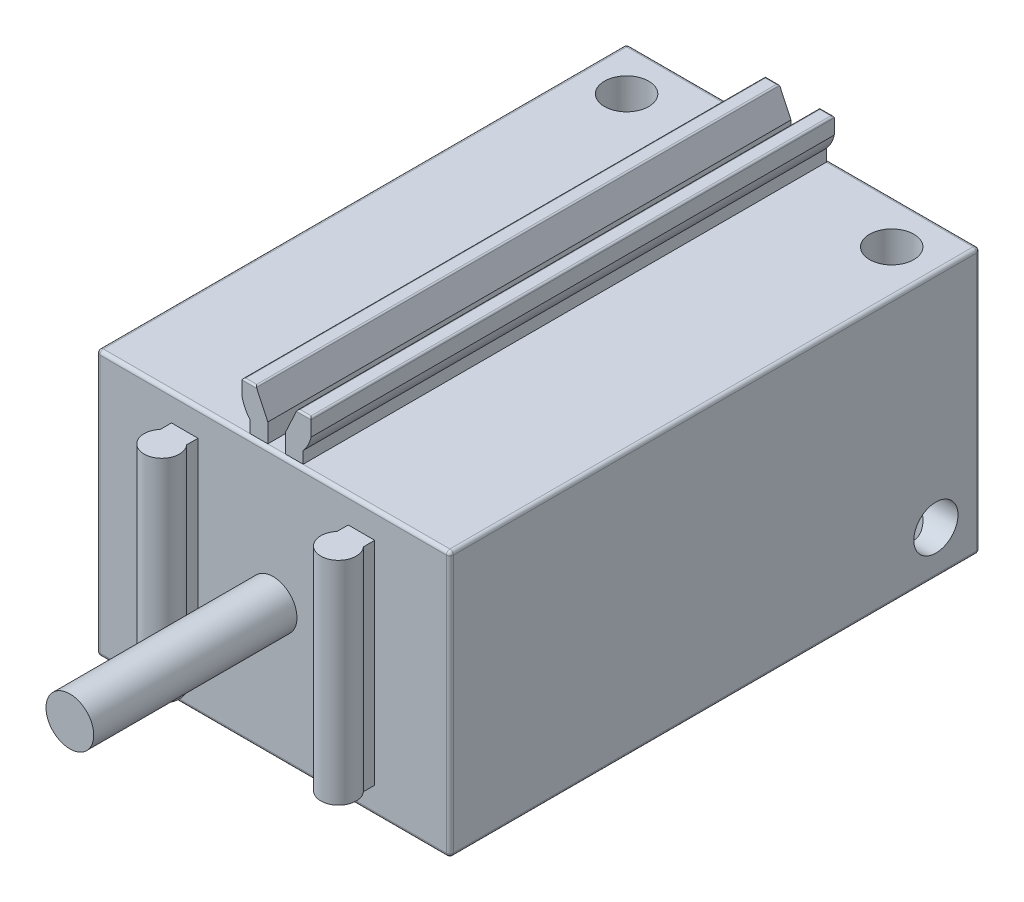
ISO-10303-21;
HEADER;
FILE_DESCRIPTION(('STEP AP214'),'2;1');
FILE_NAME('part.step','',(''),(''),'','','');
FILE_SCHEMA(('AUTOMOTIVE_DESIGN { 1 0 10303 214 1 1 1 1 }'));
ENDSEC;
DATA;
#1=APPLICATION_CONTEXT('core data for automotive mechanical design processes');
#2=APPLICATION_PROTOCOL_DEFINITION('international standard','automotive_design',2000,#1);
#3=PRODUCT_CONTEXT('',#1,'mechanical');
#4=PRODUCT('Part','Part','',(#3));
#5=PRODUCT_RELATED_PRODUCT_CATEGORY('part','',(#4));
#6=PRODUCT_DEFINITION_FORMATION('','',#4);
#7=PRODUCT_DEFINITION_CONTEXT('part definition',#1,'design');
#8=PRODUCT_DEFINITION('design','',#6,#7);
#9=PRODUCT_DEFINITION_SHAPE('','',#8);
#10=(LENGTH_UNIT() NAMED_UNIT(*) SI_UNIT(.MILLI.,.METRE.));
#11=(NAMED_UNIT(*) PLANE_ANGLE_UNIT() SI_UNIT($,.RADIAN.));
#12=(NAMED_UNIT(*) SI_UNIT($,.STERADIAN.) SOLID_ANGLE_UNIT());
#13=UNCERTAINTY_MEASURE_WITH_UNIT(LENGTH_MEASURE(1.E-05),#10,'distance_accuracy_value','');
#14=(GEOMETRIC_REPRESENTATION_CONTEXT(3) GLOBAL_UNCERTAINTY_ASSIGNED_CONTEXT((#13)) GLOBAL_UNIT_ASSIGNED_CONTEXT((#10,
#11,#12)) REPRESENTATION_CONTEXT('',''));
#15=CARTESIAN_POINT('',(0.,0.,0.));
#16=DIRECTION('',(0.,0.,1.));
#17=DIRECTION('',(1.,0.,0.));
#18=AXIS2_PLACEMENT_3D('',#15,#16,#17);
#19=CARTESIAN_POINT('',(1.95,-7.3,-32.5));
#20=DIRECTION('',(1.,0.,0.));
#21=DIRECTION('',(0.,0.,-1.));
#22=AXIS2_PLACEMENT_3D('',#19,#20,#21);
#23=PLANE('',#22);
#24=DIRECTION('',(0.,1.,0.));
#25=VECTOR('',#24,1.);
#26=CARTESIAN_POINT('',(1.95,-7.3,-32.4));
#27=LINE('',#26,#25);
#28=CARTESIAN_POINT('',(1.95,-1.85,-32.4));
#29=VERTEX_POINT('',#28);
#30=CARTESIAN_POINT('',(1.95,1.85,-32.4));
#31=VERTEX_POINT('',#30);
#32=EDGE_CURVE('E679',#29,#31,#27,.T.);
#33=ORIENTED_EDGE('',*,*,#32,.T.);
#34=DIRECTION('',(0.,0.,1.));
#35=VECTOR('',#34,1.);
#36=CARTESIAN_POINT('',(1.95,1.85,-32.5));
#37=LINE('',#36,#35);
#38=CARTESIAN_POINT('',(1.95,1.85,-31.5555902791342));
#39=VERTEX_POINT('',#38);
#40=EDGE_CURVE('E845',#31,#39,#37,.T.);
#41=ORIENTED_EDGE('',*,*,#40,.T.);
#42=DIRECTION('',(0.,1.,0.));
#43=VECTOR('',#42,1.);
#44=CARTESIAN_POINT('',(1.95,-7.3,-31.5555902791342));
#45=LINE('',#44,#43);
#46=CARTESIAN_POINT('',(1.95,-1.85,-31.5555902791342));
#47=VERTEX_POINT('',#46);
#48=EDGE_CURVE('E453',#47,#39,#45,.T.);
#49=ORIENTED_EDGE('',*,*,#48,.F.);
#50=DIRECTION('',(0.,0.,-1.));
#51=VECTOR('',#50,1.);
#52=CARTESIAN_POINT('',(1.95,-1.85,-32.5));
#53=LINE('',#52,#51);
#54=EDGE_CURVE('E842',#47,#29,#53,.T.);
#55=ORIENTED_EDGE('',*,*,#54,.T.);
#56=EDGE_LOOP('',(#33,#41,#49,#55));
#57=FACE_BOUND('',#56,.T.);
#58=ADVANCED_FACE('F43',(#57),#23,.T.);
#59=CARTESIAN_POINT('',(0.,-7.3,-32.));
#60=DIRECTION('',(0.,1.,0.));
#61=DIRECTION('',(0.,0.,1.));
#62=AXIS2_PLACEMENT_3D('',#59,#60,#61);
#63=CYLINDRICAL_SURFACE('',#62,2.);
#64=ORIENTED_EDGE('',*,*,#48,.T.);
#65=CARTESIAN_POINT('',(1.95,1.85,-31.5555902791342));
#66=CARTESIAN_POINT('',(1.95000087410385,1.85137313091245,-31.5555942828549));
#67=CARTESIAN_POINT('',(1.9499717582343,1.85274057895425,-31.5554663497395));
#68=CARTESIAN_POINT('',(1.94986189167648,1.85541503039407,-31.5549846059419));
#69=CARTESIAN_POINT('',(1.94978183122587,1.85672259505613,-31.5546338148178));
#70=CARTESIAN_POINT('',(1.94954500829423,1.85967848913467,-31.5535981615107));
#71=CARTESIAN_POINT('',(1.94937179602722,1.86129990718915,-31.5528418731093));
#72=CARTESIAN_POINT('',(1.94896916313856,1.86440736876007,-31.5510901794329));
#73=CARTESIAN_POINT('',(1.94873940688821,1.86589252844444,-31.5500933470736));
#74=CARTESIAN_POINT('',(1.9480329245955,1.86991458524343,-31.5470411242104));
#75=CARTESIAN_POINT('',(1.94750992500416,1.87229676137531,-31.5447957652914));
#76=CARTESIAN_POINT('',(1.94638793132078,1.87672997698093,-31.5400214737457));
#77=CARTESIAN_POINT('',(1.94578873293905,1.87878009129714,-31.5374917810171));
#78=CARTESIAN_POINT('',(1.94308276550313,1.88718935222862,-31.5261772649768));
#79=CARTESIAN_POINT('',(1.94073229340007,1.89239363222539,-31.5166201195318));
#80=CARTESIAN_POINT('',(1.93575786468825,1.90168718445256,-31.4970614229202));
#81=CARTESIAN_POINT('',(1.93313225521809,1.90576911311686,-31.4870574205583));
#82=CARTESIAN_POINT('',(1.92883953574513,1.91157256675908,-31.471215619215));
#83=CARTESIAN_POINT('',(1.92725103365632,1.91354960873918,-31.4654541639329));
#84=CARTESIAN_POINT('',(1.92402195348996,1.91728038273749,-31.4539458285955));
#85=CARTESIAN_POINT('',(1.92238210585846,1.91903625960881,-31.4481994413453));
#86=CARTESIAN_POINT('',(1.92071067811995,1.92071067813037,-31.4424423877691));
#87=B_SPLINE_CURVE_WITH_KNOTS('',3,(#65,#66,#67,#68,#69,#70,#71,#72,#73,#74,#75,#76,#77,#78,#79,
#80,#81,#82,#83,#84,#85,#86),.UNSPECIFIED.,.F.,.F.,(4,2,2,2,2,2,2,2,2,2,4),(0.,
0.00410397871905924,0.00815350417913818,0.0135155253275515,0.0189101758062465,
0.0287996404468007,0.0387162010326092,0.0718607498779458,0.105217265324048,0.124095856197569,
0.142774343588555),.UNSPECIFIED.);
#88=CARTESIAN_POINT('',(1.92071067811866,1.92071067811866,-31.4424423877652));
#89=VERTEX_POINT('',#88);
#90=EDGE_CURVE('E856',#39,#89,#87,.T.);
#91=ORIENTED_EDGE('',*,*,#90,.T.);
#92=CARTESIAN_POINT('',(0.,0.,-32.));
#93=DIRECTION('',(-0.707106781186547,0.707106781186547,0.));
#94=DIRECTION('',(0.707106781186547,0.707106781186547,0.));
#95=AXIS2_PLACEMENT_3D('',#92,#93,#94);
#96=ELLIPSE('',#95,2.82842712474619,2.);
#97=CARTESIAN_POINT('',(1.5,1.5,-30.6771243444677));
#98=VERTEX_POINT('',#97);
#99=EDGE_CURVE('E2182',#89,#98,#96,.F.);
#100=ORIENTED_EDGE('',*,*,#99,.T.);
#101=DIRECTION('',(0.,1.,0.));
#102=VECTOR('',#101,1.);
#103=CARTESIAN_POINT('',(1.5,-7.3,-30.6771243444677));
#104=LINE('',#103,#102);
#105=CARTESIAN_POINT('',(1.5,-1.5,-30.6771243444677));
#106=VERTEX_POINT('',#105);
#107=EDGE_CURVE('E451',#106,#98,#104,.T.);
#108=ORIENTED_EDGE('',*,*,#107,.F.);
#109=CARTESIAN_POINT('',(0.,0.,-32.));
#110=DIRECTION('',(0.707106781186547,0.707106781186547,0.));
#111=DIRECTION('',(-0.707106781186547,0.707106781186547,0.));
#112=AXIS2_PLACEMENT_3D('',#109,#110,#111);
#113=ELLIPSE('',#112,2.82842712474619,2.);
#114=CARTESIAN_POINT('',(1.92071067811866,-1.92071067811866,-31.4424423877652));
#115=VERTEX_POINT('',#114);
#116=EDGE_CURVE('E2155',#106,#115,#113,.T.);
#117=ORIENTED_EDGE('',*,*,#116,.T.);
#118=CARTESIAN_POINT('',(1.92071067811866,-1.92071067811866,-31.4424423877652));
#119=CARTESIAN_POINT('',(1.92290953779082,-1.91850108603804,-31.4500152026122));
#120=CARTESIAN_POINT('',(1.92505450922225,-1.91615972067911,-31.4575734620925));
#121=CARTESIAN_POINT('',(1.92925195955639,-1.91107835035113,-31.4726968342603));
#122=CARTESIAN_POINT('',(1.93130287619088,-1.90833356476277,-31.4802607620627));
#123=CARTESIAN_POINT('',(1.9353484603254,-1.90224375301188,-31.4955285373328));
#124=CARTESIAN_POINT('',(1.93733766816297,-1.89887923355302,-31.5032260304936));
#125=CARTESIAN_POINT('',(1.9411315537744,-1.89139107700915,-31.518266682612));
#126=CARTESIAN_POINT('',(1.94293731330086,-1.8872723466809,-31.5256117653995));
#127=CARTESIAN_POINT('',(1.94508258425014,-1.88100730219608,-31.5345343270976));
#128=CARTESIAN_POINT('',(1.94555904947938,-1.87951485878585,-31.5365304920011));
#129=CARTESIAN_POINT('',(1.94647721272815,-1.87636066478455,-31.5404019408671));
#130=CARTESIAN_POINT('',(1.9469188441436,-1.87469860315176,-31.5422769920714));
#131=CARTESIAN_POINT('',(1.94775741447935,-1.87113975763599,-31.5458585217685));
#132=CARTESIAN_POINT('',(1.94815365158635,-1.86924004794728,-31.5475623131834));
#133=CARTESIAN_POINT('',(1.94886384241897,-1.86517081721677,-31.5506313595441));
#134=CARTESIAN_POINT('',(1.94917824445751,-1.86300286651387,-31.5519984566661));
#135=CARTESIAN_POINT('',(1.94956155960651,-1.8594385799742,-31.5536704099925));
#136=CARTESIAN_POINT('',(1.94967700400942,-1.85814223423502,-31.5541752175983));
#137=CARTESIAN_POINT('',(1.94985833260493,-1.85548309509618,-31.5549689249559));
#138=CARTESIAN_POINT('',(1.94992436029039,-1.85412050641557,-31.555258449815));
#139=CARTESIAN_POINT('',(1.94998747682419,-1.85183326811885,-31.55553533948));
#140=CARTESIAN_POINT('',(1.95000035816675,-1.85091695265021,-31.5555919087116));
#141=CARTESIAN_POINT('',(1.95,-1.85,-31.5555902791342));
#142=B_SPLINE_CURVE_WITH_KNOTS('',3,(#118,#119,#120,#121,#122,#123,#124,#125,#126,#127,#128,
#129,#130,#131,#132,#133,#134,#135,#136,#137,#138,#139,#140,#141),.UNSPECIFIED.,.F.,.F.,(4,2,2,
2,2,2,2,2,2,2,2,4),(0.,0.0245793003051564,0.0494776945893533,0.0753638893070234,
0.101087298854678,0.108693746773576,0.116314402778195,0.124040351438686,0.131723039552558,
0.135895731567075,0.140056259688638,0.142804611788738),.UNSPECIFIED.);
#143=EDGE_CURVE('E848',#115,#47,#142,.T.);
#144=ORIENTED_EDGE('',*,*,#143,.T.);
#145=EDGE_LOOP('',(#64,#91,#100,#108,#117,#144));
#146=FACE_BOUND('',#145,.T.);
#147=ADVANCED_FACE('F863',(#146),#63,.T.);
#148=CARTESIAN_POINT('',(1.5,-7.3,-30.));
#149=DIRECTION('',(1.,0.,0.));
#150=DIRECTION('',(0.,0.,-1.));
#151=AXIS2_PLACEMENT_3D('',#148,#149,#150);
#152=PLANE('',#151);
#153=DIRECTION('',(0.,1.,0.));
#154=VECTOR('',#153,1.);
#155=CARTESIAN_POINT('',(1.5,-7.3,-30.));
#156=LINE('',#155,#154);
#157=CARTESIAN_POINT('',(1.5,-1.5,-30.));
#158=VERTEX_POINT('',#157);
#159=CARTESIAN_POINT('',(1.5,1.5,-30.));
#160=VERTEX_POINT('',#159);
#161=EDGE_CURVE('E442',#158,#160,#156,.T.);
#162=ORIENTED_EDGE('',*,*,#161,.F.);
#163=DIRECTION('',(0.,0.,-1.));
#164=VECTOR('',#163,1.);
#165=CARTESIAN_POINT('',(1.5,-1.5,-30.));
#166=LINE('',#165,#164);
#167=EDGE_CURVE('E422',#158,#106,#166,.T.);
#168=ORIENTED_EDGE('',*,*,#167,.T.);
#169=ORIENTED_EDGE('',*,*,#107,.T.);
#170=DIRECTION('',(0.,0.,1.));
#171=VECTOR('',#170,1.);
#172=CARTESIAN_POINT('',(1.5,1.5,-30.));
#173=LINE('',#172,#171);
#174=EDGE_CURVE('E450',#98,#160,#173,.T.);
#175=ORIENTED_EDGE('',*,*,#174,.T.);
#176=EDGE_LOOP('',(#162,#168,#169,#175));
#177=FACE_BOUND('',#176,.T.);
#178=ADVANCED_FACE('F448',(#177),#152,.T.);
#179=CARTESIAN_POINT('',(-1.5,-7.3,-30.));
#180=DIRECTION('',(-1.,0.,0.));
#181=DIRECTION('',(0.,0.,1.));
#182=AXIS2_PLACEMENT_3D('',#179,#180,#181);
#183=PLANE('',#182);
#184=DIRECTION('',(0.,1.,0.));
#185=VECTOR('',#184,1.);
#186=CARTESIAN_POINT('',(-1.5,-7.3,-30.6771243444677));
#187=LINE('',#186,#185);
#188=CARTESIAN_POINT('',(-1.5,-1.5,-30.6771243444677));
#189=VERTEX_POINT('',#188);
#190=CARTESIAN_POINT('',(-1.5,1.5,-30.6771243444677));
#191=VERTEX_POINT('',#190);
#192=EDGE_CURVE('E455',#189,#191,#187,.T.);
#193=ORIENTED_EDGE('',*,*,#192,.F.);
#194=DIRECTION('',(0.,0.,1.));
#195=VECTOR('',#194,1.);
#196=CARTESIAN_POINT('',(-1.5,-1.5,-30.));
#197=LINE('',#196,#195);
#198=CARTESIAN_POINT('',(-1.5,-1.5,-30.));
#199=VERTEX_POINT('',#198);
#200=EDGE_CURVE('E435',#189,#199,#197,.T.);
#201=ORIENTED_EDGE('',*,*,#200,.T.);
#202=DIRECTION('',(0.,1.,0.));
#203=VECTOR('',#202,1.);
#204=CARTESIAN_POINT('',(-1.5,-7.3,-30.));
#205=LINE('',#204,#203);
#206=CARTESIAN_POINT('',(-1.5,1.5,-30.));
#207=VERTEX_POINT('',#206);
#208=EDGE_CURVE('E444',#199,#207,#205,.T.);
#209=ORIENTED_EDGE('',*,*,#208,.T.);
#210=DIRECTION('',(0.,0.,-1.));
#211=VECTOR('',#210,1.);
#212=CARTESIAN_POINT('',(-1.5,1.5,-30.));
#213=LINE('',#212,#211);
#214=EDGE_CURVE('E2180',#207,#191,#213,.T.);
#215=ORIENTED_EDGE('',*,*,#214,.T.);
#216=EDGE_LOOP('',(#193,#201,#209,#215));
#217=FACE_BOUND('',#216,.T.);
#218=ADVANCED_FACE('F1117',(#217),#183,.T.);
#219=CARTESIAN_POINT('',(0.,-7.3,-32.));
#220=DIRECTION('',(0.,1.,0.));
#221=DIRECTION('',(0.,0.,1.));
#222=AXIS2_PLACEMENT_3D('',#219,#220,#221);
#223=CYLINDRICAL_SURFACE('',#222,2.);
#224=CARTESIAN_POINT('',(0.,0.,-32.));
#225=DIRECTION('',(0.707106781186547,0.707106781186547,0.));
#226=DIRECTION('',(-0.707106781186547,0.707106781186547,0.));
#227=AXIS2_PLACEMENT_3D('',#224,#225,#226);
#228=ELLIPSE('',#227,2.82842712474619,2.);
#229=CARTESIAN_POINT('',(-1.92071067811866,1.92071067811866,-31.4424423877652));
#230=VERTEX_POINT('',#229);
#231=EDGE_CURVE('E2183',#191,#230,#228,.F.);
#232=ORIENTED_EDGE('',*,*,#231,.T.);
#233=CARTESIAN_POINT('',(-1.92071067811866,1.92071067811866,-31.4424423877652));
#234=CARTESIAN_POINT('',(-1.92290953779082,1.91850108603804,-31.4500152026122));
#235=CARTESIAN_POINT('',(-1.92505450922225,1.91615972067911,-31.4575734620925));
#236=CARTESIAN_POINT('',(-1.92925195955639,1.91107835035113,-31.4726968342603));
#237=CARTESIAN_POINT('',(-1.93130287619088,1.90833356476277,-31.4802607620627));
#238=CARTESIAN_POINT('',(-1.9353484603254,1.90224375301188,-31.4955285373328));
#239=CARTESIAN_POINT('',(-1.93733766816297,1.89887923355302,-31.5032260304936));
#240=CARTESIAN_POINT('',(-1.9411315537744,1.89139107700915,-31.518266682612));
#241=CARTESIAN_POINT('',(-1.94293731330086,1.8872723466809,-31.5256117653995));
#242=CARTESIAN_POINT('',(-1.94508258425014,1.88100730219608,-31.5345343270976));
#243=CARTESIAN_POINT('',(-1.94555904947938,1.87951485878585,-31.5365304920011));
#244=CARTESIAN_POINT('',(-1.94647721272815,1.87636066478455,-31.5404019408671));
#245=CARTESIAN_POINT('',(-1.9469188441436,1.87469860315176,-31.5422769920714));
#246=CARTESIAN_POINT('',(-1.94775741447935,1.87113975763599,-31.5458585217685));
#247=CARTESIAN_POINT('',(-1.94815365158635,1.86924004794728,-31.5475623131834));
#248=CARTESIAN_POINT('',(-1.94886384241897,1.86517081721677,-31.5506313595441));
#249=CARTESIAN_POINT('',(-1.94917824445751,1.86300286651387,-31.5519984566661));
#250=CARTESIAN_POINT('',(-1.94956155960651,1.8594385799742,-31.5536704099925));
#251=CARTESIAN_POINT('',(-1.94967700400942,1.85814223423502,-31.5541752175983));
#252=CARTESIAN_POINT('',(-1.94985833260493,1.85548309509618,-31.5549689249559));
#253=CARTESIAN_POINT('',(-1.94992436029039,1.85412050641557,-31.555258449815));
#254=CARTESIAN_POINT('',(-1.94998747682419,1.85183326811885,-31.55553533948));
#255=CARTESIAN_POINT('',(-1.95000035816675,1.85091695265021,-31.5555919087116));
#256=CARTESIAN_POINT('',(-1.95,1.85,-31.5555902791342));
#257=B_SPLINE_CURVE_WITH_KNOTS('',3,(#233,#234,#235,#236,#237,#238,#239,#240,#241,#242,#243,
#244,#245,#246,#247,#248,#249,#250,#251,#252,#253,#254,#255,#256),.UNSPECIFIED.,.F.,.F.,(4,2,2,
2,2,2,2,2,2,2,2,4),(0.,0.0245793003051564,0.0494776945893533,0.0753638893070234,
0.101087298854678,0.108693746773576,0.116314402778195,0.124040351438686,0.131723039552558,
0.135895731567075,0.140056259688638,0.142804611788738),.UNSPECIFIED.);
#258=CARTESIAN_POINT('',(-1.95,1.85,-31.5555902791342));
#259=VERTEX_POINT('',#258);
#260=EDGE_CURVE('E1105',#230,#259,#257,.T.);
#261=ORIENTED_EDGE('',*,*,#260,.T.);
#262=DIRECTION('',(0.,1.,0.));
#263=VECTOR('',#262,1.);
#264=CARTESIAN_POINT('',(-1.95,-7.3,-31.5555902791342));
#265=LINE('',#264,#263);
#266=CARTESIAN_POINT('',(-1.95,-1.85,-31.5555902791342));
#267=VERTEX_POINT('',#266);
#268=EDGE_CURVE('E460',#267,#259,#265,.T.);
#269=ORIENTED_EDGE('',*,*,#268,.F.);
#270=CARTESIAN_POINT('',(-1.95,-1.85,-31.5555902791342));
#271=CARTESIAN_POINT('',(-1.95000087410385,-1.85137313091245,-31.5555942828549));
#272=CARTESIAN_POINT('',(-1.9499717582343,-1.85274057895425,-31.5554663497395));
#273=CARTESIAN_POINT('',(-1.94986189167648,-1.85541503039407,-31.5549846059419));
#274=CARTESIAN_POINT('',(-1.94978183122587,-1.85672259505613,-31.5546338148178));
#275=CARTESIAN_POINT('',(-1.94954500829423,-1.85967848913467,-31.5535981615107));
#276=CARTESIAN_POINT('',(-1.94937179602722,-1.86129990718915,-31.5528418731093));
#277=CARTESIAN_POINT('',(-1.94896916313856,-1.86440736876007,-31.5510901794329));
#278=CARTESIAN_POINT('',(-1.94873940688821,-1.86589252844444,-31.5500933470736));
#279=CARTESIAN_POINT('',(-1.9480329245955,-1.86991458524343,-31.5470411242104));
#280=CARTESIAN_POINT('',(-1.94750992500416,-1.87229676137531,-31.5447957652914));
#281=CARTESIAN_POINT('',(-1.94638793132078,-1.87672997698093,-31.5400214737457));
#282=CARTESIAN_POINT('',(-1.94578873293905,-1.87878009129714,-31.5374917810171));
#283=CARTESIAN_POINT('',(-1.94308276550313,-1.88718935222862,-31.5261772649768));
#284=CARTESIAN_POINT('',(-1.94073229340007,-1.89239363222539,-31.5166201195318));
#285=CARTESIAN_POINT('',(-1.93575786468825,-1.90168718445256,-31.4970614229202));
#286=CARTESIAN_POINT('',(-1.93313225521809,-1.90576911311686,-31.4870574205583));
#287=CARTESIAN_POINT('',(-1.92883953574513,-1.91157256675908,-31.471215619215));
#288=CARTESIAN_POINT('',(-1.92725103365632,-1.91354960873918,-31.4654541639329));
#289=CARTESIAN_POINT('',(-1.92402195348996,-1.91728038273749,-31.4539458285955));
#290=CARTESIAN_POINT('',(-1.92238210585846,-1.91903625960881,-31.4481994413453));
#291=CARTESIAN_POINT('',(-1.92071067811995,-1.92071067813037,-31.4424423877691));
#292=B_SPLINE_CURVE_WITH_KNOTS('',3,(#270,#271,#272,#273,#274,#275,#276,#277,#278,#279,#280,
#281,#282,#283,#284,#285,#286,#287,#288,#289,#290,#291),.UNSPECIFIED.,.F.,.F.,(4,2,2,2,2,2,2,2,
2,2,4),(0.,0.00410397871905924,0.00815350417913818,0.0135155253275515,0.0189101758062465,
0.0287996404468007,0.0387162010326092,0.0718607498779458,0.105217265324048,0.124095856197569,
0.142774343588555),.UNSPECIFIED.);
#293=CARTESIAN_POINT('',(-1.92071067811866,-1.92071067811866,-31.4424423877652));
#294=VERTEX_POINT('',#293);
#295=EDGE_CURVE('E1098',#267,#294,#292,.T.);
#296=ORIENTED_EDGE('',*,*,#295,.T.);
#297=CARTESIAN_POINT('',(0.,0.,-32.));
#298=DIRECTION('',(-0.707106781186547,0.707106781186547,0.));
#299=DIRECTION('',(0.707106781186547,0.707106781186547,0.));
#300=AXIS2_PLACEMENT_3D('',#297,#298,#299);
#301=ELLIPSE('',#300,2.82842712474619,2.);
#302=EDGE_CURVE('E434',#294,#189,#301,.T.);
#303=ORIENTED_EDGE('',*,*,#302,.T.);
#304=ORIENTED_EDGE('',*,*,#192,.T.);
#305=EDGE_LOOP('',(#232,#261,#269,#296,#303,#304));
#306=FACE_BOUND('',#305,.T.);
#307=ADVANCED_FACE('F1111',(#306),#223,.T.);
#308=CARTESIAN_POINT('',(-1.95,-7.3,-32.5));
#309=DIRECTION('',(-1.,0.,0.));
#310=DIRECTION('',(0.,0.,1.));
#311=AXIS2_PLACEMENT_3D('',#308,#309,#310);
#312=PLANE('',#311);
#313=ORIENTED_EDGE('',*,*,#268,.T.);
#314=DIRECTION('',(0.,0.,-1.));
#315=VECTOR('',#314,1.);
#316=CARTESIAN_POINT('',(-1.95,1.85,-32.5));
#317=LINE('',#316,#315);
#318=CARTESIAN_POINT('',(-1.95,1.85,-32.4));
#319=VERTEX_POINT('',#318);
#320=EDGE_CURVE('E1096',#259,#319,#317,.T.);
#321=ORIENTED_EDGE('',*,*,#320,.T.);
#322=DIRECTION('',(0.,1.,0.));
#323=VECTOR('',#322,1.);
#324=CARTESIAN_POINT('',(-1.95,-7.3,-32.4));
#325=LINE('',#324,#323);
#326=CARTESIAN_POINT('',(-1.95,-1.85,-32.4));
#327=VERTEX_POINT('',#326);
#328=EDGE_CURVE('E676',#319,#327,#325,.F.);
#329=ORIENTED_EDGE('',*,*,#328,.T.);
#330=DIRECTION('',(0.,0.,1.));
#331=VECTOR('',#330,1.);
#332=CARTESIAN_POINT('',(-1.95,-1.85,-32.5));
#333=LINE('',#332,#331);
#334=EDGE_CURVE('E1090',#327,#267,#333,.T.);
#335=ORIENTED_EDGE('',*,*,#334,.T.);
#336=EDGE_LOOP('',(#313,#321,#329,#335));
#337=FACE_BOUND('',#336,.T.);
#338=ADVANCED_FACE('F1116',(#337),#312,.T.);
#339=CARTESIAN_POINT('',(-1.95,-7.3,-32.5));
#340=DIRECTION('',(0.,0.,-1.));
#341=DIRECTION('',(-1.,0.,0.));
#342=AXIS2_PLACEMENT_3D('',#339,#340,#341);
#343=PLANE('',#342);
#344=DIRECTION('',(0.,1.,0.));
#345=VECTOR('',#344,1.);
#346=CARTESIAN_POINT('',(-1.85,-7.3,-32.5));
#347=LINE('',#346,#345);
#348=CARTESIAN_POINT('',(-1.85,-1.85,-32.5));
#349=VERTEX_POINT('',#348);
#350=CARTESIAN_POINT('',(-1.85,1.85,-32.5));
#351=VERTEX_POINT('',#350);
#352=EDGE_CURVE('E673',#349,#351,#347,.T.);
#353=ORIENTED_EDGE('',*,*,#352,.T.);
#354=DIRECTION('',(-1.,0.,0.));
#355=VECTOR('',#354,1.);
#356=CARTESIAN_POINT('',(-1.95,1.85,-32.5));
#357=LINE('',#356,#355);
#358=CARTESIAN_POINT('',(1.85,1.85,-32.5));
#359=VERTEX_POINT('',#358);
#360=EDGE_CURVE('E11',#351,#359,#357,.F.);
#361=ORIENTED_EDGE('',*,*,#360,.T.);
#362=DIRECTION('',(0.,1.,0.));
#363=VECTOR('',#362,1.);
#364=CARTESIAN_POINT('',(1.85,-7.3,-32.5));
#365=LINE('',#364,#363);
#366=CARTESIAN_POINT('',(1.85,-1.85,-32.5));
#367=VERTEX_POINT('',#366);
#368=EDGE_CURVE('E670',#359,#367,#365,.F.);
#369=ORIENTED_EDGE('',*,*,#368,.T.);
#370=DIRECTION('',(-1.,0.,0.));
#371=VECTOR('',#370,1.);
#372=CARTESIAN_POINT('',(-1.95,-1.85,-32.5));
#373=LINE('',#372,#371);
#374=EDGE_CURVE('E53',#367,#349,#373,.T.);
#375=ORIENTED_EDGE('',*,*,#374,.T.);
#376=EDGE_LOOP('',(#353,#361,#369,#375));
#377=FACE_BOUND('',#376,.T.);
#378=ADVANCED_FACE('F1122',(#377),#343,.T.);
#379=CARTESIAN_POINT('',(1.85,-7.3,-32.4));
#380=DIRECTION('',(0.,1.,0.));
#381=DIRECTION('',(0.,0.,1.));
#382=AXIS2_PLACEMENT_3D('',#379,#380,#381);
#383=CYLINDRICAL_SURFACE('',#382,0.1);
#384=ORIENTED_EDGE('',*,*,#368,.F.);
#385=CARTESIAN_POINT('',(1.85,1.85,-32.4));
#386=DIRECTION('',(0.,1.,0.));
#387=DIRECTION('',(0.,0.,1.));
#388=AXIS2_PLACEMENT_3D('',#385,#386,#387);
#389=CIRCLE('',#388,0.1);
#390=EDGE_CURVE('E1087',#359,#31,#389,.F.);
#391=ORIENTED_EDGE('',*,*,#390,.T.);
#392=ORIENTED_EDGE('',*,*,#32,.F.);
#393=CARTESIAN_POINT('',(1.85,-1.85,-32.4));
#394=DIRECTION('',(0.,1.,0.));
#395=DIRECTION('',(0.,0.,1.));
#396=AXIS2_PLACEMENT_3D('',#393,#394,#395);
#397=CIRCLE('',#396,0.1);
#398=EDGE_CURVE('E1084',#29,#367,#397,.T.);
#399=ORIENTED_EDGE('',*,*,#398,.T.);
#400=EDGE_LOOP('',(#384,#391,#392,#399));
#401=FACE_BOUND('',#400,.T.);
#402=ADVANCED_FACE('F1126',(#401),#383,.T.);
#403=CARTESIAN_POINT('',(-1.85,-7.3,-32.4));
#404=DIRECTION('',(0.,1.,0.));
#405=DIRECTION('',(0.,0.,1.));
#406=AXIS2_PLACEMENT_3D('',#403,#404,#405);
#407=CYLINDRICAL_SURFACE('',#406,0.1);
#408=ORIENTED_EDGE('',*,*,#328,.F.);
#409=CARTESIAN_POINT('',(-1.85,1.85,-32.4));
#410=DIRECTION('',(0.,1.,0.));
#411=DIRECTION('',(0.,0.,1.));
#412=AXIS2_PLACEMENT_3D('',#409,#410,#411);
#413=CIRCLE('',#412,0.1);
#414=EDGE_CURVE('E2161',#319,#351,#413,.F.);
#415=ORIENTED_EDGE('',*,*,#414,.T.);
#416=ORIENTED_EDGE('',*,*,#352,.F.);
#417=CARTESIAN_POINT('',(-1.85,-1.85,-32.4));
#418=DIRECTION('',(0.,1.,0.));
#419=DIRECTION('',(0.,0.,1.));
#420=AXIS2_PLACEMENT_3D('',#417,#418,#419);
#421=CIRCLE('',#420,0.1);
#422=EDGE_CURVE('E2160',#349,#327,#421,.T.);
#423=ORIENTED_EDGE('',*,*,#422,.T.);
#424=EDGE_LOOP('',(#408,#415,#416,#423));
#425=FACE_BOUND('',#424,.T.);
#426=ADVANCED_FACE('F1296',(#425),#407,.T.);
#427=CARTESIAN_POINT('',(-7.5,-7.5,-27.5));
#428=DIRECTION('',(0.,1.,0.));
#429=DIRECTION('',(0.,0.,1.));
#430=AXIS2_PLACEMENT_3D('',#427,#428,#429);
#431=CYLINDRICAL_SURFACE('',#430,1.25);
#432=CARTESIAN_POINT('',(-7.5,7.5,-27.5));
#433=DIRECTION('',(0.,1.,0.));
#434=DIRECTION('',(0.,0.,1.));
#435=AXIS2_PLACEMENT_3D('',#432,#433,#434);
#436=CIRCLE('',#435,1.25);
#437=CARTESIAN_POINT('',(-7.5,7.5,-26.25));
#438=VERTEX_POINT('',#437);
#439=EDGE_CURVE('E1058',#438,#438,#436,.T.);
#440=ORIENTED_EDGE('',*,*,#439,.T.);
#441=EDGE_LOOP('',(#440));
#442=FACE_BOUND('',#441,.T.);
#443=CARTESIAN_POINT('',(-7.5,0.,-27.5));
#444=DIRECTION('',(0.,0.707106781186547,0.707106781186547));
#445=DIRECTION('',(0.,0.707106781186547,-0.707106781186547));
#446=AXIS2_PLACEMENT_3D('',#443,#444,#445);
#447=ELLIPSE('',#446,1.76776695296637,1.25);
#448=CARTESIAN_POINT('',(-8.75,0.,-27.5));
#449=VERTEX_POINT('',#448);
#450=CARTESIAN_POINT('',(-6.25,0.,-27.5));
#451=VERTEX_POINT('',#450);
#452=EDGE_CURVE('E1002',#449,#451,#447,.F.);
#453=ORIENTED_EDGE('',*,*,#452,.T.);
#454=CARTESIAN_POINT('',(-7.5,0.,-27.5));
#455=DIRECTION('',(0.,0.707106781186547,-0.707106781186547));
#456=DIRECTION('',(0.,0.707106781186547,0.707106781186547));
#457=AXIS2_PLACEMENT_3D('',#454,#455,#456);
#458=ELLIPSE('',#457,1.76776695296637,1.25);
#459=EDGE_CURVE('E1017',#451,#449,#458,.F.);
#460=ORIENTED_EDGE('',*,*,#459,.T.);
#461=EDGE_LOOP('',(#453,#460));
#462=FACE_BOUND('',#461,.T.);
#463=ADVANCED_FACE('F966',(#442,#462),#431,.F.);
#464=CARTESIAN_POINT('',(7.5,-7.5,-27.5));
#465=DIRECTION('',(0.,1.,0.));
#466=DIRECTION('',(0.,0.,1.));
#467=AXIS2_PLACEMENT_3D('',#464,#465,#466);
#468=CYLINDRICAL_SURFACE('',#467,1.25);
#469=CARTESIAN_POINT('',(7.5,7.5,-27.5));
#470=DIRECTION('',(0.,1.,0.));
#471=DIRECTION('',(0.,0.,1.));
#472=AXIS2_PLACEMENT_3D('',#469,#470,#471);
#473=CIRCLE('',#472,1.25);
#474=CARTESIAN_POINT('',(7.5,7.5,-26.25));
#475=VERTEX_POINT('',#474);
#476=EDGE_CURVE('E1054',#475,#475,#473,.T.);
#477=ORIENTED_EDGE('',*,*,#476,.T.);
#478=EDGE_LOOP('',(#477));
#479=FACE_BOUND('',#478,.T.);
#480=CARTESIAN_POINT('',(7.5,0.,-27.5));
#481=DIRECTION('',(0.,0.707106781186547,0.707106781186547));
#482=DIRECTION('',(0.,0.707106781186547,-0.707106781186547));
#483=AXIS2_PLACEMENT_3D('',#480,#481,#482);
#484=ELLIPSE('',#483,1.76776695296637,1.25);
#485=CARTESIAN_POINT('',(6.25,0.,-27.5));
#486=VERTEX_POINT('',#485);
#487=CARTESIAN_POINT('',(8.75,0.,-27.5));
#488=VERTEX_POINT('',#487);
#489=EDGE_CURVE('E1024',#486,#488,#484,.F.);
#490=ORIENTED_EDGE('',*,*,#489,.T.);
#491=CARTESIAN_POINT('',(7.5,0.,-27.5));
#492=DIRECTION('',(0.,0.707106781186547,-0.707106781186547));
#493=DIRECTION('',(0.,0.707106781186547,0.707106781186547));
#494=AXIS2_PLACEMENT_3D('',#491,#492,#493);
#495=ELLIPSE('',#494,1.76776695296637,1.25);
#496=EDGE_CURVE('E1034',#488,#486,#495,.F.);
#497=ORIENTED_EDGE('',*,*,#496,.T.);
#498=EDGE_LOOP('',(#490,#497));
#499=FACE_BOUND('',#498,.T.);
#500=ADVANCED_FACE('F972',(#479,#499),#468,.F.);
#501=CARTESIAN_POINT('',(-7.5,0.,-27.5));
#502=DIRECTION('',(0.,0.707106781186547,0.707106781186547));
#503=DIRECTION('',(0.,0.707106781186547,-0.707106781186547));
#504=AXIS2_PLACEMENT_3D('',#501,#502,#503);
#505=ELLIPSE('',#504,1.76776695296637,1.25);
#506=EDGE_CURVE('E1005',#449,#451,#505,.T.);
#507=ORIENTED_EDGE('',*,*,#506,.T.);
#508=CARTESIAN_POINT('',(-7.5,0.,-27.5));
#509=DIRECTION('',(0.,0.707106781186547,-0.707106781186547));
#510=DIRECTION('',(0.,0.707106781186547,0.707106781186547));
#511=AXIS2_PLACEMENT_3D('',#508,#509,#510);
#512=ELLIPSE('',#511,1.76776695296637,1.25);
#513=EDGE_CURVE('E1014',#451,#449,#512,.T.);
#514=ORIENTED_EDGE('',*,*,#513,.T.);
#515=EDGE_LOOP('',(#507,#514));
#516=FACE_BOUND('',#515,.T.);
#517=CARTESIAN_POINT('',(-7.5,-5.,-27.5));
#518=DIRECTION('',(0.707106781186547,0.707106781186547,0.));
#519=DIRECTION('',(-0.707106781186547,0.707106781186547,0.));
#520=AXIS2_PLACEMENT_3D('',#517,#518,#519);
#521=ELLIPSE('',#520,1.76776695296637,1.25);
#522=CARTESIAN_POINT('',(-7.5,-5.,-26.25));
#523=VERTEX_POINT('',#522);
#524=CARTESIAN_POINT('',(-7.5,-5.,-28.75));
#525=VERTEX_POINT('',#524);
#526=EDGE_CURVE('E1041',#523,#525,#521,.F.);
#527=ORIENTED_EDGE('',*,*,#526,.T.);
#528=CARTESIAN_POINT('',(-7.5,-5.,-27.5));
#529=DIRECTION('',(-0.707106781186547,0.707106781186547,0.));
#530=DIRECTION('',(0.707106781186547,0.707106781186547,0.));
#531=AXIS2_PLACEMENT_3D('',#528,#529,#530);
#532=ELLIPSE('',#531,1.76776695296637,1.25);
#533=EDGE_CURVE('E1051',#525,#523,#532,.F.);
#534=ORIENTED_EDGE('',*,*,#533,.T.);
#535=EDGE_LOOP('',(#527,#534));
#536=FACE_BOUND('',#535,.T.);
#537=ADVANCED_FACE('F967',(#516,#536),#431,.F.);
#538=CARTESIAN_POINT('',(7.5,0.,-27.5));
#539=DIRECTION('',(0.,0.707106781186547,0.707106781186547));
#540=DIRECTION('',(0.,0.707106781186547,-0.707106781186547));
#541=AXIS2_PLACEMENT_3D('',#538,#539,#540);
#542=ELLIPSE('',#541,1.76776695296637,1.25);
#543=EDGE_CURVE('E1028',#486,#488,#542,.T.);
#544=ORIENTED_EDGE('',*,*,#543,.T.);
#545=CARTESIAN_POINT('',(7.5,0.,-27.5));
#546=DIRECTION('',(0.,0.707106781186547,-0.707106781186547));
#547=DIRECTION('',(0.,0.707106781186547,0.707106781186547));
#548=AXIS2_PLACEMENT_3D('',#545,#546,#547);
#549=ELLIPSE('',#548,1.76776695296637,1.25);
#550=EDGE_CURVE('E1031',#488,#486,#549,.T.);
#551=ORIENTED_EDGE('',*,*,#550,.T.);
#552=EDGE_LOOP('',(#544,#551));
#553=FACE_BOUND('',#552,.T.);
#554=CARTESIAN_POINT('',(7.5,-5.,-27.5));
#555=DIRECTION('',(0.707106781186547,0.707106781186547,0.));
#556=DIRECTION('',(-0.707106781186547,0.707106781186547,0.));
#557=AXIS2_PLACEMENT_3D('',#554,#555,#556);
#558=ELLIPSE('',#557,1.76776695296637,1.25);
#559=CARTESIAN_POINT('',(7.5,-5.,-26.25));
#560=VERTEX_POINT('',#559);
#561=CARTESIAN_POINT('',(7.5,-5.,-28.75));
#562=VERTEX_POINT('',#561);
#563=EDGE_CURVE('E763',#560,#562,#558,.F.);
#564=ORIENTED_EDGE('',*,*,#563,.T.);
#565=CARTESIAN_POINT('',(7.5,-5.,-27.5));
#566=DIRECTION('',(-0.707106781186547,0.707106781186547,0.));
#567=DIRECTION('',(0.707106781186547,0.707106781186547,0.));
#568=AXIS2_PLACEMENT_3D('',#565,#566,#567);
#569=ELLIPSE('',#568,1.76776695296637,1.25);
#570=EDGE_CURVE('E839',#562,#560,#569,.F.);
#571=ORIENTED_EDGE('',*,*,#570,.T.);
#572=EDGE_LOOP('',(#564,#571));
#573=FACE_BOUND('',#572,.T.);
#574=ADVANCED_FACE('F973',(#553,#573),#468,.F.);
#575=CARTESIAN_POINT('',(-10.,7.5,-30.));
#576=DIRECTION('',(0.,1.,0.));
#577=DIRECTION('',(0.,0.,1.));
#578=AXIS2_PLACEMENT_3D('',#575,#576,#577);
#579=PLANE('',#578);
#580=DIRECTION('',(0.,0.,1.));
#581=VECTOR('',#580,1.);
#582=CARTESIAN_POINT('',(0.5,7.5,-29.8));
#583=LINE('',#582,#581);
#584=CARTESIAN_POINT('',(0.5,7.5,-29.8));
#585=VERTEX_POINT('',#584);
#586=CARTESIAN_POINT('',(0.5,7.5,-0.199999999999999));
#587=VERTEX_POINT('',#586);
#588=EDGE_CURVE('E504',#585,#587,#583,.T.);
#589=ORIENTED_EDGE('',*,*,#588,.F.);
#590=DIRECTION('',(-1.,0.,0.));
#591=VECTOR('',#590,1.);
#592=CARTESIAN_POINT('',(-10.,7.5,-29.8));
#593=LINE('',#592,#591);
#594=CARTESIAN_POINT('',(-0.5,7.5,-29.8));
#595=VERTEX_POINT('',#594);
#596=EDGE_CURVE('E743',#585,#595,#593,.T.);
#597=ORIENTED_EDGE('',*,*,#596,.T.);
#598=DIRECTION('',(0.,0.,1.));
#599=VECTOR('',#598,1.);
#600=CARTESIAN_POINT('',(-0.5,7.5,-29.8));
#601=LINE('',#600,#599);
#602=CARTESIAN_POINT('',(-0.5,7.5,-0.2));
#603=VERTEX_POINT('',#602);
#604=EDGE_CURVE('E548',#595,#603,#601,.T.);
#605=ORIENTED_EDGE('',*,*,#604,.T.);
#606=DIRECTION('',(-1.,0.,0.));
#607=VECTOR('',#606,1.);
#608=CARTESIAN_POINT('',(10.,7.5,-0.2));
#609=LINE('',#608,#607);
#610=EDGE_CURVE('E734',#603,#587,#609,.F.);
#611=ORIENTED_EDGE('',*,*,#610,.T.);
#612=EDGE_LOOP('',(#589,#597,#605,#611));
#613=FACE_BOUND('',#612,.T.);
#614=ADVANCED_FACE('F1254',(#613),#579,.T.);
#615=ORIENTED_EDGE('',*,*,#439,.F.);
#616=EDGE_LOOP('',(#615));
#617=FACE_BOUND('',#616,.T.);
#618=DIRECTION('',(0.,0.,1.));
#619=VECTOR('',#618,1.);
#620=CARTESIAN_POINT('',(-1.5,7.5,-29.8));
#621=LINE('',#620,#619);
#622=CARTESIAN_POINT('',(-1.5,7.5,-29.8));
#623=VERTEX_POINT('',#622);
#624=CARTESIAN_POINT('',(-1.5,7.5,-0.199999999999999));
#625=VERTEX_POINT('',#624);
#626=EDGE_CURVE('E550',#623,#625,#621,.T.);
#627=ORIENTED_EDGE('',*,*,#626,.F.);
#628=DIRECTION('',(-1.,0.,0.));
#629=VECTOR('',#628,1.);
#630=CARTESIAN_POINT('',(-10.,7.5,-29.8));
#631=LINE('',#630,#629);
#632=CARTESIAN_POINT('',(-9.8,7.5,-29.8));
#633=VERTEX_POINT('',#632);
#634=EDGE_CURVE('E741',#623,#633,#631,.T.);
#635=ORIENTED_EDGE('',*,*,#634,.T.);
#636=DIRECTION('',(0.,0.,1.));
#637=VECTOR('',#636,1.);
#638=CARTESIAN_POINT('',(-9.8,7.5,-30.));
#639=LINE('',#638,#637);
#640=CARTESIAN_POINT('',(-9.8,7.5,-0.2));
#641=VERTEX_POINT('',#640);
#642=EDGE_CURVE('E738',#633,#641,#639,.T.);
#643=ORIENTED_EDGE('',*,*,#642,.T.);
#644=DIRECTION('',(-1.,0.,0.));
#645=VECTOR('',#644,1.);
#646=CARTESIAN_POINT('',(10.,7.5,-0.2));
#647=LINE('',#646,#645);
#648=EDGE_CURVE('E736',#641,#625,#647,.F.);
#649=ORIENTED_EDGE('',*,*,#648,.T.);
#650=EDGE_LOOP('',(#627,#635,#643,#649));
#651=FACE_BOUND('',#650,.T.);
#652=ADVANCED_FACE('F1245',(#617,#651),#579,.T.);
#653=CARTESIAN_POINT('',(-10.,7.5,-30.));
#654=DIRECTION('',(0.,0.,-1.));
#655=DIRECTION('',(-1.,0.,0.));
#656=AXIS2_PLACEMENT_3D('',#653,#654,#655);
#657=PLANE('',#656);
#658=DIRECTION('',(-1.,0.,0.));
#659=VECTOR('',#658,1.);
#660=CARTESIAN_POINT('',(5.,-1.5,-30.));
#661=LINE('',#660,#659);
#662=EDGE_CURVE('E426',#158,#199,#661,.T.);
#663=ORIENTED_EDGE('',*,*,#662,.F.);
#664=ORIENTED_EDGE('',*,*,#161,.T.);
#665=DIRECTION('',(-1.,0.,0.));
#666=VECTOR('',#665,1.);
#667=CARTESIAN_POINT('',(5.,1.5,-30.));
#668=LINE('',#667,#666);
#669=EDGE_CURVE('E2187',#160,#207,#668,.T.);
#670=ORIENTED_EDGE('',*,*,#669,.T.);
#671=ORIENTED_EDGE('',*,*,#208,.F.);
#672=EDGE_LOOP('',(#663,#664,#670,#671));
#673=FACE_BOUND('',#672,.T.);
#674=DIRECTION('',(0.,1.,0.));
#675=VECTOR('',#674,1.);
#676=CARTESIAN_POINT('',(9.8,7.5,-30.));
#677=LINE('',#676,#675);
#678=CARTESIAN_POINT('',(9.8,7.3,-30.));
#679=VERTEX_POINT('',#678);
#680=CARTESIAN_POINT('',(9.8,-7.3,-30.));
#681=VERTEX_POINT('',#680);
#682=EDGE_CURVE('E722',#679,#681,#677,.F.);
#683=ORIENTED_EDGE('',*,*,#682,.T.);
#684=DIRECTION('',(1.,0.,0.));
#685=VECTOR('',#684,1.);
#686=CARTESIAN_POINT('',(-1.5,-7.3,-30.));
#687=LINE('',#686,#685);
#688=CARTESIAN_POINT('',(-9.8,-7.3,-30.));
#689=VERTEX_POINT('',#688);
#690=EDGE_CURVE('E463',#689,#681,#687,.T.);
#691=ORIENTED_EDGE('',*,*,#690,.F.);
#692=DIRECTION('',(0.,-1.,0.));
#693=VECTOR('',#692,1.);
#694=CARTESIAN_POINT('',(-9.8,7.5,-30.));
#695=LINE('',#694,#693);
#696=CARTESIAN_POINT('',(-9.8,7.3,-30.));
#697=VERTEX_POINT('',#696);
#698=EDGE_CURVE('E725',#689,#697,#695,.F.);
#699=ORIENTED_EDGE('',*,*,#698,.T.);
#700=DIRECTION('',(1.,0.,0.));
#701=VECTOR('',#700,1.);
#702=CARTESIAN_POINT('',(0.5,7.3,-30.));
#703=LINE('',#702,#701);
#704=EDGE_CURVE('E694',#697,#679,#703,.T.);
#705=ORIENTED_EDGE('',*,*,#704,.T.);
#706=EDGE_LOOP('',(#683,#691,#699,#705));
#707=FACE_BOUND('',#706,.T.);
#708=CARTESIAN_POINT('',(7.5,0.,-30.));
#709=DIRECTION('',(0.,0.,-1.));
#710=DIRECTION('',(-1.,0.,0.));
#711=AXIS2_PLACEMENT_3D('',#708,#709,#710);
#712=CIRCLE('',#711,1.25);
#713=CARTESIAN_POINT('',(6.25,0.,-30.));
#714=VERTEX_POINT('',#713);
#715=EDGE_CURVE('E1020',#714,#714,#712,.T.);
#716=ORIENTED_EDGE('',*,*,#715,.F.);
#717=EDGE_LOOP('',(#716));
#718=FACE_BOUND('',#717,.T.);
#719=CARTESIAN_POINT('',(-7.5,0.,-30.));
#720=DIRECTION('',(0.,0.,-1.));
#721=DIRECTION('',(-1.,0.,0.));
#722=AXIS2_PLACEMENT_3D('',#719,#720,#721);
#723=CIRCLE('',#722,1.25);
#724=CARTESIAN_POINT('',(-8.75,0.,-30.));
#725=VERTEX_POINT('',#724);
#726=EDGE_CURVE('E1003',#725,#725,#723,.T.);
#727=ORIENTED_EDGE('',*,*,#726,.F.);
#728=EDGE_LOOP('',(#727));
#729=FACE_BOUND('',#728,.T.);
#730=ADVANCED_FACE('F439',(#673,#707,#718,#729),#657,.T.);
#731=ORIENTED_EDGE('',*,*,#476,.F.);
#732=EDGE_LOOP('',(#731));
#733=FACE_BOUND('',#732,.T.);
#734=DIRECTION('',(0.,0.,1.));
#735=VECTOR('',#734,1.);
#736=CARTESIAN_POINT('',(9.8,7.5,-30.));
#737=LINE('',#736,#735);
#738=CARTESIAN_POINT('',(9.8,7.5,-0.2));
#739=VERTEX_POINT('',#738);
#740=CARTESIAN_POINT('',(9.8,7.5,-29.8));
#741=VERTEX_POINT('',#740);
#742=EDGE_CURVE('E730',#739,#741,#737,.F.);
#743=ORIENTED_EDGE('',*,*,#742,.T.);
#744=DIRECTION('',(-1.,0.,0.));
#745=VECTOR('',#744,1.);
#746=CARTESIAN_POINT('',(-10.,7.5,-29.8));
#747=LINE('',#746,#745);
#748=CARTESIAN_POINT('',(1.5,7.5,-29.8));
#749=VERTEX_POINT('',#748);
#750=EDGE_CURVE('E732',#741,#749,#747,.T.);
#751=ORIENTED_EDGE('',*,*,#750,.T.);
#752=DIRECTION('',(0.,0.,1.));
#753=VECTOR('',#752,1.);
#754=CARTESIAN_POINT('',(1.5,7.5,-29.8));
#755=LINE('',#754,#753);
#756=CARTESIAN_POINT('',(1.5,7.5,-0.2));
#757=VERTEX_POINT('',#756);
#758=EDGE_CURVE('E502',#749,#757,#755,.T.);
#759=ORIENTED_EDGE('',*,*,#758,.T.);
#760=DIRECTION('',(-1.,0.,0.));
#761=VECTOR('',#760,1.);
#762=CARTESIAN_POINT('',(10.,7.5,-0.2));
#763=LINE('',#762,#761);
#764=EDGE_CURVE('E728',#757,#739,#763,.F.);
#765=ORIENTED_EDGE('',*,*,#764,.T.);
#766=EDGE_LOOP('',(#743,#751,#759,#765));
#767=FACE_BOUND('',#766,.T.);
#768=ADVANCED_FACE('F1244',(#733,#767),#579,.T.);
#769=CARTESIAN_POINT('',(-10.,7.5,0.));
#770=DIRECTION('',(0.,0.,-1.));
#771=DIRECTION('',(-1.,0.,0.));
#772=AXIS2_PLACEMENT_3D('',#769,#770,#771);
#773=PLANE('',#772);
#774=DIRECTION('',(0.,-1.,0.));
#775=VECTOR('',#774,1.);
#776=CARTESIAN_POINT('',(-9.8,-7.5,0.));
#777=LINE('',#776,#775);
#778=CARTESIAN_POINT('',(-9.8,7.3,0.));
#779=VERTEX_POINT('',#778);
#780=CARTESIAN_POINT('',(-9.8,-7.3,0.));
#781=VERTEX_POINT('',#780);
#782=EDGE_CURVE('E749',#779,#781,#777,.T.);
#783=ORIENTED_EDGE('',*,*,#782,.T.);
#784=DIRECTION('',(1.,0.,0.));
#785=VECTOR('',#784,1.);
#786=CARTESIAN_POINT('',(10.,-7.3,0.));
#787=LINE('',#786,#785);
#788=CARTESIAN_POINT('',(9.8,-7.3,0.));
#789=VERTEX_POINT('',#788);
#790=EDGE_CURVE('E752',#781,#789,#787,.T.);
#791=ORIENTED_EDGE('',*,*,#790,.T.);
#792=DIRECTION('',(0.,1.,0.));
#793=VECTOR('',#792,1.);
#794=CARTESIAN_POINT('',(9.8,7.5,0.));
#795=LINE('',#794,#793);
#796=CARTESIAN_POINT('',(9.8,7.3,0.));
#797=VERTEX_POINT('',#796);
#798=EDGE_CURVE('E747',#789,#797,#795,.T.);
#799=ORIENTED_EDGE('',*,*,#798,.T.);
#800=DIRECTION('',(-1.,0.,0.));
#801=VECTOR('',#800,1.);
#802=CARTESIAN_POINT('',(-10.,7.3,0.));
#803=LINE('',#802,#801);
#804=EDGE_CURVE('E745',#797,#779,#803,.T.);
#805=ORIENTED_EDGE('',*,*,#804,.T.);
#806=EDGE_LOOP('',(#783,#791,#799,#805));
#807=FACE_BOUND('',#806,.T.);
#808=DIRECTION('',(-1.,0.,0.));
#809=VECTOR('',#808,1.);
#810=CARTESIAN_POINT('',(-4.25,-6.,0.));
#811=LINE('',#810,#809);
#812=CARTESIAN_POINT('',(-4.25,-6.,0.));
#813=VERTEX_POINT('',#812);
#814=CARTESIAN_POINT('',(-5.75,-6.,0.));
#815=VERTEX_POINT('',#814);
#816=EDGE_CURVE('E604',#813,#815,#811,.T.);
#817=ORIENTED_EDGE('',*,*,#816,.T.);
#818=DIRECTION('',(0.,1.,0.));
#819=VECTOR('',#818,1.);
#820=CARTESIAN_POINT('',(-5.75,-6.,0.));
#821=LINE('',#820,#819);
#822=CARTESIAN_POINT('',(-5.75,6.,0.));
#823=VERTEX_POINT('',#822);
#824=EDGE_CURVE('E619',#815,#823,#821,.T.);
#825=ORIENTED_EDGE('',*,*,#824,.T.);
#826=DIRECTION('',(-1.,0.,0.));
#827=VECTOR('',#826,1.);
#828=CARTESIAN_POINT('',(-4.25,6.,0.));
#829=LINE('',#828,#827);
#830=CARTESIAN_POINT('',(-4.25,6.,0.));
#831=VERTEX_POINT('',#830);
#832=EDGE_CURVE('E593',#831,#823,#829,.T.);
#833=ORIENTED_EDGE('',*,*,#832,.F.);
#834=DIRECTION('',(0.,1.,0.));
#835=VECTOR('',#834,1.);
#836=CARTESIAN_POINT('',(-4.25,-6.,0.));
#837=LINE('',#836,#835);
#838=EDGE_CURVE('E613',#813,#831,#837,.T.);
#839=ORIENTED_EDGE('',*,*,#838,.F.);
#840=EDGE_LOOP('',(#817,#825,#833,#839));
#841=FACE_BOUND('',#840,.T.);
#842=DIRECTION('',(0.,1.,0.));
#843=VECTOR('',#842,1.);
#844=CARTESIAN_POINT('',(5.75,-6.,0.));
#845=LINE('',#844,#843);
#846=CARTESIAN_POINT('',(5.75,-6.,0.));
#847=VERTEX_POINT('',#846);
#848=CARTESIAN_POINT('',(5.75,6.,0.));
#849=VERTEX_POINT('',#848);
#850=EDGE_CURVE('E588',#847,#849,#845,.T.);
#851=ORIENTED_EDGE('',*,*,#850,.F.);
#852=DIRECTION('',(-1.,0.,0.));
#853=VECTOR('',#852,1.);
#854=CARTESIAN_POINT('',(4.25,-6.,0.));
#855=LINE('',#854,#853);
#856=CARTESIAN_POINT('',(4.25,-6.,0.));
#857=VERTEX_POINT('',#856);
#858=EDGE_CURVE('E577',#847,#857,#855,.T.);
#859=ORIENTED_EDGE('',*,*,#858,.T.);
#860=DIRECTION('',(0.,1.,0.));
#861=VECTOR('',#860,1.);
#862=CARTESIAN_POINT('',(4.25,-6.,0.));
#863=LINE('',#862,#861);
#864=CARTESIAN_POINT('',(4.25,6.,0.));
#865=VERTEX_POINT('',#864);
#866=EDGE_CURVE('E586',#857,#865,#863,.T.);
#867=ORIENTED_EDGE('',*,*,#866,.T.);
#868=DIRECTION('',(-1.,0.,0.));
#869=VECTOR('',#868,1.);
#870=CARTESIAN_POINT('',(4.25,6.,0.));
#871=LINE('',#870,#869);
#872=EDGE_CURVE('E565',#849,#865,#871,.T.);
#873=ORIENTED_EDGE('',*,*,#872,.F.);
#874=EDGE_LOOP('',(#851,#859,#867,#873));
#875=FACE_BOUND('',#874,.T.);
#876=CARTESIAN_POINT('',(0.,0.,0.));
#877=DIRECTION('',(0.,0.,-1.));
#878=DIRECTION('',(-1.,0.,0.));
#879=AXIS2_PLACEMENT_3D('',#876,#877,#878);
#880=CIRCLE('',#879,1.35);
#881=CARTESIAN_POINT('',(-1.35,0.,0.));
#882=VERTEX_POINT('',#881);
#883=EDGE_CURVE('E616',#882,#882,#880,.F.);
#884=ORIENTED_EDGE('',*,*,#883,.F.);
#885=EDGE_LOOP('',(#884));
#886=FACE_BOUND('',#885,.T.);
#887=ADVANCED_FACE('F1246',(#807,#841,#875,#886),#773,.F.);
#888=CARTESIAN_POINT('',(-10.,-7.5,-30.));
#889=DIRECTION('',(-1.,0.,0.));
#890=DIRECTION('',(0.,0.,1.));
#891=AXIS2_PLACEMENT_3D('',#888,#889,#890);
#892=PLANE('',#891);
#893=CARTESIAN_POINT('',(-10.,-5.,-27.5));
#894=DIRECTION('',(-1.,0.,0.));
#895=DIRECTION('',(0.,0.,1.));
#896=AXIS2_PLACEMENT_3D('',#893,#894,#895);
#897=CIRCLE('',#896,1.25);
#898=CARTESIAN_POINT('',(-10.,-5.,-26.25));
#899=VERTEX_POINT('',#898);
#900=EDGE_CURVE('E1037',#899,#899,#897,.T.);
#901=ORIENTED_EDGE('',*,*,#900,.F.);
#902=EDGE_LOOP('',(#901));
#903=FACE_BOUND('',#902,.T.);
#904=DIRECTION('',(0.,-1.,0.));
#905=VECTOR('',#904,1.);
#906=CARTESIAN_POINT('',(-10.,-7.5,-29.8));
#907=LINE('',#906,#905);
#908=CARTESIAN_POINT('',(-10.,7.3,-29.8));
#909=VERTEX_POINT('',#908);
#910=CARTESIAN_POINT('',(-10.,-7.3,-29.8));
#911=VERTEX_POINT('',#910);
#912=EDGE_CURVE('E708',#909,#911,#907,.T.);
#913=ORIENTED_EDGE('',*,*,#912,.T.);
#914=DIRECTION('',(0.,0.,1.));
#915=VECTOR('',#914,1.);
#916=CARTESIAN_POINT('',(-10.,-7.3,-30.));
#917=LINE('',#916,#915);
#918=CARTESIAN_POINT('',(-10.,-7.3,-0.2));
#919=VERTEX_POINT('',#918);
#920=EDGE_CURVE('E710',#911,#919,#917,.T.);
#921=ORIENTED_EDGE('',*,*,#920,.T.);
#922=DIRECTION('',(0.,-1.,0.));
#923=VECTOR('',#922,1.);
#924=CARTESIAN_POINT('',(-10.,7.5,-0.2));
#925=LINE('',#924,#923);
#926=CARTESIAN_POINT('',(-10.,7.3,-0.2));
#927=VERTEX_POINT('',#926);
#928=EDGE_CURVE('E682',#919,#927,#925,.F.);
#929=ORIENTED_EDGE('',*,*,#928,.T.);
#930=DIRECTION('',(0.,0.,1.));
#931=VECTOR('',#930,1.);
#932=CARTESIAN_POINT('',(-10.,7.3,-30.));
#933=LINE('',#932,#931);
#934=EDGE_CURVE('E706',#927,#909,#933,.F.);
#935=ORIENTED_EDGE('',*,*,#934,.T.);
#936=EDGE_LOOP('',(#913,#921,#929,#935));
#937=FACE_BOUND('',#936,.T.);
#938=ADVANCED_FACE('F1249',(#903,#937),#892,.T.);
#939=CARTESIAN_POINT('',(10.,-7.5,-30.));
#940=DIRECTION('',(1.,0.,0.));
#941=DIRECTION('',(0.,0.,-1.));
#942=AXIS2_PLACEMENT_3D('',#939,#940,#941);
#943=PLANE('',#942);
#944=CARTESIAN_POINT('',(10.,-5.,-27.5));
#945=DIRECTION('',(-1.,0.,0.));
#946=DIRECTION('',(0.,0.,1.));
#947=AXIS2_PLACEMENT_3D('',#944,#945,#946);
#948=CIRCLE('',#947,1.25);
#949=CARTESIAN_POINT('',(10.,-5.,-26.25));
#950=VERTEX_POINT('',#949);
#951=EDGE_CURVE('E1038',#950,#950,#948,.T.);
#952=ORIENTED_EDGE('',*,*,#951,.T.);
#953=EDGE_LOOP('',(#952));
#954=FACE_BOUND('',#953,.T.);
#955=DIRECTION('',(0.,1.,0.));
#956=VECTOR('',#955,1.);
#957=CARTESIAN_POINT('',(10.,-7.5,-29.8));
#958=LINE('',#957,#956);
#959=CARTESIAN_POINT('',(10.,-7.3,-29.8));
#960=VERTEX_POINT('',#959);
#961=CARTESIAN_POINT('',(10.,7.3,-29.8));
#962=VERTEX_POINT('',#961);
#963=EDGE_CURVE('E758',#960,#962,#958,.T.);
#964=ORIENTED_EDGE('',*,*,#963,.T.);
#965=DIRECTION('',(0.,0.,1.));
#966=VECTOR('',#965,1.);
#967=CARTESIAN_POINT('',(10.,7.3,-30.));
#968=LINE('',#967,#966);
#969=CARTESIAN_POINT('',(10.,7.3,-0.2));
#970=VERTEX_POINT('',#969);
#971=EDGE_CURVE('E760',#962,#970,#968,.T.);
#972=ORIENTED_EDGE('',*,*,#971,.T.);
#973=DIRECTION('',(0.,1.,0.));
#974=VECTOR('',#973,1.);
#975=CARTESIAN_POINT('',(10.,-7.5,-0.2));
#976=LINE('',#975,#974);
#977=CARTESIAN_POINT('',(10.,-7.3,-0.2));
#978=VERTEX_POINT('',#977);
#979=EDGE_CURVE('E754',#970,#978,#976,.F.);
#980=ORIENTED_EDGE('',*,*,#979,.T.);
#981=DIRECTION('',(0.,0.,1.));
#982=VECTOR('',#981,1.);
#983=CARTESIAN_POINT('',(10.,-7.3,-30.));
#984=LINE('',#983,#982);
#985=EDGE_CURVE('E756',#978,#960,#984,.F.);
#986=ORIENTED_EDGE('',*,*,#985,.T.);
#987=EDGE_LOOP('',(#964,#972,#980,#986));
#988=FACE_BOUND('',#987,.T.);
#989=ADVANCED_FACE('F1255',(#954,#988),#943,.T.);
#990=CARTESIAN_POINT('',(-10.,-7.5,-30.));
#991=DIRECTION('',(0.,-1.,0.));
#992=DIRECTION('',(0.,0.,-1.));
#993=AXIS2_PLACEMENT_3D('',#990,#991,#992);
#994=PLANE('',#993);
#995=CARTESIAN_POINT('',(7.5,-7.5,-27.5));
#996=DIRECTION('',(0.,1.,0.));
#997=DIRECTION('',(0.,0.,1.));
#998=AXIS2_PLACEMENT_3D('',#995,#996,#997);
#999=CIRCLE('',#998,1.25);
#1000=CARTESIAN_POINT('',(7.5,-7.5,-26.25));
#1001=VERTEX_POINT('',#1000);
#1002=EDGE_CURVE('E1055',#1001,#1001,#999,.T.);
#1003=ORIENTED_EDGE('',*,*,#1002,.T.);
#1004=EDGE_LOOP('',(#1003));
#1005=FACE_BOUND('',#1004,.T.);
#1006=CARTESIAN_POINT('',(-7.5,-7.5,-27.5));
#1007=DIRECTION('',(0.,1.,0.));
#1008=DIRECTION('',(0.,0.,1.));
#1009=AXIS2_PLACEMENT_3D('',#1006,#1007,#1008);
#1010=CIRCLE('',#1009,1.25);
#1011=CARTESIAN_POINT('',(-7.5,-7.5,-26.25));
#1012=VERTEX_POINT('',#1011);
#1013=EDGE_CURVE('E767',#1012,#1012,#1010,.T.);
#1014=ORIENTED_EDGE('',*,*,#1013,.T.);
#1015=EDGE_LOOP('',(#1014));
#1016=FACE_BOUND('',#1015,.T.);
#1017=DIRECTION('',(0.,0.,1.));
#1018=VECTOR('',#1017,1.);
#1019=CARTESIAN_POINT('',(-9.8,-7.5,-30.));
#1020=LINE('',#1019,#1018);
#1021=CARTESIAN_POINT('',(-9.8,-7.5,-0.2));
#1022=VERTEX_POINT('',#1021);
#1023=CARTESIAN_POINT('',(-9.8,-7.5,-29.8));
#1024=VERTEX_POINT('',#1023);
#1025=EDGE_CURVE('E717',#1022,#1024,#1020,.F.);
#1026=ORIENTED_EDGE('',*,*,#1025,.T.);
#1027=DIRECTION('',(1.,0.,0.));
#1028=VECTOR('',#1027,1.);
#1029=CARTESIAN_POINT('',(-10.,-7.5,-29.8));
#1030=LINE('',#1029,#1028);
#1031=CARTESIAN_POINT('',(9.8,-7.5,-29.8));
#1032=VERTEX_POINT('',#1031);
#1033=EDGE_CURVE('E720',#1024,#1032,#1030,.T.);
#1034=ORIENTED_EDGE('',*,*,#1033,.T.);
#1035=DIRECTION('',(0.,0.,1.));
#1036=VECTOR('',#1035,1.);
#1037=CARTESIAN_POINT('',(9.8,-7.5,-30.));
#1038=LINE('',#1037,#1036);
#1039=CARTESIAN_POINT('',(9.8,-7.5,-0.2));
#1040=VERTEX_POINT('',#1039);
#1041=EDGE_CURVE('E715',#1032,#1040,#1038,.T.);
#1042=ORIENTED_EDGE('',*,*,#1041,.T.);
#1043=DIRECTION('',(1.,0.,0.));
#1044=VECTOR('',#1043,1.);
#1045=CARTESIAN_POINT('',(-10.,-7.5,-0.2));
#1046=LINE('',#1045,#1044);
#1047=EDGE_CURVE('E713',#1040,#1022,#1046,.F.);
#1048=ORIENTED_EDGE('',*,*,#1047,.T.);
#1049=EDGE_LOOP('',(#1026,#1034,#1042,#1048));
#1050=FACE_BOUND('',#1049,.T.);
#1051=ADVANCED_FACE('F1240',(#1005,#1016,#1050),#994,.T.);
#1052=CARTESIAN_POINT('',(-4.25,-6.,0.));
#1053=DIRECTION('',(1.,0.,0.));
#1054=DIRECTION('',(0.,0.,-1.));
#1055=AXIS2_PLACEMENT_3D('',#1052,#1053,#1054);
#1056=PLANE('',#1055);
#1057=ORIENTED_EDGE('',*,*,#838,.T.);
#1058=DIRECTION('',(0.,0.,-1.));
#1059=VECTOR('',#1058,1.);
#1060=CARTESIAN_POINT('',(-4.25,6.,0.));
#1061=LINE('',#1060,#1059);
#1062=CARTESIAN_POINT('',(-4.25,6.,0.638562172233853));
#1063=VERTEX_POINT('',#1062);
#1064=EDGE_CURVE('E585',#1063,#831,#1061,.T.);
#1065=ORIENTED_EDGE('',*,*,#1064,.F.);
#1066=DIRECTION('',(0.,1.,0.));
#1067=VECTOR('',#1066,1.);
#1068=CARTESIAN_POINT('',(-4.25,-6.,0.638562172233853));
#1069=LINE('',#1068,#1067);
#1070=CARTESIAN_POINT('',(-4.25,-6.,0.638562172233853));
#1071=VERTEX_POINT('',#1070);
#1072=EDGE_CURVE('E614',#1071,#1063,#1069,.T.);
#1073=ORIENTED_EDGE('',*,*,#1072,.F.);
#1074=DIRECTION('',(0.,0.,-1.));
#1075=VECTOR('',#1074,1.);
#1076=CARTESIAN_POINT('',(-4.25,-6.,0.));
#1077=LINE('',#1076,#1075);
#1078=EDGE_CURVE('E601',#1071,#813,#1077,.T.);
#1079=ORIENTED_EDGE('',*,*,#1078,.T.);
#1080=EDGE_LOOP('',(#1057,#1065,#1073,#1079));
#1081=FACE_BOUND('',#1080,.T.);
#1082=ADVANCED_FACE('F1233',(#1081),#1056,.T.);
#1083=CARTESIAN_POINT('',(-5.,-6.,1.3));
#1084=DIRECTION('',(0.,1.,0.));
#1085=DIRECTION('',(0.,0.,1.));
#1086=AXIS2_PLACEMENT_3D('',#1083,#1084,#1085);
#1087=CYLINDRICAL_SURFACE('',#1086,1.);
#1088=ORIENTED_EDGE('',*,*,#1072,.T.);
#1089=CARTESIAN_POINT('',(-5.,6.,1.3));
#1090=DIRECTION('',(0.,1.,0.));
#1091=DIRECTION('',(0.,0.,1.));
#1092=AXIS2_PLACEMENT_3D('',#1089,#1090,#1091);
#1093=CIRCLE('',#1092,1.);
#1094=CARTESIAN_POINT('',(-5.75,6.,0.638562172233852));
#1095=VERTEX_POINT('',#1094);
#1096=EDGE_CURVE('E598',#1095,#1063,#1093,.T.);
#1097=ORIENTED_EDGE('',*,*,#1096,.F.);
#1098=DIRECTION('',(0.,1.,0.));
#1099=VECTOR('',#1098,1.);
#1100=CARTESIAN_POINT('',(-5.75,-6.,0.638562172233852));
#1101=LINE('',#1100,#1099);
#1102=CARTESIAN_POINT('',(-5.75,-6.,0.638562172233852));
#1103=VERTEX_POINT('',#1102);
#1104=EDGE_CURVE('E617',#1103,#1095,#1101,.T.);
#1105=ORIENTED_EDGE('',*,*,#1104,.F.);
#1106=CARTESIAN_POINT('',(-5.,-6.,1.3));
#1107=DIRECTION('',(0.,1.,0.));
#1108=DIRECTION('',(0.,0.,1.));
#1109=AXIS2_PLACEMENT_3D('',#1106,#1107,#1108);
#1110=CIRCLE('',#1109,1.);
#1111=EDGE_CURVE('E610',#1103,#1071,#1110,.T.);
#1112=ORIENTED_EDGE('',*,*,#1111,.T.);
#1113=EDGE_LOOP('',(#1088,#1097,#1105,#1112));
#1114=FACE_BOUND('',#1113,.T.);
#1115=ADVANCED_FACE('F1230',(#1114),#1087,.T.);
#1116=CARTESIAN_POINT('',(-5.75,-6.,0.));
#1117=DIRECTION('',(-1.,0.,0.));
#1118=DIRECTION('',(0.,0.,1.));
#1119=AXIS2_PLACEMENT_3D('',#1116,#1117,#1118);
#1120=PLANE('',#1119);
#1121=ORIENTED_EDGE('',*,*,#1104,.T.);
#1122=DIRECTION('',(0.,0.,1.));
#1123=VECTOR('',#1122,1.);
#1124=CARTESIAN_POINT('',(-5.75,6.,0.));
#1125=LINE('',#1124,#1123);
#1126=EDGE_CURVE('E595',#823,#1095,#1125,.T.);
#1127=ORIENTED_EDGE('',*,*,#1126,.F.);
#1128=ORIENTED_EDGE('',*,*,#824,.F.);
#1129=DIRECTION('',(0.,0.,1.));
#1130=VECTOR('',#1129,1.);
#1131=CARTESIAN_POINT('',(-5.75,-6.,0.));
#1132=LINE('',#1131,#1130);
#1133=EDGE_CURVE('E607',#815,#1103,#1132,.T.);
#1134=ORIENTED_EDGE('',*,*,#1133,.T.);
#1135=EDGE_LOOP('',(#1121,#1127,#1128,#1134));
#1136=FACE_BOUND('',#1135,.T.);
#1137=ADVANCED_FACE('F1228',(#1136),#1120,.T.);
#1138=CARTESIAN_POINT('',(-5.,-6.,1.3));
#1139=DIRECTION('',(0.,1.,0.));
#1140=DIRECTION('',(0.,0.,1.));
#1141=AXIS2_PLACEMENT_3D('',#1138,#1139,#1140);
#1142=PLANE('',#1141);
#1143=ORIENTED_EDGE('',*,*,#1078,.F.);
#1144=ORIENTED_EDGE('',*,*,#1111,.F.);
#1145=ORIENTED_EDGE('',*,*,#1133,.F.);
#1146=ORIENTED_EDGE('',*,*,#816,.F.);
#1147=EDGE_LOOP('',(#1143,#1144,#1145,#1146));
#1148=FACE_BOUND('',#1147,.T.);
#1149=ADVANCED_FACE('F1224',(#1148),#1142,.F.);
#1150=CARTESIAN_POINT('',(-5.,6.,1.3));
#1151=DIRECTION('',(0.,1.,0.));
#1152=DIRECTION('',(0.,0.,1.));
#1153=AXIS2_PLACEMENT_3D('',#1150,#1151,#1152);
#1154=PLANE('',#1153);
#1155=ORIENTED_EDGE('',*,*,#1064,.T.);
#1156=ORIENTED_EDGE('',*,*,#832,.T.);
#1157=ORIENTED_EDGE('',*,*,#1126,.T.);
#1158=ORIENTED_EDGE('',*,*,#1096,.T.);
#1159=EDGE_LOOP('',(#1155,#1156,#1157,#1158));
#1160=FACE_BOUND('',#1159,.T.);
#1161=ADVANCED_FACE('F1220',(#1160),#1154,.T.);
#1162=CARTESIAN_POINT('',(5.,-6.,1.3));
#1163=DIRECTION('',(0.,1.,0.));
#1164=DIRECTION('',(0.,0.,1.));
#1165=AXIS2_PLACEMENT_3D('',#1162,#1163,#1164);
#1166=CYLINDRICAL_SURFACE('',#1165,1.);
#1167=DIRECTION('',(0.,1.,0.));
#1168=VECTOR('',#1167,1.);
#1169=CARTESIAN_POINT('',(5.75,-6.,0.638562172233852));
#1170=LINE('',#1169,#1168);
#1171=CARTESIAN_POINT('',(5.75,-6.,0.638562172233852));
#1172=VERTEX_POINT('',#1171);
#1173=CARTESIAN_POINT('',(5.75,6.,0.638562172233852));
#1174=VERTEX_POINT('',#1173);
#1175=EDGE_CURVE('E582',#1172,#1174,#1170,.T.);
#1176=ORIENTED_EDGE('',*,*,#1175,.T.);
#1177=CARTESIAN_POINT('',(5.,6.,1.3));
#1178=DIRECTION('',(0.,1.,0.));
#1179=DIRECTION('',(0.,0.,-1.));
#1180=AXIS2_PLACEMENT_3D('',#1177,#1178,#1179);
#1181=CIRCLE('',#1180,1.);
#1182=CARTESIAN_POINT('',(4.25,6.,0.638562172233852));
#1183=VERTEX_POINT('',#1182);
#1184=EDGE_CURVE('E559',#1183,#1174,#1181,.T.);
#1185=ORIENTED_EDGE('',*,*,#1184,.F.);
#1186=DIRECTION('',(0.,1.,0.));
#1187=VECTOR('',#1186,1.);
#1188=CARTESIAN_POINT('',(4.25,-6.,0.638562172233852));
#1189=LINE('',#1188,#1187);
#1190=CARTESIAN_POINT('',(4.25,-6.,0.638562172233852));
#1191=VERTEX_POINT('',#1190);
#1192=EDGE_CURVE('E583',#1191,#1183,#1189,.T.);
#1193=ORIENTED_EDGE('',*,*,#1192,.F.);
#1194=CARTESIAN_POINT('',(5.,-6.,1.3));
#1195=DIRECTION('',(0.,1.,0.));
#1196=DIRECTION('',(0.,0.,-1.));
#1197=AXIS2_PLACEMENT_3D('',#1194,#1195,#1196);
#1198=CIRCLE('',#1197,1.);
#1199=EDGE_CURVE('E571',#1191,#1172,#1198,.T.);
#1200=ORIENTED_EDGE('',*,*,#1199,.T.);
#1201=EDGE_LOOP('',(#1176,#1185,#1193,#1200));
#1202=FACE_BOUND('',#1201,.T.);
#1203=ADVANCED_FACE('F1213',(#1202),#1166,.T.);
#1204=CARTESIAN_POINT('',(4.25,-6.,0.));
#1205=DIRECTION('',(-1.,0.,0.));
#1206=DIRECTION('',(0.,0.,1.));
#1207=AXIS2_PLACEMENT_3D('',#1204,#1205,#1206);
#1208=PLANE('',#1207);
#1209=ORIENTED_EDGE('',*,*,#1192,.T.);
#1210=DIRECTION('',(0.,0.,1.));
#1211=VECTOR('',#1210,1.);
#1212=CARTESIAN_POINT('',(4.25,6.,0.));
#1213=LINE('',#1212,#1211);
#1214=EDGE_CURVE('E568',#865,#1183,#1213,.T.);
#1215=ORIENTED_EDGE('',*,*,#1214,.F.);
#1216=ORIENTED_EDGE('',*,*,#866,.F.);
#1217=DIRECTION('',(0.,0.,1.));
#1218=VECTOR('',#1217,1.);
#1219=CARTESIAN_POINT('',(4.25,-6.,0.));
#1220=LINE('',#1219,#1218);
#1221=EDGE_CURVE('E579',#857,#1191,#1220,.T.);
#1222=ORIENTED_EDGE('',*,*,#1221,.T.);
#1223=EDGE_LOOP('',(#1209,#1215,#1216,#1222));
#1224=FACE_BOUND('',#1223,.T.);
#1225=ADVANCED_FACE('F1210',(#1224),#1208,.T.);
#1226=CARTESIAN_POINT('',(5.75,-6.,0.));
#1227=DIRECTION('',(1.,0.,0.));
#1228=DIRECTION('',(0.,0.,-1.));
#1229=AXIS2_PLACEMENT_3D('',#1226,#1227,#1228);
#1230=PLANE('',#1229);
#1231=ORIENTED_EDGE('',*,*,#850,.T.);
#1232=DIRECTION('',(0.,0.,-1.));
#1233=VECTOR('',#1232,1.);
#1234=CARTESIAN_POINT('',(5.75,6.,0.));
#1235=LINE('',#1234,#1233);
#1236=EDGE_CURVE('E562',#1174,#849,#1235,.T.);
#1237=ORIENTED_EDGE('',*,*,#1236,.F.);
#1238=ORIENTED_EDGE('',*,*,#1175,.F.);
#1239=DIRECTION('',(0.,0.,-1.));
#1240=VECTOR('',#1239,1.);
#1241=CARTESIAN_POINT('',(5.75,-6.,0.));
#1242=LINE('',#1241,#1240);
#1243=EDGE_CURVE('E574',#1172,#847,#1242,.T.);
#1244=ORIENTED_EDGE('',*,*,#1243,.T.);
#1245=EDGE_LOOP('',(#1231,#1237,#1238,#1244));
#1246=FACE_BOUND('',#1245,.T.);
#1247=ADVANCED_FACE('F1208',(#1246),#1230,.T.);
#1248=CARTESIAN_POINT('',(5.,-6.,1.3));
#1249=DIRECTION('',(0.,-1.,0.));
#1250=DIRECTION('',(0.,0.,-1.));
#1251=AXIS2_PLACEMENT_3D('',#1248,#1249,#1250);
#1252=PLANE('',#1251);
#1253=ORIENTED_EDGE('',*,*,#1199,.F.);
#1254=ORIENTED_EDGE('',*,*,#1221,.F.);
#1255=ORIENTED_EDGE('',*,*,#858,.F.);
#1256=ORIENTED_EDGE('',*,*,#1243,.F.);
#1257=EDGE_LOOP('',(#1253,#1254,#1255,#1256));
#1258=FACE_BOUND('',#1257,.T.);
#1259=ADVANCED_FACE('F1204',(#1258),#1252,.T.);
#1260=CARTESIAN_POINT('',(5.,6.,1.3));
#1261=DIRECTION('',(0.,-1.,0.));
#1262=DIRECTION('',(0.,0.,-1.));
#1263=AXIS2_PLACEMENT_3D('',#1260,#1261,#1262);
#1264=PLANE('',#1263);
#1265=ORIENTED_EDGE('',*,*,#1184,.T.);
#1266=ORIENTED_EDGE('',*,*,#1236,.T.);
#1267=ORIENTED_EDGE('',*,*,#872,.T.);
#1268=ORIENTED_EDGE('',*,*,#1214,.T.);
#1269=EDGE_LOOP('',(#1265,#1266,#1267,#1268));
#1270=FACE_BOUND('',#1269,.T.);
#1271=ADVANCED_FACE('F1200',(#1270),#1264,.F.);
#1272=CARTESIAN_POINT('',(0.,0.,11.5));
#1273=DIRECTION('',(0.,0.,-1.));
#1274=DIRECTION('',(-1.,0.,0.));
#1275=AXIS2_PLACEMENT_3D('',#1272,#1273,#1274);
#1276=CYLINDRICAL_SURFACE('',#1275,1.35);
#1277=CARTESIAN_POINT('',(0.,0.,11.5));
#1278=DIRECTION('',(0.,0.,1.));
#1279=DIRECTION('',(1.,0.,0.));
#1280=AXIS2_PLACEMENT_3D('',#1277,#1278,#1279);
#1281=CIRCLE('',#1280,1.35);
#1282=CARTESIAN_POINT('',(1.35,0.,11.5));
#1283=VERTEX_POINT('',#1282);
#1284=EDGE_CURVE('E547',#1283,#1283,#1281,.T.);
#1285=ORIENTED_EDGE('',*,*,#1284,.F.);
#1286=EDGE_LOOP('',(#1285));
#1287=FACE_BOUND('',#1286,.T.);
#1288=ORIENTED_EDGE('',*,*,#883,.T.);
#1289=EDGE_LOOP('',(#1288));
#1290=FACE_BOUND('',#1289,.T.);
#1291=ADVANCED_FACE('F1196',(#1287,#1290),#1276,.T.);
#1292=CARTESIAN_POINT('',(0.,0.,11.5));
#1293=DIRECTION('',(0.,0.,1.));
#1294=DIRECTION('',(1.,0.,0.));
#1295=AXIS2_PLACEMENT_3D('',#1292,#1293,#1294);
#1296=PLANE('',#1295);
#1297=ORIENTED_EDGE('',*,*,#1284,.T.);
#1298=EDGE_LOOP('',(#1297));
#1299=FACE_BOUND('',#1298,.T.);
#1300=ADVANCED_FACE('F1192',(#1299),#1296,.T.);
#1301=CARTESIAN_POINT('',(-1.95,10.,-29.8));
#1302=DIRECTION('',(-1.,0.,0.));
#1303=DIRECTION('',(0.,0.,1.));
#1304=AXIS2_PLACEMENT_3D('',#1301,#1302,#1303);
#1305=PLANE('',#1304);
#1306=DIRECTION('',(0.,-1.,0.));
#1307=VECTOR('',#1306,1.);
#1308=CARTESIAN_POINT('',(-1.95,10.,-0.2));
#1309=LINE('',#1308,#1307);
#1310=CARTESIAN_POINT('',(-1.95,9.9,-0.2));
#1311=VERTEX_POINT('',#1310);
#1312=CARTESIAN_POINT('',(-1.95,9.05559027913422,-0.2));
#1313=VERTEX_POINT('',#1312);
#1314=EDGE_CURVE('E501',#1311,#1313,#1309,.T.);
#1315=ORIENTED_EDGE('',*,*,#1314,.F.);
#1316=DIRECTION('',(0.,0.,1.));
#1317=VECTOR('',#1316,1.);
#1318=CARTESIAN_POINT('',(-1.95,9.9,-29.8));
#1319=LINE('',#1318,#1317);
#1320=CARTESIAN_POINT('',(-1.95,9.9,-29.8));
#1321=VERTEX_POINT('',#1320);
#1322=EDGE_CURVE('E657',#1311,#1321,#1319,.F.);
#1323=ORIENTED_EDGE('',*,*,#1322,.T.);
#1324=DIRECTION('',(0.,-1.,0.));
#1325=VECTOR('',#1324,1.);
#1326=CARTESIAN_POINT('',(-1.95,10.,-29.8));
#1327=LINE('',#1326,#1325);
#1328=CARTESIAN_POINT('',(-1.95,9.05559027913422,-29.8));
#1329=VERTEX_POINT('',#1328);
#1330=EDGE_CURVE('E511',#1321,#1329,#1327,.T.);
#1331=ORIENTED_EDGE('',*,*,#1330,.T.);
#1332=DIRECTION('',(0.,0.,1.));
#1333=VECTOR('',#1332,1.);
#1334=CARTESIAN_POINT('',(-1.95,9.05559027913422,-29.8));
#1335=LINE('',#1334,#1333);
#1336=EDGE_CURVE('E529',#1329,#1313,#1335,.T.);
#1337=ORIENTED_EDGE('',*,*,#1336,.T.);
#1338=EDGE_LOOP('',(#1315,#1323,#1331,#1337));
#1339=FACE_BOUND('',#1338,.T.);
#1340=ADVANCED_FACE('F1174',(#1339),#1305,.T.);
#1341=CARTESIAN_POINT('',(-1.95,10.,-29.8));
#1342=DIRECTION('',(0.,1.,0.));
#1343=DIRECTION('',(0.,0.,1.));
#1344=AXIS2_PLACEMENT_3D('',#1341,#1342,#1343);
#1345=PLANE('',#1344);
#1346=DIRECTION('',(-1.,0.,0.));
#1347=VECTOR('',#1346,1.);
#1348=CARTESIAN_POINT('',(-1.95,10.,-29.7));
#1349=LINE('',#1348,#1347);
#1350=CARTESIAN_POINT('',(-1.22947617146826,10.,-29.7));
#1351=VERTEX_POINT('',#1350);
#1352=CARTESIAN_POINT('',(-1.85,10.,-29.7));
#1353=VERTEX_POINT('',#1352);
#1354=EDGE_CURVE('E652',#1351,#1353,#1349,.T.);
#1355=ORIENTED_EDGE('',*,*,#1354,.T.);
#1356=DIRECTION('',(0.,0.,1.));
#1357=VECTOR('',#1356,1.);
#1358=CARTESIAN_POINT('',(-1.85,10.,-29.8));
#1359=LINE('',#1358,#1357);
#1360=CARTESIAN_POINT('',(-1.85,10.,-0.3));
#1361=VERTEX_POINT('',#1360);
#1362=EDGE_CURVE('E654',#1353,#1361,#1359,.T.);
#1363=ORIENTED_EDGE('',*,*,#1362,.T.);
#1364=DIRECTION('',(-1.,0.,0.));
#1365=VECTOR('',#1364,1.);
#1366=CARTESIAN_POINT('',(-1.95,10.,-0.300000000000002));
#1367=LINE('',#1366,#1365);
#1368=CARTESIAN_POINT('',(-1.22947617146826,10.,-0.3));
#1369=VERTEX_POINT('',#1368);
#1370=EDGE_CURVE('E648',#1361,#1369,#1367,.F.);
#1371=ORIENTED_EDGE('',*,*,#1370,.T.);
#1372=DIRECTION('',(0.,0.,1.));
#1373=VECTOR('',#1372,1.);
#1374=CARTESIAN_POINT('',(-1.22947617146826,10.,-29.8));
#1375=LINE('',#1374,#1373);
#1376=EDGE_CURVE('E650',#1369,#1351,#1375,.F.);
#1377=ORIENTED_EDGE('',*,*,#1376,.T.);
#1378=EDGE_LOOP('',(#1355,#1363,#1371,#1377));
#1379=FACE_BOUND('',#1378,.T.);
#1380=ADVANCED_FACE('F1170',(#1379),#1345,.T.);
#1381=CARTESIAN_POINT('',(-0.5,8.57225346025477,-29.8));
#1382=DIRECTION('',(0.906307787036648,0.422618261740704,0.));
#1383=DIRECTION('',(-0.422618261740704,0.906307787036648,0.));
#1384=AXIS2_PLACEMENT_3D('',#1381,#1382,#1383);
#1385=PLANE('',#1384);
#1386=DIRECTION('',(-0.422618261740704,0.906307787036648,0.));
#1387=VECTOR('',#1386,1.);
#1388=CARTESIAN_POINT('',(-0.5,8.57225346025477,-29.8));
#1389=LINE('',#1388,#1387);
#1390=CARTESIAN_POINT('',(-0.5,8.57225346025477,-29.8));
#1391=VERTEX_POINT('',#1390);
#1392=CARTESIAN_POINT('',(-1.11913837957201,9.9,-29.8));
#1393=VERTEX_POINT('',#1392);
#1394=EDGE_CURVE('E526',#1391,#1393,#1389,.T.);
#1395=ORIENTED_EDGE('',*,*,#1394,.T.);
#1396=CARTESIAN_POINT('',(-1.11913837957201,9.9,-29.7));
#1397=DIRECTION('',(0.906307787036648,0.422618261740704,0.));
#1398=DIRECTION('',(0.422618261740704,-0.906307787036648,0.));
#1399=AXIS2_PLACEMENT_3D('',#1396,#1397,#1398);
#1400=ELLIPSE('',#1399,0.110337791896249,0.1);
#1401=CARTESIAN_POINT('',(-1.1388453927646,9.94226182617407,-29.7906307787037));
#1402=VERTEX_POINT('',#1401);
#1403=EDGE_CURVE('E666',#1393,#1402,#1400,.T.);
#1404=ORIENTED_EDGE('',*,*,#1403,.T.);
#1405=DIRECTION('',(0.,0.,1.));
#1406=VECTOR('',#1405,1.);
#1407=CARTESIAN_POINT('',(-1.1388453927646,9.94226182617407,-29.8));
#1408=LINE('',#1407,#1406);
#1409=CARTESIAN_POINT('',(-1.1388453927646,9.94226182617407,-0.209369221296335));
#1410=VERTEX_POINT('',#1409);
#1411=EDGE_CURVE('E664',#1402,#1410,#1408,.T.);
#1412=ORIENTED_EDGE('',*,*,#1411,.T.);
#1413=CARTESIAN_POINT('',(-1.11913837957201,9.9,-0.3));
#1414=DIRECTION('',(0.906307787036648,0.422618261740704,0.));
#1415=DIRECTION('',(-0.422618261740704,0.906307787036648,0.));
#1416=AXIS2_PLACEMENT_3D('',#1413,#1414,#1415);
#1417=ELLIPSE('',#1416,0.110337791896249,0.1);
#1418=CARTESIAN_POINT('',(-1.11913837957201,9.9,-0.2));
#1419=VERTEX_POINT('',#1418);
#1420=EDGE_CURVE('E662',#1410,#1419,#1417,.T.);
#1421=ORIENTED_EDGE('',*,*,#1420,.T.);
#1422=DIRECTION('',(-0.422618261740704,0.906307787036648,0.));
#1423=VECTOR('',#1422,1.);
#1424=CARTESIAN_POINT('',(-0.5,8.57225346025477,-0.2));
#1425=LINE('',#1424,#1423);
#1426=CARTESIAN_POINT('',(-0.5,8.57225346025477,-0.2));
#1427=VERTEX_POINT('',#1426);
#1428=EDGE_CURVE('E514',#1427,#1419,#1425,.T.);
#1429=ORIENTED_EDGE('',*,*,#1428,.F.);
#1430=DIRECTION('',(0.,0.,1.));
#1431=VECTOR('',#1430,1.);
#1432=CARTESIAN_POINT('',(-0.5,8.57225346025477,-29.8));
#1433=LINE('',#1432,#1431);
#1434=EDGE_CURVE('E545',#1391,#1427,#1433,.T.);
#1435=ORIENTED_EDGE('',*,*,#1434,.F.);
#1436=EDGE_LOOP('',(#1395,#1404,#1412,#1421,#1429,#1435));
#1437=FACE_BOUND('',#1436,.T.);
#1438=ADVANCED_FACE('F1173',(#1437),#1385,.T.);
#1439=CARTESIAN_POINT('',(-0.5,7.5,-29.8));
#1440=DIRECTION('',(1.,0.,0.));
#1441=DIRECTION('',(0.,0.,-1.));
#1442=AXIS2_PLACEMENT_3D('',#1439,#1440,#1441);
#1443=PLANE('',#1442);
#1444=DIRECTION('',(0.,1.,0.));
#1445=VECTOR('',#1444,1.);
#1446=CARTESIAN_POINT('',(-0.5,7.5,-0.2));
#1447=LINE('',#1446,#1445);
#1448=EDGE_CURVE('E540',#603,#1427,#1447,.T.);
#1449=ORIENTED_EDGE('',*,*,#1448,.F.);
#1450=ORIENTED_EDGE('',*,*,#604,.F.);
#1451=DIRECTION('',(0.,1.,0.));
#1452=VECTOR('',#1451,1.);
#1453=CARTESIAN_POINT('',(-0.5,7.5,-29.8));
#1454=LINE('',#1453,#1452);
#1455=EDGE_CURVE('E523',#595,#1391,#1454,.T.);
#1456=ORIENTED_EDGE('',*,*,#1455,.T.);
#1457=ORIENTED_EDGE('',*,*,#1434,.T.);
#1458=EDGE_LOOP('',(#1449,#1450,#1456,#1457));
#1459=FACE_BOUND('',#1458,.T.);
#1460=ADVANCED_FACE('F1178',(#1459),#1443,.T.);
#1461=CARTESIAN_POINT('',(-1.5,7.5,-29.8));
#1462=DIRECTION('',(-1.,0.,0.));
#1463=DIRECTION('',(0.,0.,1.));
#1464=AXIS2_PLACEMENT_3D('',#1461,#1462,#1463);
#1465=PLANE('',#1464);
#1466=DIRECTION('',(0.,-1.,0.));
#1467=VECTOR('',#1466,1.);
#1468=CARTESIAN_POINT('',(-1.5,7.5,-0.2));
#1469=LINE('',#1468,#1467);
#1470=CARTESIAN_POINT('',(-1.5,8.17712434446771,-0.2));
#1471=VERTEX_POINT('',#1470);
#1472=EDGE_CURVE('E534',#1471,#625,#1469,.T.);
#1473=ORIENTED_EDGE('',*,*,#1472,.F.);
#1474=DIRECTION('',(0.,0.,1.));
#1475=VECTOR('',#1474,1.);
#1476=CARTESIAN_POINT('',(-1.5,8.17712434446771,-29.8));
#1477=LINE('',#1476,#1475);
#1478=CARTESIAN_POINT('',(-1.5,8.17712434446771,-29.8));
#1479=VERTEX_POINT('',#1478);
#1480=EDGE_CURVE('E553',#1479,#1471,#1477,.T.);
#1481=ORIENTED_EDGE('',*,*,#1480,.F.);
#1482=DIRECTION('',(0.,-1.,0.));
#1483=VECTOR('',#1482,1.);
#1484=CARTESIAN_POINT('',(-1.5,7.5,-29.8));
#1485=LINE('',#1484,#1483);
#1486=EDGE_CURVE('E517',#1479,#623,#1485,.T.);
#1487=ORIENTED_EDGE('',*,*,#1486,.T.);
#1488=ORIENTED_EDGE('',*,*,#626,.T.);
#1489=EDGE_LOOP('',(#1473,#1481,#1487,#1488));
#1490=FACE_BOUND('',#1489,.T.);
#1491=ADVANCED_FACE('F1182',(#1490),#1465,.T.);
#1492=CARTESIAN_POINT('',(0.,9.5,-29.8));
#1493=DIRECTION('',(0.,0.,1.));
#1494=DIRECTION('',(1.,0.,0.));
#1495=AXIS2_PLACEMENT_3D('',#1492,#1493,#1494);
#1496=CYLINDRICAL_SURFACE('',#1495,2.);
#1497=CARTESIAN_POINT('',(0.,9.5,-0.2));
#1498=DIRECTION('',(0.,0.,1.));
#1499=DIRECTION('',(1.,0.,0.));
#1500=AXIS2_PLACEMENT_3D('',#1497,#1498,#1499);
#1501=CIRCLE('',#1500,2.);
#1502=EDGE_CURVE('E531',#1313,#1471,#1501,.T.);
#1503=ORIENTED_EDGE('',*,*,#1502,.F.);
#1504=ORIENTED_EDGE('',*,*,#1336,.F.);
#1505=CARTESIAN_POINT('',(0.,9.5,-29.8));
#1506=DIRECTION('',(0.,0.,1.));
#1507=DIRECTION('',(1.,0.,0.));
#1508=AXIS2_PLACEMENT_3D('',#1505,#1506,#1507);
#1509=CIRCLE('',#1508,2.);
#1510=EDGE_CURVE('E513',#1329,#1479,#1509,.T.);
#1511=ORIENTED_EDGE('',*,*,#1510,.T.);
#1512=ORIENTED_EDGE('',*,*,#1480,.T.);
#1513=EDGE_LOOP('',(#1503,#1504,#1511,#1512));
#1514=FACE_BOUND('',#1513,.T.);
#1515=ADVANCED_FACE('F1165',(#1514),#1496,.T.);
#1516=CARTESIAN_POINT('',(0.,9.5,-29.8));
#1517=DIRECTION('',(0.,0.,1.));
#1518=DIRECTION('',(1.,0.,0.));
#1519=AXIS2_PLACEMENT_3D('',#1516,#1517,#1518);
#1520=PLANE('',#1519);
#1521=ORIENTED_EDGE('',*,*,#1330,.F.);
#1522=DIRECTION('',(-1.,0.,0.));
#1523=VECTOR('',#1522,1.);
#1524=CARTESIAN_POINT('',(-1.16576914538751,9.9,-29.8));
#1525=LINE('',#1524,#1523);
#1526=EDGE_CURVE('E660',#1321,#1393,#1525,.F.);
#1527=ORIENTED_EDGE('',*,*,#1526,.T.);
#1528=ORIENTED_EDGE('',*,*,#1394,.F.);
#1529=ORIENTED_EDGE('',*,*,#1455,.F.);
#1530=DIRECTION('',(1.,0.,0.));
#1531=VECTOR('',#1530,1.);
#1532=CARTESIAN_POINT('',(-1.5,7.5,-29.8));
#1533=LINE('',#1532,#1531);
#1534=EDGE_CURVE('E520',#623,#595,#1533,.T.);
#1535=ORIENTED_EDGE('',*,*,#1534,.F.);
#1536=ORIENTED_EDGE('',*,*,#1486,.F.);
#1537=ORIENTED_EDGE('',*,*,#1510,.F.);
#1538=EDGE_LOOP('',(#1521,#1527,#1528,#1529,#1535,#1536,#1537));
#1539=FACE_BOUND('',#1538,.T.);
#1540=ADVANCED_FACE('F1162',(#1539),#1520,.F.);
#1541=CARTESIAN_POINT('',(0.,9.5,-0.2));
#1542=DIRECTION('',(0.,0.,1.));
#1543=DIRECTION('',(1.,0.,0.));
#1544=AXIS2_PLACEMENT_3D('',#1541,#1542,#1543);
#1545=PLANE('',#1544);
#1546=ORIENTED_EDGE('',*,*,#1428,.T.);
#1547=DIRECTION('',(-1.,0.,0.));
#1548=VECTOR('',#1547,1.);
#1549=CARTESIAN_POINT('',(0.,9.9,-0.2));
#1550=LINE('',#1549,#1548);
#1551=EDGE_CURVE('E668',#1419,#1311,#1550,.T.);
#1552=ORIENTED_EDGE('',*,*,#1551,.T.);
#1553=ORIENTED_EDGE('',*,*,#1314,.T.);
#1554=ORIENTED_EDGE('',*,*,#1502,.T.);
#1555=ORIENTED_EDGE('',*,*,#1472,.T.);
#1556=DIRECTION('',(1.,0.,0.));
#1557=VECTOR('',#1556,1.);
#1558=CARTESIAN_POINT('',(-1.5,7.5,-0.2));
#1559=LINE('',#1558,#1557);
#1560=EDGE_CURVE('E537',#625,#603,#1559,.T.);
#1561=ORIENTED_EDGE('',*,*,#1560,.T.);
#1562=ORIENTED_EDGE('',*,*,#1448,.T.);
#1563=EDGE_LOOP('',(#1546,#1552,#1553,#1554,#1555,#1561,#1562));
#1564=FACE_BOUND('',#1563,.T.);
#1565=ADVANCED_FACE('F1160',(#1564),#1545,.T.);
#1566=CARTESIAN_POINT('',(0.,9.5,-29.8));
#1567=DIRECTION('',(0.,0.,1.));
#1568=DIRECTION('',(1.,0.,0.));
#1569=AXIS2_PLACEMENT_3D('',#1566,#1567,#1568);
#1570=CYLINDRICAL_SURFACE('',#1569,2.);
#1571=CARTESIAN_POINT('',(0.,9.5,-0.2));
#1572=DIRECTION('',(0.,0.,1.));
#1573=DIRECTION('',(1.,0.,0.));
#1574=AXIS2_PLACEMENT_3D('',#1571,#1572,#1573);
#1575=CIRCLE('',#1574,2.);
#1576=CARTESIAN_POINT('',(1.5,8.17712434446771,-0.2));
#1577=VERTEX_POINT('',#1576);
#1578=CARTESIAN_POINT('',(1.95,9.05559027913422,-0.2));
#1579=VERTEX_POINT('',#1578);
#1580=EDGE_CURVE('E483',#1577,#1579,#1575,.T.);
#1581=ORIENTED_EDGE('',*,*,#1580,.F.);
#1582=DIRECTION('',(0.,0.,1.));
#1583=VECTOR('',#1582,1.);
#1584=CARTESIAN_POINT('',(1.5,8.17712434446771,-29.8));
#1585=LINE('',#1584,#1583);
#1586=CARTESIAN_POINT('',(1.5,8.17712434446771,-29.8));
#1587=VERTEX_POINT('',#1586);
#1588=EDGE_CURVE('E499',#1587,#1577,#1585,.T.);
#1589=ORIENTED_EDGE('',*,*,#1588,.F.);
#1590=CARTESIAN_POINT('',(0.,9.5,-29.8));
#1591=DIRECTION('',(0.,0.,1.));
#1592=DIRECTION('',(1.,0.,0.));
#1593=AXIS2_PLACEMENT_3D('',#1590,#1591,#1592);
#1594=CIRCLE('',#1593,2.);
#1595=CARTESIAN_POINT('',(1.95,9.05559027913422,-29.8));
#1596=VERTEX_POINT('',#1595);
#1597=EDGE_CURVE('E464',#1587,#1596,#1594,.T.);
#1598=ORIENTED_EDGE('',*,*,#1597,.T.);
#1599=DIRECTION('',(0.,0.,1.));
#1600=VECTOR('',#1599,1.);
#1601=CARTESIAN_POINT('',(1.95,9.05559027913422,-29.8));
#1602=LINE('',#1601,#1600);
#1603=EDGE_CURVE('E482',#1596,#1579,#1602,.T.);
#1604=ORIENTED_EDGE('',*,*,#1603,.T.);
#1605=EDGE_LOOP('',(#1581,#1589,#1598,#1604));
#1606=FACE_BOUND('',#1605,.T.);
#1607=ADVANCED_FACE('F1142',(#1606),#1570,.T.);
#1608=CARTESIAN_POINT('',(1.5,7.5,-29.8));
#1609=DIRECTION('',(1.,0.,0.));
#1610=DIRECTION('',(0.,0.,-1.));
#1611=AXIS2_PLACEMENT_3D('',#1608,#1609,#1610);
#1612=PLANE('',#1611);
#1613=DIRECTION('',(0.,1.,0.));
#1614=VECTOR('',#1613,1.);
#1615=CARTESIAN_POINT('',(1.5,7.5,-0.2));
#1616=LINE('',#1615,#1614);
#1617=EDGE_CURVE('E468',#757,#1577,#1616,.T.);
#1618=ORIENTED_EDGE('',*,*,#1617,.F.);
#1619=ORIENTED_EDGE('',*,*,#758,.F.);
#1620=DIRECTION('',(0.,1.,0.));
#1621=VECTOR('',#1620,1.);
#1622=CARTESIAN_POINT('',(1.5,7.5,-29.8));
#1623=LINE('',#1622,#1621);
#1624=EDGE_CURVE('E479',#749,#1587,#1623,.T.);
#1625=ORIENTED_EDGE('',*,*,#1624,.T.);
#1626=ORIENTED_EDGE('',*,*,#1588,.T.);
#1627=EDGE_LOOP('',(#1618,#1619,#1625,#1626));
#1628=FACE_BOUND('',#1627,.T.);
#1629=ADVANCED_FACE('F1138',(#1628),#1612,.T.);
#1630=CARTESIAN_POINT('',(0.5,7.5,-29.8));
#1631=DIRECTION('',(-1.,0.,0.));
#1632=DIRECTION('',(0.,0.,1.));
#1633=AXIS2_PLACEMENT_3D('',#1630,#1631,#1632);
#1634=PLANE('',#1633);
#1635=DIRECTION('',(0.,-1.,0.));
#1636=VECTOR('',#1635,1.);
#1637=CARTESIAN_POINT('',(0.5,7.5,-0.2));
#1638=LINE('',#1637,#1636);
#1639=CARTESIAN_POINT('',(0.5,8.57225346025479,-0.2));
#1640=VERTEX_POINT('',#1639);
#1641=EDGE_CURVE('E491',#1640,#587,#1638,.T.);
#1642=ORIENTED_EDGE('',*,*,#1641,.F.);
#1643=DIRECTION('',(0.,0.,1.));
#1644=VECTOR('',#1643,1.);
#1645=CARTESIAN_POINT('',(0.5,8.57225346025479,-29.8));
#1646=LINE('',#1645,#1644);
#1647=CARTESIAN_POINT('',(0.5,8.57225346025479,-29.8));
#1648=VERTEX_POINT('',#1647);
#1649=EDGE_CURVE('E507',#1648,#1640,#1646,.T.);
#1650=ORIENTED_EDGE('',*,*,#1649,.F.);
#1651=DIRECTION('',(0.,-1.,0.));
#1652=VECTOR('',#1651,1.);
#1653=CARTESIAN_POINT('',(0.5,7.5,-29.8));
#1654=LINE('',#1653,#1652);
#1655=EDGE_CURVE('E473',#1648,#585,#1654,.T.);
#1656=ORIENTED_EDGE('',*,*,#1655,.T.);
#1657=ORIENTED_EDGE('',*,*,#588,.T.);
#1658=EDGE_LOOP('',(#1642,#1650,#1656,#1657));
#1659=FACE_BOUND('',#1658,.T.);
#1660=ADVANCED_FACE('F1141',(#1659),#1634,.T.);
#1661=CARTESIAN_POINT('',(0.5,8.57225346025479,-29.8));
#1662=DIRECTION('',(-0.906307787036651,0.422618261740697,0.));
#1663=DIRECTION('',(-0.422618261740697,-0.906307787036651,0.));
#1664=AXIS2_PLACEMENT_3D('',#1661,#1662,#1663);
#1665=PLANE('',#1664);
#1666=DIRECTION('',(0.,0.,1.));
#1667=VECTOR('',#1666,1.);
#1668=CARTESIAN_POINT('',(1.13884539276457,9.94226182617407,-29.8));
#1669=LINE('',#1668,#1667);
#1670=CARTESIAN_POINT('',(1.13884539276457,9.94226182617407,-0.209369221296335));
#1671=VERTEX_POINT('',#1670);
#1672=CARTESIAN_POINT('',(1.13884539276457,9.94226182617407,-29.7906307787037));
#1673=VERTEX_POINT('',#1672);
#1674=EDGE_CURVE('E637',#1671,#1673,#1669,.F.);
#1675=ORIENTED_EDGE('',*,*,#1674,.T.);
#1676=CARTESIAN_POINT('',(1.11913837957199,9.9,-29.7));
#1677=DIRECTION('',(-0.906307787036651,0.422618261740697,0.));
#1678=DIRECTION('',(0.422618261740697,0.906307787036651,0.));
#1679=AXIS2_PLACEMENT_3D('',#1676,#1677,#1678);
#1680=ELLIPSE('',#1679,0.110337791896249,0.1);
#1681=CARTESIAN_POINT('',(1.11913837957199,9.9,-29.8));
#1682=VERTEX_POINT('',#1681);
#1683=EDGE_CURVE('E640',#1673,#1682,#1680,.T.);
#1684=ORIENTED_EDGE('',*,*,#1683,.T.);
#1685=DIRECTION('',(-0.422618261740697,-0.906307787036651,0.));
#1686=VECTOR('',#1685,1.);
#1687=CARTESIAN_POINT('',(0.5,8.57225346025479,-29.8));
#1688=LINE('',#1687,#1686);
#1689=EDGE_CURVE('E471',#1682,#1648,#1688,.T.);
#1690=ORIENTED_EDGE('',*,*,#1689,.T.);
#1691=ORIENTED_EDGE('',*,*,#1649,.T.);
#1692=DIRECTION('',(-0.422618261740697,-0.906307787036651,0.));
#1693=VECTOR('',#1692,1.);
#1694=CARTESIAN_POINT('',(0.5,8.57225346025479,-0.2));
#1695=LINE('',#1694,#1693);
#1696=CARTESIAN_POINT('',(1.11913837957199,9.9,-0.2));
#1697=VERTEX_POINT('',#1696);
#1698=EDGE_CURVE('E489',#1697,#1640,#1695,.T.);
#1699=ORIENTED_EDGE('',*,*,#1698,.F.);
#1700=CARTESIAN_POINT('',(1.11913837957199,9.9,-0.3));
#1701=DIRECTION('',(-0.906307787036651,0.422618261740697,0.));
#1702=DIRECTION('',(-0.422618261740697,-0.906307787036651,0.));
#1703=AXIS2_PLACEMENT_3D('',#1700,#1701,#1702);
#1704=ELLIPSE('',#1703,0.110337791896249,0.1);
#1705=EDGE_CURVE('E635',#1697,#1671,#1704,.T.);
#1706=ORIENTED_EDGE('',*,*,#1705,.T.);
#1707=EDGE_LOOP('',(#1675,#1684,#1690,#1691,#1699,#1706));
#1708=FACE_BOUND('',#1707,.T.);
#1709=ADVANCED_FACE('F1146',(#1708),#1665,.T.);
#1710=CARTESIAN_POINT('',(1.16576914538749,10.,-29.8));
#1711=DIRECTION('',(0.,1.,0.));
#1712=DIRECTION('',(0.,0.,1.));
#1713=AXIS2_PLACEMENT_3D('',#1710,#1711,#1712);
#1714=PLANE('',#1713);
#1715=DIRECTION('',(-1.,0.,0.));
#1716=VECTOR('',#1715,1.);
#1717=CARTESIAN_POINT('',(1.16576914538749,10.,-29.7));
#1718=LINE('',#1717,#1716);
#1719=CARTESIAN_POINT('',(1.85,10.,-29.7));
#1720=VERTEX_POINT('',#1719);
#1721=CARTESIAN_POINT('',(1.22947617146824,10.,-29.7));
#1722=VERTEX_POINT('',#1721);
#1723=EDGE_CURVE('E630',#1720,#1722,#1718,.T.);
#1724=ORIENTED_EDGE('',*,*,#1723,.T.);
#1725=DIRECTION('',(0.,0.,1.));
#1726=VECTOR('',#1725,1.);
#1727=CARTESIAN_POINT('',(1.22947617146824,10.,-29.8));
#1728=LINE('',#1727,#1726);
#1729=CARTESIAN_POINT('',(1.22947617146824,10.,-0.3));
#1730=VERTEX_POINT('',#1729);
#1731=EDGE_CURVE('E632',#1722,#1730,#1728,.T.);
#1732=ORIENTED_EDGE('',*,*,#1731,.T.);
#1733=DIRECTION('',(-1.,0.,0.));
#1734=VECTOR('',#1733,1.);
#1735=CARTESIAN_POINT('',(1.16576914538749,10.,-0.300000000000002));
#1736=LINE('',#1735,#1734);
#1737=CARTESIAN_POINT('',(1.85,10.,-0.3));
#1738=VERTEX_POINT('',#1737);
#1739=EDGE_CURVE('E626',#1730,#1738,#1736,.F.);
#1740=ORIENTED_EDGE('',*,*,#1739,.T.);
#1741=DIRECTION('',(0.,0.,1.));
#1742=VECTOR('',#1741,1.);
#1743=CARTESIAN_POINT('',(1.85,10.,-29.8));
#1744=LINE('',#1743,#1742);
#1745=EDGE_CURVE('E628',#1738,#1720,#1744,.F.);
#1746=ORIENTED_EDGE('',*,*,#1745,.T.);
#1747=EDGE_LOOP('',(#1724,#1732,#1740,#1746));
#1748=FACE_BOUND('',#1747,.T.);
#1749=ADVANCED_FACE('F1150',(#1748),#1714,.T.);
#1750=CARTESIAN_POINT('',(1.95,10.,-29.8));
#1751=DIRECTION('',(1.,0.,0.));
#1752=DIRECTION('',(0.,1.,0.));
#1753=AXIS2_PLACEMENT_3D('',#1750,#1751,#1752);
#1754=PLANE('',#1753);
#1755=DIRECTION('',(0.,1.,0.));
#1756=VECTOR('',#1755,1.);
#1757=CARTESIAN_POINT('',(1.95,10.,-29.8));
#1758=LINE('',#1757,#1756);
#1759=CARTESIAN_POINT('',(1.95,9.9,-29.8));
#1760=VERTEX_POINT('',#1759);
#1761=EDGE_CURVE('E467',#1596,#1760,#1758,.T.);
#1762=ORIENTED_EDGE('',*,*,#1761,.T.);
#1763=DIRECTION('',(0.,0.,1.));
#1764=VECTOR('',#1763,1.);
#1765=CARTESIAN_POINT('',(1.95,9.9,-29.8));
#1766=LINE('',#1765,#1764);
#1767=CARTESIAN_POINT('',(1.95,9.9,-0.2));
#1768=VERTEX_POINT('',#1767);
#1769=EDGE_CURVE('E644',#1760,#1768,#1766,.T.);
#1770=ORIENTED_EDGE('',*,*,#1769,.T.);
#1771=DIRECTION('',(0.,1.,0.));
#1772=VECTOR('',#1771,1.);
#1773=CARTESIAN_POINT('',(1.95,10.,-0.2));
#1774=LINE('',#1773,#1772);
#1775=EDGE_CURVE('E486',#1579,#1768,#1774,.T.);
#1776=ORIENTED_EDGE('',*,*,#1775,.F.);
#1777=ORIENTED_EDGE('',*,*,#1603,.F.);
#1778=EDGE_LOOP('',(#1762,#1770,#1776,#1777));
#1779=FACE_BOUND('',#1778,.T.);
#1780=ADVANCED_FACE('F1132',(#1779),#1754,.T.);
#1781=CARTESIAN_POINT('',(0.,9.5,-29.8));
#1782=DIRECTION('',(0.,0.,1.));
#1783=DIRECTION('',(1.,0.,0.));
#1784=AXIS2_PLACEMENT_3D('',#1781,#1782,#1783);
#1785=PLANE('',#1784);
#1786=ORIENTED_EDGE('',*,*,#1689,.F.);
#1787=DIRECTION('',(-1.,0.,0.));
#1788=VECTOR('',#1787,1.);
#1789=CARTESIAN_POINT('',(1.95,9.9,-29.8));
#1790=LINE('',#1789,#1788);
#1791=EDGE_CURVE('E642',#1682,#1760,#1790,.F.);
#1792=ORIENTED_EDGE('',*,*,#1791,.T.);
#1793=ORIENTED_EDGE('',*,*,#1761,.F.);
#1794=ORIENTED_EDGE('',*,*,#1597,.F.);
#1795=ORIENTED_EDGE('',*,*,#1624,.F.);
#1796=DIRECTION('',(1.,0.,0.));
#1797=VECTOR('',#1796,1.);
#1798=CARTESIAN_POINT('',(0.5,7.5,-29.8));
#1799=LINE('',#1798,#1797);
#1800=EDGE_CURVE('E476',#585,#749,#1799,.T.);
#1801=ORIENTED_EDGE('',*,*,#1800,.F.);
#1802=ORIENTED_EDGE('',*,*,#1655,.F.);
#1803=EDGE_LOOP('',(#1786,#1792,#1793,#1794,#1795,#1801,#1802));
#1804=FACE_BOUND('',#1803,.T.);
#1805=ADVANCED_FACE('F1128',(#1804),#1785,.F.);
#1806=CARTESIAN_POINT('',(0.,9.5,-0.2));
#1807=DIRECTION('',(0.,0.,1.));
#1808=DIRECTION('',(1.,0.,0.));
#1809=AXIS2_PLACEMENT_3D('',#1806,#1807,#1808);
#1810=PLANE('',#1809);
#1811=ORIENTED_EDGE('',*,*,#1775,.T.);
#1812=DIRECTION('',(-1.,0.,0.));
#1813=VECTOR('',#1812,1.);
#1814=CARTESIAN_POINT('',(0.,9.9,-0.2));
#1815=LINE('',#1814,#1813);
#1816=EDGE_CURVE('E646',#1768,#1697,#1815,.T.);
#1817=ORIENTED_EDGE('',*,*,#1816,.T.);
#1818=ORIENTED_EDGE('',*,*,#1698,.T.);
#1819=ORIENTED_EDGE('',*,*,#1641,.T.);
#1820=DIRECTION('',(1.,0.,0.));
#1821=VECTOR('',#1820,1.);
#1822=CARTESIAN_POINT('',(0.5,7.5,-0.2));
#1823=LINE('',#1822,#1821);
#1824=EDGE_CURVE('E494',#587,#757,#1823,.T.);
#1825=ORIENTED_EDGE('',*,*,#1824,.T.);
#1826=ORIENTED_EDGE('',*,*,#1617,.T.);
#1827=ORIENTED_EDGE('',*,*,#1580,.T.);
#1828=EDGE_LOOP('',(#1811,#1817,#1818,#1819,#1825,#1826,#1827));
#1829=FACE_BOUND('',#1828,.T.);
#1830=ADVANCED_FACE('F1131',(#1829),#1810,.T.);
#1831=CARTESIAN_POINT('',(1.85,9.9,-29.8));
#1832=DIRECTION('',(0.,0.,1.));
#1833=DIRECTION('',(1.,0.,0.));
#1834=AXIS2_PLACEMENT_3D('',#1831,#1832,#1833);
#1835=CYLINDRICAL_SURFACE('',#1834,0.1);
#1836=CARTESIAN_POINT('',(1.85,9.9,-0.300000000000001));
#1837=DIRECTION('',(-0.707106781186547,0.,0.707106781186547));
#1838=DIRECTION('',(-0.707106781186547,0.,-0.707106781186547));
#1839=AXIS2_PLACEMENT_3D('',#1836,#1837,#1838);
#1840=ELLIPSE('',#1839,0.14142135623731,0.1);
#1841=EDGE_CURVE('E688',#1768,#1738,#1840,.T.);
#1842=ORIENTED_EDGE('',*,*,#1841,.F.);
#1843=ORIENTED_EDGE('',*,*,#1769,.F.);
#1844=CARTESIAN_POINT('',(1.85,9.9,-29.7));
#1845=DIRECTION('',(0.707106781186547,0.,0.707106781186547));
#1846=DIRECTION('',(-0.707106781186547,0.,0.707106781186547));
#1847=AXIS2_PLACEMENT_3D('',#1844,#1845,#1846);
#1848=ELLIPSE('',#1847,0.14142135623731,0.1);
#1849=EDGE_CURVE('E691',#1720,#1760,#1848,.F.);
#1850=ORIENTED_EDGE('',*,*,#1849,.F.);
#1851=ORIENTED_EDGE('',*,*,#1745,.F.);
#1852=EDGE_LOOP('',(#1842,#1843,#1850,#1851));
#1853=FACE_BOUND('',#1852,.T.);
#1854=ADVANCED_FACE('F1136',(#1853),#1835,.T.);
#1855=CARTESIAN_POINT('',(1.16576914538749,9.9,-29.7));
#1856=DIRECTION('',(1.,0.,0.));
#1857=DIRECTION('',(0.,0.,-1.));
#1858=AXIS2_PLACEMENT_3D('',#1855,#1856,#1857);
#1859=CYLINDRICAL_SURFACE('',#1858,0.1);
#1860=ORIENTED_EDGE('',*,*,#1791,.F.);
#1861=ORIENTED_EDGE('',*,*,#1683,.F.);
#1862=CARTESIAN_POINT('',(1.22947617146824,9.9,-29.7));
#1863=DIRECTION('',(0.707106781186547,0.,-0.707106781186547));
#1864=DIRECTION('',(0.707106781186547,0.,0.707106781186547));
#1865=AXIS2_PLACEMENT_3D('',#1862,#1863,#1864);
#1866=ELLIPSE('',#1865,0.14142135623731,0.1);
#1867=EDGE_CURVE('E685',#1722,#1673,#1866,.F.);
#1868=ORIENTED_EDGE('',*,*,#1867,.F.);
#1869=ORIENTED_EDGE('',*,*,#1723,.F.);
#1870=ORIENTED_EDGE('',*,*,#1849,.T.);
#1871=EDGE_LOOP('',(#1860,#1861,#1868,#1869,#1870));
#1872=FACE_BOUND('',#1871,.T.);
#1873=ADVANCED_FACE('F1273',(#1872),#1859,.T.);
#1874=CARTESIAN_POINT('',(0.,9.9,-0.3));
#1875=DIRECTION('',(-1.,0.,0.));
#1876=DIRECTION('',(0.,0.,1.));
#1877=AXIS2_PLACEMENT_3D('',#1874,#1875,#1876);
#1878=CYLINDRICAL_SURFACE('',#1877,0.1);
#1879=ORIENTED_EDGE('',*,*,#1841,.T.);
#1880=ORIENTED_EDGE('',*,*,#1739,.F.);
#1881=CARTESIAN_POINT('',(1.22947617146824,9.9,-0.300000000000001));
#1882=DIRECTION('',(-0.707106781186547,0.,-0.707106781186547));
#1883=DIRECTION('',(-0.707106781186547,0.,0.707106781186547));
#1884=AXIS2_PLACEMENT_3D('',#1881,#1882,#1883);
#1885=ELLIPSE('',#1884,0.14142135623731,0.1);
#1886=EDGE_CURVE('E683',#1671,#1730,#1885,.T.);
#1887=ORIENTED_EDGE('',*,*,#1886,.F.);
#1888=ORIENTED_EDGE('',*,*,#1705,.F.);
#1889=ORIENTED_EDGE('',*,*,#1816,.F.);
#1890=EDGE_LOOP('',(#1879,#1880,#1887,#1888,#1889));
#1891=FACE_BOUND('',#1890,.T.);
#1892=ADVANCED_FACE('F1269',(#1891),#1878,.T.);
#1893=CARTESIAN_POINT('',(1.22947617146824,9.9,-29.8));
#1894=DIRECTION('',(0.,0.,1.));
#1895=DIRECTION('',(1.,0.,0.));
#1896=AXIS2_PLACEMENT_3D('',#1893,#1894,#1895);
#1897=CYLINDRICAL_SURFACE('',#1896,0.1);
#1898=ORIENTED_EDGE('',*,*,#1867,.T.);
#1899=ORIENTED_EDGE('',*,*,#1674,.F.);
#1900=ORIENTED_EDGE('',*,*,#1886,.T.);
#1901=ORIENTED_EDGE('',*,*,#1731,.F.);
#1902=EDGE_LOOP('',(#1898,#1899,#1900,#1901));
#1903=FACE_BOUND('',#1902,.T.);
#1904=ADVANCED_FACE('F1265',(#1903),#1897,.T.);
#1905=CARTESIAN_POINT('',(-1.22947617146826,9.9,-29.8));
#1906=DIRECTION('',(0.,0.,1.));
#1907=DIRECTION('',(1.,0.,0.));
#1908=AXIS2_PLACEMENT_3D('',#1905,#1906,#1907);
#1909=CYLINDRICAL_SURFACE('',#1908,0.1);
#1910=CARTESIAN_POINT('',(-1.22947617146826,9.9,-0.300000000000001));
#1911=DIRECTION('',(-0.707106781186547,0.,0.707106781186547));
#1912=DIRECTION('',(-0.707106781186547,0.,-0.707106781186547));
#1913=AXIS2_PLACEMENT_3D('',#1910,#1911,#1912);
#1914=ELLIPSE('',#1913,0.14142135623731,0.1);
#1915=EDGE_CURVE('E700',#1410,#1369,#1914,.T.);
#1916=ORIENTED_EDGE('',*,*,#1915,.F.);
#1917=ORIENTED_EDGE('',*,*,#1411,.F.);
#1918=CARTESIAN_POINT('',(-1.22947617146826,9.9,-29.7));
#1919=DIRECTION('',(0.707106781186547,0.,0.707106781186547));
#1920=DIRECTION('',(-0.707106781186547,0.,0.707106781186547));
#1921=AXIS2_PLACEMENT_3D('',#1918,#1919,#1920);
#1922=ELLIPSE('',#1921,0.14142135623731,0.1);
#1923=EDGE_CURVE('E686',#1351,#1402,#1922,.F.);
#1924=ORIENTED_EDGE('',*,*,#1923,.F.);
#1925=ORIENTED_EDGE('',*,*,#1376,.F.);
#1926=EDGE_LOOP('',(#1916,#1917,#1924,#1925));
#1927=FACE_BOUND('',#1926,.T.);
#1928=ADVANCED_FACE('F1268',(#1927),#1909,.T.);
#1929=CARTESIAN_POINT('',(-1.95,9.9,-29.7));
#1930=DIRECTION('',(1.,0.,0.));
#1931=DIRECTION('',(0.,0.,-1.));
#1932=AXIS2_PLACEMENT_3D('',#1929,#1930,#1931);
#1933=CYLINDRICAL_SURFACE('',#1932,0.1);
#1934=ORIENTED_EDGE('',*,*,#1403,.F.);
#1935=ORIENTED_EDGE('',*,*,#1526,.F.);
#1936=CARTESIAN_POINT('',(-1.85,9.9,-29.7));
#1937=DIRECTION('',(0.707106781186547,0.,-0.707106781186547));
#1938=DIRECTION('',(0.707106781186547,0.,0.707106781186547));
#1939=AXIS2_PLACEMENT_3D('',#1936,#1937,#1938);
#1940=ELLIPSE('',#1939,0.14142135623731,0.1);
#1941=EDGE_CURVE('E697',#1353,#1321,#1940,.F.);
#1942=ORIENTED_EDGE('',*,*,#1941,.F.);
#1943=ORIENTED_EDGE('',*,*,#1354,.F.);
#1944=ORIENTED_EDGE('',*,*,#1923,.T.);
#1945=EDGE_LOOP('',(#1934,#1935,#1942,#1943,#1944));
#1946=FACE_BOUND('',#1945,.T.);
#1947=ADVANCED_FACE('F1288',(#1946),#1933,.T.);
#1948=CARTESIAN_POINT('',(0.,9.9,-0.3));
#1949=DIRECTION('',(-1.,0.,0.));
#1950=DIRECTION('',(0.,0.,1.));
#1951=AXIS2_PLACEMENT_3D('',#1948,#1949,#1950);
#1952=CYLINDRICAL_SURFACE('',#1951,0.1);
#1953=ORIENTED_EDGE('',*,*,#1915,.T.);
#1954=ORIENTED_EDGE('',*,*,#1370,.F.);
#1955=CARTESIAN_POINT('',(-1.85,9.9,-0.300000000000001));
#1956=DIRECTION('',(-0.707106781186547,0.,-0.707106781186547));
#1957=DIRECTION('',(-0.707106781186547,0.,0.707106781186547));
#1958=AXIS2_PLACEMENT_3D('',#1955,#1956,#1957);
#1959=ELLIPSE('',#1958,0.14142135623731,0.1);
#1960=EDGE_CURVE('E695',#1311,#1361,#1959,.T.);
#1961=ORIENTED_EDGE('',*,*,#1960,.F.);
#1962=ORIENTED_EDGE('',*,*,#1551,.F.);
#1963=ORIENTED_EDGE('',*,*,#1420,.F.);
#1964=EDGE_LOOP('',(#1953,#1954,#1961,#1962,#1963));
#1965=FACE_BOUND('',#1964,.T.);
#1966=ADVANCED_FACE('F1284',(#1965),#1952,.T.);
#1967=CARTESIAN_POINT('',(-1.85,9.9,-29.8));
#1968=DIRECTION('',(0.,0.,1.));
#1969=DIRECTION('',(1.,0.,0.));
#1970=AXIS2_PLACEMENT_3D('',#1967,#1968,#1969);
#1971=CYLINDRICAL_SURFACE('',#1970,0.1);
#1972=ORIENTED_EDGE('',*,*,#1941,.T.);
#1973=ORIENTED_EDGE('',*,*,#1322,.F.);
#1974=ORIENTED_EDGE('',*,*,#1960,.T.);
#1975=ORIENTED_EDGE('',*,*,#1362,.F.);
#1976=EDGE_LOOP('',(#1972,#1973,#1974,#1975));
#1977=FACE_BOUND('',#1976,.T.);
#1978=ADVANCED_FACE('F1281',(#1977),#1971,.T.);
#1979=CARTESIAN_POINT('',(9.8,7.3,-30.));
#1980=DIRECTION('',(0.,0.,1.));
#1981=DIRECTION('',(1.,0.,0.));
#1982=AXIS2_PLACEMENT_3D('',#1979,#1980,#1981);
#1983=CYLINDRICAL_SURFACE('',#1982,0.2);
#1984=CARTESIAN_POINT('',(9.8,7.3,-29.8));
#1985=DIRECTION('',(0.,0.,-1.));
#1986=DIRECTION('',(-1.,0.,0.));
#1987=AXIS2_PLACEMENT_3D('',#1984,#1985,#1986);
#1988=CIRCLE('',#1987,0.2);
#1989=EDGE_CURVE('E698',#741,#962,#1988,.T.);
#1990=ORIENTED_EDGE('',*,*,#1989,.F.);
#1991=ORIENTED_EDGE('',*,*,#742,.F.);
#1992=CARTESIAN_POINT('',(9.8,7.3,-0.2));
#1993=DIRECTION('',(0.,0.,1.));
#1994=DIRECTION('',(1.,0.,0.));
#1995=AXIS2_PLACEMENT_3D('',#1992,#1993,#1994);
#1996=CIRCLE('',#1995,0.2);
#1997=EDGE_CURVE('E827',#970,#739,#1996,.T.);
#1998=ORIENTED_EDGE('',*,*,#1997,.F.);
#1999=ORIENTED_EDGE('',*,*,#971,.F.);
#2000=EDGE_LOOP('',(#1990,#1991,#1998,#1999));
#2001=FACE_BOUND('',#2000,.T.);
#2002=ADVANCED_FACE('F935',(#2001),#1983,.T.);
#2003=CARTESIAN_POINT('',(9.8,7.3,-29.8));
#2004=DIRECTION('',(0.,0.,1.));
#2005=DIRECTION('',(1.,0.,0.));
#2006=AXIS2_PLACEMENT_3D('',#2003,#2004,#2005);
#2007=SPHERICAL_SURFACE('',#2006,0.2);
#2008=CARTESIAN_POINT('',(9.8,7.3,-29.8));
#2009=DIRECTION('',(1.,0.,0.));
#2010=DIRECTION('',(0.,0.,-1.));
#2011=AXIS2_PLACEMENT_3D('',#2008,#2009,#2010);
#2012=CIRCLE('',#2011,0.2);
#2013=EDGE_CURVE('E821',#741,#679,#2012,.F.);
#2014=ORIENTED_EDGE('',*,*,#2013,.F.);
#2015=ORIENTED_EDGE('',*,*,#1989,.T.);
#2016=CARTESIAN_POINT('',(9.8,7.3,-29.8));
#2017=DIRECTION('',(0.,1.,0.));
#2018=DIRECTION('',(0.,0.,1.));
#2019=AXIS2_PLACEMENT_3D('',#2016,#2017,#2018);
#2020=CIRCLE('',#2019,0.2);
#2021=EDGE_CURVE('E824',#679,#962,#2020,.F.);
#2022=ORIENTED_EDGE('',*,*,#2021,.F.);
#2023=EDGE_LOOP('',(#2014,#2015,#2022));
#2024=FACE_BOUND('',#2023,.T.);
#2025=ADVANCED_FACE('F1371',(#2024),#2007,.T.);
#2026=CARTESIAN_POINT('',(9.8,7.3,-0.2));
#2027=DIRECTION('',(0.,0.,1.));
#2028=DIRECTION('',(1.,0.,0.));
#2029=AXIS2_PLACEMENT_3D('',#2026,#2027,#2028);
#2030=SPHERICAL_SURFACE('',#2029,0.2);
#2031=CARTESIAN_POINT('',(9.8,7.3,-0.2));
#2032=DIRECTION('',(0.,1.,0.));
#2033=DIRECTION('',(-1.,0.,0.));
#2034=AXIS2_PLACEMENT_3D('',#2031,#2032,#2033);
#2035=CIRCLE('',#2034,0.2);
#2036=EDGE_CURVE('E815',#970,#797,#2035,.F.);
#2037=ORIENTED_EDGE('',*,*,#2036,.F.);
#2038=ORIENTED_EDGE('',*,*,#1997,.T.);
#2039=CARTESIAN_POINT('',(9.8,7.3,-0.2));
#2040=DIRECTION('',(1.,0.,0.));
#2041=DIRECTION('',(0.,0.,-1.));
#2042=AXIS2_PLACEMENT_3D('',#2039,#2040,#2041);
#2043=CIRCLE('',#2042,0.2);
#2044=EDGE_CURVE('E818',#797,#739,#2043,.F.);
#2045=ORIENTED_EDGE('',*,*,#2044,.F.);
#2046=EDGE_LOOP('',(#2037,#2038,#2045));
#2047=FACE_BOUND('',#2046,.T.);
#2048=ADVANCED_FACE('F1368',(#2047),#2030,.T.);
#2049=CARTESIAN_POINT('',(9.8,-7.5,-29.8));
#2050=DIRECTION('',(0.,1.,0.));
#2051=DIRECTION('',(0.,0.,1.));
#2052=AXIS2_PLACEMENT_3D('',#2049,#2050,#2051);
#2053=CYLINDRICAL_SURFACE('',#2052,0.2);
#2054=ORIENTED_EDGE('',*,*,#2021,.T.);
#2055=ORIENTED_EDGE('',*,*,#963,.F.);
#2056=CARTESIAN_POINT('',(9.8,-7.3,-29.8));
#2057=DIRECTION('',(0.,-1.,0.));
#2058=DIRECTION('',(0.,0.,-1.));
#2059=AXIS2_PLACEMENT_3D('',#2056,#2057,#2058);
#2060=CIRCLE('',#2059,0.2);
#2061=EDGE_CURVE('E809',#681,#960,#2060,.T.);
#2062=ORIENTED_EDGE('',*,*,#2061,.F.);
#2063=ORIENTED_EDGE('',*,*,#682,.F.);
#2064=EDGE_LOOP('',(#2054,#2055,#2062,#2063));
#2065=FACE_BOUND('',#2064,.T.);
#2066=ADVANCED_FACE('F1364',(#2065),#2053,.T.);
#2067=CARTESIAN_POINT('',(-10.,7.3,-29.8));
#2068=DIRECTION('',(-1.,0.,0.));
#2069=DIRECTION('',(0.,0.,1.));
#2070=AXIS2_PLACEMENT_3D('',#2067,#2068,#2069);
#2071=CYLINDRICAL_SURFACE('',#2070,0.2);
#2072=ORIENTED_EDGE('',*,*,#704,.F.);
#2073=CARTESIAN_POINT('',(-9.8,7.3,-29.8));
#2074=DIRECTION('',(-1.,0.,0.));
#2075=DIRECTION('',(0.,0.,1.));
#2076=AXIS2_PLACEMENT_3D('',#2073,#2074,#2075);
#2077=CIRCLE('',#2076,0.2);
#2078=EDGE_CURVE('E806',#633,#697,#2077,.T.);
#2079=ORIENTED_EDGE('',*,*,#2078,.F.);
#2080=ORIENTED_EDGE('',*,*,#634,.F.);
#2081=ORIENTED_EDGE('',*,*,#1534,.T.);
#2082=ORIENTED_EDGE('',*,*,#596,.F.);
#2083=ORIENTED_EDGE('',*,*,#1800,.T.);
#2084=ORIENTED_EDGE('',*,*,#750,.F.);
#2085=ORIENTED_EDGE('',*,*,#2013,.T.);
#2086=EDGE_LOOP('',(#2072,#2079,#2080,#2081,#2082,#2083,#2084,#2085));
#2087=FACE_BOUND('',#2086,.T.);
#2088=ADVANCED_FACE('F1360',(#2087),#2071,.T.);
#2089=CARTESIAN_POINT('',(-9.8,7.3,-30.));
#2090=DIRECTION('',(0.,0.,1.));
#2091=DIRECTION('',(1.,0.,0.));
#2092=AXIS2_PLACEMENT_3D('',#2089,#2090,#2091);
#2093=CYLINDRICAL_SURFACE('',#2092,0.2);
#2094=CARTESIAN_POINT('',(-9.8,7.3,-0.2));
#2095=DIRECTION('',(0.,0.,1.));
#2096=DIRECTION('',(1.,0.,0.));
#2097=AXIS2_PLACEMENT_3D('',#2094,#2095,#2096);
#2098=CIRCLE('',#2097,0.2);
#2099=EDGE_CURVE('E800',#641,#927,#2098,.T.);
#2100=ORIENTED_EDGE('',*,*,#2099,.F.);
#2101=ORIENTED_EDGE('',*,*,#642,.F.);
#2102=CARTESIAN_POINT('',(-9.8,7.3,-29.8));
#2103=DIRECTION('',(0.,0.,-1.));
#2104=DIRECTION('',(-1.,0.,0.));
#2105=AXIS2_PLACEMENT_3D('',#2102,#2103,#2104);
#2106=CIRCLE('',#2105,0.2);
#2107=EDGE_CURVE('E803',#909,#633,#2106,.T.);
#2108=ORIENTED_EDGE('',*,*,#2107,.F.);
#2109=ORIENTED_EDGE('',*,*,#934,.F.);
#2110=EDGE_LOOP('',(#2100,#2101,#2108,#2109));
#2111=FACE_BOUND('',#2110,.T.);
#2112=ADVANCED_FACE('F1356',(#2111),#2093,.T.);
#2113=CARTESIAN_POINT('',(-10.,7.3,-0.2));
#2114=DIRECTION('',(1.,0.,0.));
#2115=DIRECTION('',(0.,0.,-1.));
#2116=AXIS2_PLACEMENT_3D('',#2113,#2114,#2115);
#2117=CYLINDRICAL_SURFACE('',#2116,0.2);
#2118=ORIENTED_EDGE('',*,*,#1560,.F.);
#2119=ORIENTED_EDGE('',*,*,#648,.F.);
#2120=CARTESIAN_POINT('',(-9.8,7.3,-0.2));
#2121=DIRECTION('',(-1.,0.,0.));
#2122=DIRECTION('',(0.,0.,1.));
#2123=AXIS2_PLACEMENT_3D('',#2120,#2121,#2122);
#2124=CIRCLE('',#2123,0.2);
#2125=EDGE_CURVE('E798',#779,#641,#2124,.T.);
#2126=ORIENTED_EDGE('',*,*,#2125,.F.);
#2127=ORIENTED_EDGE('',*,*,#804,.F.);
#2128=ORIENTED_EDGE('',*,*,#2044,.T.);
#2129=ORIENTED_EDGE('',*,*,#764,.F.);
#2130=ORIENTED_EDGE('',*,*,#1824,.F.);
#2131=ORIENTED_EDGE('',*,*,#610,.F.);
#2132=EDGE_LOOP('',(#2118,#2119,#2126,#2127,#2128,#2129,#2130,#2131));
#2133=FACE_BOUND('',#2132,.T.);
#2134=ADVANCED_FACE('F1352',(#2133),#2117,.T.);
#2135=CARTESIAN_POINT('',(9.8,7.5,-0.2));
#2136=DIRECTION('',(0.,-1.,0.));
#2137=DIRECTION('',(0.,0.,-1.));
#2138=AXIS2_PLACEMENT_3D('',#2135,#2136,#2137);
#2139=CYLINDRICAL_SURFACE('',#2138,0.2);
#2140=ORIENTED_EDGE('',*,*,#2036,.T.);
#2141=ORIENTED_EDGE('',*,*,#798,.F.);
#2142=CARTESIAN_POINT('',(9.8,-7.3,-0.2));
#2143=DIRECTION('',(0.,-1.,0.));
#2144=DIRECTION('',(0.,0.,-1.));
#2145=AXIS2_PLACEMENT_3D('',#2142,#2143,#2144);
#2146=CIRCLE('',#2145,0.2);
#2147=EDGE_CURVE('E795',#978,#789,#2146,.T.);
#2148=ORIENTED_EDGE('',*,*,#2147,.F.);
#2149=ORIENTED_EDGE('',*,*,#979,.F.);
#2150=EDGE_LOOP('',(#2140,#2141,#2148,#2149));
#2151=FACE_BOUND('',#2150,.T.);
#2152=ADVANCED_FACE('F1348',(#2151),#2139,.T.);
#2153=CARTESIAN_POINT('',(9.8,-7.3,-30.));
#2154=DIRECTION('',(0.,0.,1.));
#2155=DIRECTION('',(1.,0.,0.));
#2156=AXIS2_PLACEMENT_3D('',#2153,#2154,#2155);
#2157=CYLINDRICAL_SURFACE('',#2156,0.2);
#2158=CARTESIAN_POINT('',(9.8,-7.3,-29.8));
#2159=DIRECTION('',(0.,0.,-1.));
#2160=DIRECTION('',(-1.,0.,0.));
#2161=AXIS2_PLACEMENT_3D('',#2158,#2159,#2160);
#2162=CIRCLE('',#2161,0.2);
#2163=EDGE_CURVE('E812',#960,#1032,#2162,.T.);
#2164=ORIENTED_EDGE('',*,*,#2163,.F.);
#2165=ORIENTED_EDGE('',*,*,#985,.F.);
#2166=CARTESIAN_POINT('',(9.8,-7.3,-0.2));
#2167=DIRECTION('',(0.,0.,1.));
#2168=DIRECTION('',(1.,0.,0.));
#2169=AXIS2_PLACEMENT_3D('',#2166,#2167,#2168);
#2170=CIRCLE('',#2169,0.2);
#2171=EDGE_CURVE('E792',#1040,#978,#2170,.T.);
#2172=ORIENTED_EDGE('',*,*,#2171,.F.);
#2173=ORIENTED_EDGE('',*,*,#1041,.F.);
#2174=EDGE_LOOP('',(#2164,#2165,#2172,#2173));
#2175=FACE_BOUND('',#2174,.T.);
#2176=ADVANCED_FACE('F1344',(#2175),#2157,.T.);
#2177=CARTESIAN_POINT('',(9.8,-7.3,-29.8));
#2178=DIRECTION('',(0.,0.,1.));
#2179=DIRECTION('',(1.,0.,0.));
#2180=AXIS2_PLACEMENT_3D('',#2177,#2178,#2179);
#2181=SPHERICAL_SURFACE('',#2180,0.2);
#2182=ORIENTED_EDGE('',*,*,#2061,.T.);
#2183=ORIENTED_EDGE('',*,*,#2163,.T.);
#2184=CARTESIAN_POINT('',(9.8,-7.3,-29.8));
#2185=DIRECTION('',(1.,0.,0.));
#2186=DIRECTION('',(0.,0.,-1.));
#2187=AXIS2_PLACEMENT_3D('',#2184,#2185,#2186);
#2188=CIRCLE('',#2187,0.2);
#2189=EDGE_CURVE('E789',#681,#1032,#2188,.F.);
#2190=ORIENTED_EDGE('',*,*,#2189,.F.);
#2191=EDGE_LOOP('',(#2182,#2183,#2190));
#2192=FACE_BOUND('',#2191,.T.);
#2193=ADVANCED_FACE('F1340',(#2192),#2181,.T.);
#2194=CARTESIAN_POINT('',(-9.8,7.3,-29.8));
#2195=DIRECTION('',(0.,0.,1.));
#2196=DIRECTION('',(1.,0.,0.));
#2197=AXIS2_PLACEMENT_3D('',#2194,#2195,#2196);
#2198=SPHERICAL_SURFACE('',#2197,0.2);
#2199=ORIENTED_EDGE('',*,*,#2107,.T.);
#2200=ORIENTED_EDGE('',*,*,#2078,.T.);
#2201=CARTESIAN_POINT('',(-9.8,7.3,-29.8));
#2202=DIRECTION('',(0.,1.,0.));
#2203=DIRECTION('',(0.,0.,1.));
#2204=AXIS2_PLACEMENT_3D('',#2201,#2202,#2203);
#2205=CIRCLE('',#2204,0.2);
#2206=EDGE_CURVE('E786',#909,#697,#2205,.F.);
#2207=ORIENTED_EDGE('',*,*,#2206,.F.);
#2208=EDGE_LOOP('',(#2199,#2200,#2207));
#2209=FACE_BOUND('',#2208,.T.);
#2210=ADVANCED_FACE('F1336',(#2209),#2198,.T.);
#2211=CARTESIAN_POINT('',(-9.8,7.3,-0.2));
#2212=DIRECTION('',(0.,0.,1.));
#2213=DIRECTION('',(1.,0.,0.));
#2214=AXIS2_PLACEMENT_3D('',#2211,#2212,#2213);
#2215=SPHERICAL_SURFACE('',#2214,0.2);
#2216=ORIENTED_EDGE('',*,*,#2125,.T.);
#2217=ORIENTED_EDGE('',*,*,#2099,.T.);
#2218=CARTESIAN_POINT('',(-9.8,7.3,-0.2));
#2219=DIRECTION('',(0.,1.,0.));
#2220=DIRECTION('',(0.,0.,1.));
#2221=AXIS2_PLACEMENT_3D('',#2218,#2219,#2220);
#2222=CIRCLE('',#2221,0.2);
#2223=EDGE_CURVE('E783',#779,#927,#2222,.F.);
#2224=ORIENTED_EDGE('',*,*,#2223,.F.);
#2225=EDGE_LOOP('',(#2216,#2217,#2224));
#2226=FACE_BOUND('',#2225,.T.);
#2227=ADVANCED_FACE('F1332',(#2226),#2215,.T.);
#2228=CARTESIAN_POINT('',(9.8,-7.3,-0.2));
#2229=DIRECTION('',(0.,0.,1.));
#2230=DIRECTION('',(1.,0.,0.));
#2231=AXIS2_PLACEMENT_3D('',#2228,#2229,#2230);
#2232=SPHERICAL_SURFACE('',#2231,0.2);
#2233=ORIENTED_EDGE('',*,*,#2171,.T.);
#2234=ORIENTED_EDGE('',*,*,#2147,.T.);
#2235=CARTESIAN_POINT('',(9.8,-7.3,-0.2));
#2236=DIRECTION('',(1.,0.,0.));
#2237=DIRECTION('',(0.,0.,-1.));
#2238=AXIS2_PLACEMENT_3D('',#2235,#2236,#2237);
#2239=CIRCLE('',#2238,0.2);
#2240=EDGE_CURVE('E780',#1040,#789,#2239,.F.);
#2241=ORIENTED_EDGE('',*,*,#2240,.F.);
#2242=EDGE_LOOP('',(#2233,#2234,#2241));
#2243=FACE_BOUND('',#2242,.T.);
#2244=ADVANCED_FACE('F1328',(#2243),#2232,.T.);
#2245=CARTESIAN_POINT('',(-10.,-7.3,-29.8));
#2246=DIRECTION('',(1.,0.,0.));
#2247=DIRECTION('',(0.,0.,-1.));
#2248=AXIS2_PLACEMENT_3D('',#2245,#2246,#2247);
#2249=CYLINDRICAL_SURFACE('',#2248,0.2);
#2250=ORIENTED_EDGE('',*,*,#2189,.T.);
#2251=ORIENTED_EDGE('',*,*,#1033,.F.);
#2252=CARTESIAN_POINT('',(-9.8,-7.3,-29.8));
#2253=DIRECTION('',(-1.,0.,0.));
#2254=DIRECTION('',(0.,0.,1.));
#2255=AXIS2_PLACEMENT_3D('',#2252,#2253,#2254);
#2256=CIRCLE('',#2255,0.2);
#2257=EDGE_CURVE('E777',#689,#1024,#2256,.T.);
#2258=ORIENTED_EDGE('',*,*,#2257,.F.);
#2259=ORIENTED_EDGE('',*,*,#690,.T.);
#2260=EDGE_LOOP('',(#2250,#2251,#2258,#2259));
#2261=FACE_BOUND('',#2260,.T.);
#2262=ADVANCED_FACE('F1324',(#2261),#2249,.T.);
#2263=CARTESIAN_POINT('',(-9.8,-7.5,-29.8));
#2264=DIRECTION('',(0.,-1.,0.));
#2265=DIRECTION('',(0.,0.,-1.));
#2266=AXIS2_PLACEMENT_3D('',#2263,#2264,#2265);
#2267=CYLINDRICAL_SURFACE('',#2266,0.2);
#2268=ORIENTED_EDGE('',*,*,#2206,.T.);
#2269=ORIENTED_EDGE('',*,*,#698,.F.);
#2270=CARTESIAN_POINT('',(-9.8,-7.3,-29.8));
#2271=DIRECTION('',(0.,-1.,0.));
#2272=DIRECTION('',(0.,0.,-1.));
#2273=AXIS2_PLACEMENT_3D('',#2270,#2271,#2272);
#2274=CIRCLE('',#2273,0.2);
#2275=EDGE_CURVE('E774',#911,#689,#2274,.T.);
#2276=ORIENTED_EDGE('',*,*,#2275,.F.);
#2277=ORIENTED_EDGE('',*,*,#912,.F.);
#2278=EDGE_LOOP('',(#2268,#2269,#2276,#2277));
#2279=FACE_BOUND('',#2278,.T.);
#2280=ADVANCED_FACE('F1320',(#2279),#2267,.T.);
#2281=CARTESIAN_POINT('',(-9.8,7.5,-0.2));
#2282=DIRECTION('',(0.,1.,0.));
#2283=DIRECTION('',(0.,0.,1.));
#2284=AXIS2_PLACEMENT_3D('',#2281,#2282,#2283);
#2285=CYLINDRICAL_SURFACE('',#2284,0.2);
#2286=ORIENTED_EDGE('',*,*,#2223,.T.);
#2287=ORIENTED_EDGE('',*,*,#928,.F.);
#2288=CARTESIAN_POINT('',(-9.8,-7.3,-0.2));
#2289=DIRECTION('',(0.,-1.,0.));
#2290=DIRECTION('',(1.,0.,0.));
#2291=AXIS2_PLACEMENT_3D('',#2288,#2289,#2290);
#2292=CIRCLE('',#2291,0.2);
#2293=EDGE_CURVE('E771',#781,#919,#2292,.T.);
#2294=ORIENTED_EDGE('',*,*,#2293,.F.);
#2295=ORIENTED_EDGE('',*,*,#782,.F.);
#2296=EDGE_LOOP('',(#2286,#2287,#2294,#2295));
#2297=FACE_BOUND('',#2296,.T.);
#2298=ADVANCED_FACE('F1316',(#2297),#2285,.T.);
#2299=CARTESIAN_POINT('',(-10.,-7.3,-0.2));
#2300=DIRECTION('',(-1.,0.,0.));
#2301=DIRECTION('',(0.,0.,1.));
#2302=AXIS2_PLACEMENT_3D('',#2299,#2300,#2301);
#2303=CYLINDRICAL_SURFACE('',#2302,0.2);
#2304=ORIENTED_EDGE('',*,*,#2240,.T.);
#2305=ORIENTED_EDGE('',*,*,#790,.F.);
#2306=CARTESIAN_POINT('',(-9.8,-7.3,-0.2));
#2307=DIRECTION('',(-1.,0.,0.));
#2308=DIRECTION('',(0.,0.,1.));
#2309=AXIS2_PLACEMENT_3D('',#2306,#2307,#2308);
#2310=CIRCLE('',#2309,0.2);
#2311=EDGE_CURVE('E769',#1022,#781,#2310,.T.);
#2312=ORIENTED_EDGE('',*,*,#2311,.F.);
#2313=ORIENTED_EDGE('',*,*,#1047,.F.);
#2314=EDGE_LOOP('',(#2304,#2305,#2312,#2313));
#2315=FACE_BOUND('',#2314,.T.);
#2316=ADVANCED_FACE('F1312',(#2315),#2303,.T.);
#2317=CARTESIAN_POINT('',(-9.8,-7.3,-29.8));
#2318=DIRECTION('',(0.,0.,1.));
#2319=DIRECTION('',(1.,0.,0.));
#2320=AXIS2_PLACEMENT_3D('',#2317,#2318,#2319);
#2321=SPHERICAL_SURFACE('',#2320,0.2);
#2322=ORIENTED_EDGE('',*,*,#2275,.T.);
#2323=ORIENTED_EDGE('',*,*,#2257,.T.);
#2324=CARTESIAN_POINT('',(-9.8,-7.3,-29.8));
#2325=DIRECTION('',(0.,0.,-1.));
#2326=DIRECTION('',(-1.,0.,0.));
#2327=AXIS2_PLACEMENT_3D('',#2324,#2325,#2326);
#2328=CIRCLE('',#2327,0.2);
#2329=EDGE_CURVE('E766',#911,#1024,#2328,.F.);
#2330=ORIENTED_EDGE('',*,*,#2329,.F.);
#2331=EDGE_LOOP('',(#2322,#2323,#2330));
#2332=FACE_BOUND('',#2331,.T.);
#2333=ADVANCED_FACE('F1308',(#2332),#2321,.T.);
#2334=CARTESIAN_POINT('',(-9.8,-7.3,-0.2));
#2335=DIRECTION('',(0.,0.,1.));
#2336=DIRECTION('',(1.,0.,0.));
#2337=AXIS2_PLACEMENT_3D('',#2334,#2335,#2336);
#2338=SPHERICAL_SURFACE('',#2337,0.2);
#2339=ORIENTED_EDGE('',*,*,#2311,.T.);
#2340=ORIENTED_EDGE('',*,*,#2293,.T.);
#2341=CARTESIAN_POINT('',(-9.8,-7.3,-0.2));
#2342=DIRECTION('',(0.,0.,1.));
#2343=DIRECTION('',(1.,0.,0.));
#2344=AXIS2_PLACEMENT_3D('',#2341,#2342,#2343);
#2345=CIRCLE('',#2344,0.2);
#2346=EDGE_CURVE('E764',#1022,#919,#2345,.F.);
#2347=ORIENTED_EDGE('',*,*,#2346,.F.);
#2348=EDGE_LOOP('',(#2339,#2340,#2347));
#2349=FACE_BOUND('',#2348,.T.);
#2350=ADVANCED_FACE('F1304',(#2349),#2338,.T.);
#2351=CARTESIAN_POINT('',(-9.8,-7.3,-30.));
#2352=DIRECTION('',(0.,0.,1.));
#2353=DIRECTION('',(1.,0.,0.));
#2354=AXIS2_PLACEMENT_3D('',#2351,#2352,#2353);
#2355=CYLINDRICAL_SURFACE('',#2354,0.2);
#2356=ORIENTED_EDGE('',*,*,#2329,.T.);
#2357=ORIENTED_EDGE('',*,*,#1025,.F.);
#2358=ORIENTED_EDGE('',*,*,#2346,.T.);
#2359=ORIENTED_EDGE('',*,*,#920,.F.);
#2360=EDGE_LOOP('',(#2356,#2357,#2358,#2359));
#2361=FACE_BOUND('',#2360,.T.);
#2362=ADVANCED_FACE('F964',(#2361),#2355,.T.);
#2363=CARTESIAN_POINT('',(-7.5,-5.,-27.5));
#2364=DIRECTION('',(0.707106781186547,0.707106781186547,0.));
#2365=DIRECTION('',(-0.707106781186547,0.707106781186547,0.));
#2366=AXIS2_PLACEMENT_3D('',#2363,#2364,#2365);
#2367=ELLIPSE('',#2366,1.76776695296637,1.25);
#2368=EDGE_CURVE('E1045',#523,#525,#2367,.T.);
#2369=ORIENTED_EDGE('',*,*,#2368,.T.);
#2370=CARTESIAN_POINT('',(-7.5,-5.,-27.5));
#2371=DIRECTION('',(-0.707106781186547,0.707106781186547,0.));
#2372=DIRECTION('',(0.707106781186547,0.707106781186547,0.));
#2373=AXIS2_PLACEMENT_3D('',#2370,#2371,#2372);
#2374=ELLIPSE('',#2373,1.76776695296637,1.25);
#2375=EDGE_CURVE('E1048',#525,#523,#2374,.T.);
#2376=ORIENTED_EDGE('',*,*,#2375,.T.);
#2377=EDGE_LOOP('',(#2369,#2376));
#2378=FACE_BOUND('',#2377,.T.);
#2379=ORIENTED_EDGE('',*,*,#1013,.F.);
#2380=EDGE_LOOP('',(#2379));
#2381=FACE_BOUND('',#2380,.T.);
#2382=ADVANCED_FACE('F960',(#2378,#2381),#431,.F.);
#2383=CARTESIAN_POINT('',(7.5,-5.,-27.5));
#2384=DIRECTION('',(0.707106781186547,0.707106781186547,0.));
#2385=DIRECTION('',(-0.707106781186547,0.707106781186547,0.));
#2386=AXIS2_PLACEMENT_3D('',#2383,#2384,#2385);
#2387=ELLIPSE('',#2386,1.76776695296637,1.25);
#2388=EDGE_CURVE('E833',#560,#562,#2387,.T.);
#2389=ORIENTED_EDGE('',*,*,#2388,.T.);
#2390=CARTESIAN_POINT('',(7.5,-5.,-27.5));
#2391=DIRECTION('',(-0.707106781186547,0.707106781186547,0.));
#2392=DIRECTION('',(0.707106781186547,0.707106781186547,0.));
#2393=AXIS2_PLACEMENT_3D('',#2390,#2391,#2392);
#2394=ELLIPSE('',#2393,1.76776695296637,1.25);
#2395=EDGE_CURVE('E836',#562,#560,#2394,.T.);
#2396=ORIENTED_EDGE('',*,*,#2395,.T.);
#2397=EDGE_LOOP('',(#2389,#2396));
#2398=FACE_BOUND('',#2397,.T.);
#2399=ORIENTED_EDGE('',*,*,#1002,.F.);
#2400=EDGE_LOOP('',(#2399));
#2401=FACE_BOUND('',#2400,.T.);
#2402=ADVANCED_FACE('F963',(#2398,#2401),#468,.F.);
#2403=CARTESIAN_POINT('',(10.,-5.,-27.5));
#2404=DIRECTION('',(-1.,0.,0.));
#2405=DIRECTION('',(0.,0.,1.));
#2406=AXIS2_PLACEMENT_3D('',#2403,#2404,#2405);
#2407=CYLINDRICAL_SURFACE('',#2406,1.25);
#2408=ORIENTED_EDGE('',*,*,#563,.F.);
#2409=ORIENTED_EDGE('',*,*,#2395,.F.);
#2410=EDGE_LOOP('',(#2408,#2409));
#2411=FACE_BOUND('',#2410,.T.);
#2412=ORIENTED_EDGE('',*,*,#2368,.F.);
#2413=ORIENTED_EDGE('',*,*,#533,.F.);
#2414=EDGE_LOOP('',(#2412,#2413));
#2415=FACE_BOUND('',#2414,.T.);
#2416=ADVANCED_FACE('F970',(#2411,#2415),#2407,.F.);
#2417=ORIENTED_EDGE('',*,*,#951,.F.);
#2418=EDGE_LOOP('',(#2417));
#2419=FACE_BOUND('',#2418,.T.);
#2420=ORIENTED_EDGE('',*,*,#2388,.F.);
#2421=ORIENTED_EDGE('',*,*,#570,.F.);
#2422=EDGE_LOOP('',(#2420,#2421));
#2423=FACE_BOUND('',#2422,.T.);
#2424=ADVANCED_FACE('F976',(#2419,#2423),#2407,.F.);
#2425=ORIENTED_EDGE('',*,*,#900,.T.);
#2426=EDGE_LOOP('',(#2425));
#2427=FACE_BOUND('',#2426,.T.);
#2428=ORIENTED_EDGE('',*,*,#526,.F.);
#2429=ORIENTED_EDGE('',*,*,#2375,.F.);
#2430=EDGE_LOOP('',(#2428,#2429));
#2431=FACE_BOUND('',#2430,.T.);
#2432=ADVANCED_FACE('F978',(#2427,#2431),#2407,.F.);
#2433=CARTESIAN_POINT('',(7.5,0.,-25.));
#2434=DIRECTION('',(0.,0.,-1.));
#2435=DIRECTION('',(-1.,0.,0.));
#2436=AXIS2_PLACEMENT_3D('',#2433,#2434,#2435);
#2437=CYLINDRICAL_SURFACE('',#2436,1.25);
#2438=ORIENTED_EDGE('',*,*,#715,.T.);
#2439=EDGE_LOOP('',(#2438));
#2440=FACE_BOUND('',#2439,.T.);
#2441=ORIENTED_EDGE('',*,*,#489,.F.);
#2442=ORIENTED_EDGE('',*,*,#550,.F.);
#2443=EDGE_LOOP('',(#2441,#2442));
#2444=FACE_BOUND('',#2443,.T.);
#2445=ADVANCED_FACE('F983',(#2440,#2444),#2437,.F.);
#2446=CARTESIAN_POINT('',(7.5,0.,-25.));
#2447=DIRECTION('',(0.,0.,-1.));
#2448=DIRECTION('',(-1.,0.,0.));
#2449=AXIS2_PLACEMENT_3D('',#2446,#2447,#2448);
#2450=CIRCLE('',#2449,1.25);
#2451=CARTESIAN_POINT('',(6.25,0.,-25.));
#2452=VERTEX_POINT('',#2451);
#2453=EDGE_CURVE('E1021',#2452,#2452,#2450,.T.);
#2454=ORIENTED_EDGE('',*,*,#2453,.F.);
#2455=EDGE_LOOP('',(#2454));
#2456=FACE_BOUND('',#2455,.T.);
#2457=ORIENTED_EDGE('',*,*,#543,.F.);
#2458=ORIENTED_EDGE('',*,*,#496,.F.);
#2459=EDGE_LOOP('',(#2457,#2458));
#2460=FACE_BOUND('',#2459,.T.);
#2461=ADVANCED_FACE('F979',(#2456,#2460),#2437,.F.);
#2462=CARTESIAN_POINT('',(7.5,0.,-25.));
#2463=DIRECTION('',(0.,0.,-1.));
#2464=DIRECTION('',(-1.,0.,0.));
#2465=AXIS2_PLACEMENT_3D('',#2462,#2463,#2464);
#2466=PLANE('',#2465);
#2467=ORIENTED_EDGE('',*,*,#2453,.T.);
#2468=EDGE_LOOP('',(#2467));
#2469=FACE_BOUND('',#2468,.T.);
#2470=ADVANCED_FACE('F982',(#2469),#2466,.T.);
#2471=CARTESIAN_POINT('',(-7.5,0.,-25.));
#2472=DIRECTION('',(0.,0.,-1.));
#2473=DIRECTION('',(-1.,0.,0.));
#2474=AXIS2_PLACEMENT_3D('',#2471,#2472,#2473);
#2475=CYLINDRICAL_SURFACE('',#2474,1.25);
#2476=ORIENTED_EDGE('',*,*,#726,.T.);
#2477=EDGE_LOOP('',(#2476));
#2478=FACE_BOUND('',#2477,.T.);
#2479=ORIENTED_EDGE('',*,*,#452,.F.);
#2480=ORIENTED_EDGE('',*,*,#513,.F.);
#2481=EDGE_LOOP('',(#2479,#2480));
#2482=FACE_BOUND('',#2481,.T.);
#2483=ADVANCED_FACE('F987',(#2478,#2482),#2475,.F.);
#2484=CARTESIAN_POINT('',(-7.5,0.,-25.));
#2485=DIRECTION('',(0.,0.,-1.));
#2486=DIRECTION('',(-1.,0.,0.));
#2487=AXIS2_PLACEMENT_3D('',#2484,#2485,#2486);
#2488=CIRCLE('',#2487,1.25);
#2489=CARTESIAN_POINT('',(-8.75,0.,-25.));
#2490=VERTEX_POINT('',#2489);
#2491=EDGE_CURVE('E1001',#2490,#2490,#2488,.T.);
#2492=ORIENTED_EDGE('',*,*,#2491,.F.);
#2493=EDGE_LOOP('',(#2492));
#2494=FACE_BOUND('',#2493,.T.);
#2495=ORIENTED_EDGE('',*,*,#506,.F.);
#2496=ORIENTED_EDGE('',*,*,#459,.F.);
#2497=EDGE_LOOP('',(#2495,#2496));
#2498=FACE_BOUND('',#2497,.T.);
#2499=ADVANCED_FACE('F989',(#2494,#2498),#2475,.F.);
#2500=CARTESIAN_POINT('',(-7.5,0.,-25.));
#2501=DIRECTION('',(0.,0.,-1.));
#2502=DIRECTION('',(-1.,0.,0.));
#2503=AXIS2_PLACEMENT_3D('',#2500,#2501,#2502);
#2504=PLANE('',#2503);
#2505=ORIENTED_EDGE('',*,*,#2491,.T.);
#2506=EDGE_LOOP('',(#2505));
#2507=FACE_BOUND('',#2506,.T.);
#2508=ADVANCED_FACE('F991',(#2507),#2504,.T.);
#2509=CARTESIAN_POINT('',(5.,1.5,-30.));
#2510=DIRECTION('',(0.,1.,0.));
#2511=DIRECTION('',(0.,0.,1.));
#2512=AXIS2_PLACEMENT_3D('',#2509,#2510,#2511);
#2513=PLANE('',#2512);
#2514=DIRECTION('',(-1.,0.,0.));
#2515=VECTOR('',#2514,1.);
#2516=CARTESIAN_POINT('',(5.,1.5,-30.6771243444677));
#2517=LINE('',#2516,#2515);
#2518=EDGE_CURVE('E2154',#98,#191,#2517,.T.);
#2519=ORIENTED_EDGE('',*,*,#2518,.T.);
#2520=ORIENTED_EDGE('',*,*,#214,.F.);
#2521=ORIENTED_EDGE('',*,*,#669,.F.);
#2522=ORIENTED_EDGE('',*,*,#174,.F.);
#2523=EDGE_LOOP('',(#2519,#2520,#2521,#2522));
#2524=FACE_BOUND('',#2523,.T.);
#2525=ADVANCED_FACE('F910',(#2524),#2513,.T.);
#2526=CARTESIAN_POINT('',(5.,0.,-32.));
#2527=DIRECTION('',(-1.,0.,0.));
#2528=DIRECTION('',(0.,0.,1.));
#2529=AXIS2_PLACEMENT_3D('',#2526,#2527,#2528);
#2530=CYLINDRICAL_SURFACE('',#2529,2.);
#2531=ORIENTED_EDGE('',*,*,#99,.F.);
#2532=CARTESIAN_POINT('',(1.92071067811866,1.92071067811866,-31.4424423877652));
#2533=CARTESIAN_POINT('',(1.91850108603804,1.92290953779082,-31.4500152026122));
#2534=CARTESIAN_POINT('',(1.91615972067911,1.92505450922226,-31.4575734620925));
#2535=CARTESIAN_POINT('',(1.91107835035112,1.92925195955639,-31.4726968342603));
#2536=CARTESIAN_POINT('',(1.90833356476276,1.93130287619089,-31.4802607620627));
#2537=CARTESIAN_POINT('',(1.90224375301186,1.93534846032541,-31.4955285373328));
#2538=CARTESIAN_POINT('',(1.89887923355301,1.93733766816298,-31.5032260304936));
#2539=CARTESIAN_POINT('',(1.89139107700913,1.9411315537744,-31.518266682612));
#2540=CARTESIAN_POINT('',(1.88727234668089,1.94293731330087,-31.5256117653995));
#2541=CARTESIAN_POINT('',(1.88100730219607,1.94508258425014,-31.5345343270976));
#2542=CARTESIAN_POINT('',(1.87951485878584,1.94555904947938,-31.5365304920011));
#2543=CARTESIAN_POINT('',(1.87636066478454,1.94647721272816,-31.5404019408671));
#2544=CARTESIAN_POINT('',(1.87469860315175,1.94691884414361,-31.5422769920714));
#2545=CARTESIAN_POINT('',(1.87113975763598,1.94775741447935,-31.5458585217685));
#2546=CARTESIAN_POINT('',(1.86924004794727,1.94815365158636,-31.5475623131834));
#2547=CARTESIAN_POINT('',(1.86517081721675,1.94886384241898,-31.5506313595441));
#2548=CARTESIAN_POINT('',(1.86300286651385,1.94917824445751,-31.5519984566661));
#2549=CARTESIAN_POINT('',(1.85943857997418,1.94956155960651,-31.5536704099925));
#2550=CARTESIAN_POINT('',(1.85814223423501,1.94967700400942,-31.5541752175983));
#2551=CARTESIAN_POINT('',(1.85548309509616,1.94985833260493,-31.5549689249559));
#2552=CARTESIAN_POINT('',(1.85412050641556,1.94992436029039,-31.555258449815));
#2553=CARTESIAN_POINT('',(1.85183326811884,1.94998747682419,-31.55553533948));
#2554=CARTESIAN_POINT('',(1.85091695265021,1.95000035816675,-31.5555919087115));
#2555=CARTESIAN_POINT('',(1.85,1.95,-31.5555902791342));
#2556=B_SPLINE_CURVE_WITH_KNOTS('',3,(#2532,#2533,#2534,#2535,#2536,#2537,#2538,#2539,#2540,
#2541,#2542,#2543,#2544,#2545,#2546,#2547,#2548,#2549,#2550,#2551,#2552,#2553,#2554,#2555),
.UNSPECIFIED.,.F.,.F.,(4,2,2,2,2,2,2,2,2,2,2,4),(0.,0.0245793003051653,0.0494776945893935,
0.0753638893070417,0.101087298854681,0.10869374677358,0.1163144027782,0.124040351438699,
0.131723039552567,0.13589573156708,0.140056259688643,0.14280461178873),.UNSPECIFIED.);
#2557=CARTESIAN_POINT('',(1.85,1.95,-31.5555902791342));
#2558=VERTEX_POINT('',#2557);
#2559=EDGE_CURVE('E920',#89,#2558,#2556,.T.);
#2560=ORIENTED_EDGE('',*,*,#2559,.T.);
#2561=DIRECTION('',(-1.,0.,0.));
#2562=VECTOR('',#2561,1.);
#2563=CARTESIAN_POINT('',(5.,1.95,-31.5555902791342));
#2564=LINE('',#2563,#2562);
#2565=CARTESIAN_POINT('',(-1.85,1.95,-31.5555902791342));
#2566=VERTEX_POINT('',#2565);
#2567=EDGE_CURVE('E2149',#2558,#2566,#2564,.T.);
#2568=ORIENTED_EDGE('',*,*,#2567,.T.);
#2569=CARTESIAN_POINT('',(-1.85,1.95,-31.5555902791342));
#2570=CARTESIAN_POINT('',(-1.85137313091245,1.95000087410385,-31.5555942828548));
#2571=CARTESIAN_POINT('',(-1.85274057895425,1.9499717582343,-31.5554663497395));
#2572=CARTESIAN_POINT('',(-1.85541503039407,1.94986189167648,-31.5549846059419));
#2573=CARTESIAN_POINT('',(-1.85672259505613,1.94978183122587,-31.5546338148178));
#2574=CARTESIAN_POINT('',(-1.85967848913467,1.94954500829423,-31.5535981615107));
#2575=CARTESIAN_POINT('',(-1.86129990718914,1.94937179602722,-31.5528418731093));
#2576=CARTESIAN_POINT('',(-1.86440736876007,1.94896916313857,-31.5510901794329));
#2577=CARTESIAN_POINT('',(-1.86589252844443,1.94873940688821,-31.5500933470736));
#2578=CARTESIAN_POINT('',(-1.86991458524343,1.9480329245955,-31.5470411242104));
#2579=CARTESIAN_POINT('',(-1.8722967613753,1.94750992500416,-31.5447957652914));
#2580=CARTESIAN_POINT('',(-1.87672997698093,1.94638793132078,-31.5400214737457));
#2581=CARTESIAN_POINT('',(-1.87878009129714,1.94578873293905,-31.5374917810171));
#2582=CARTESIAN_POINT('',(-1.88718935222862,1.94308276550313,-31.5261772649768));
#2583=CARTESIAN_POINT('',(-1.89239363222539,1.94073229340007,-31.5166201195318));
#2584=CARTESIAN_POINT('',(-1.90168718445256,1.93575786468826,-31.4970614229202));
#2585=CARTESIAN_POINT('',(-1.90576911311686,1.93313225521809,-31.4870574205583));
#2586=CARTESIAN_POINT('',(-1.91157256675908,1.92883953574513,-31.471215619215));
#2587=CARTESIAN_POINT('',(-1.91354960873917,1.92725103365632,-31.4654541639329));
#2588=CARTESIAN_POINT('',(-1.91728038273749,1.92402195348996,-31.4539458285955));
#2589=CARTESIAN_POINT('',(-1.91903625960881,1.92238210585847,-31.4481994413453));
#2590=CARTESIAN_POINT('',(-1.92071067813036,1.92071067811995,-31.4424423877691));
#2591=B_SPLINE_CURVE_WITH_KNOTS('',3,(#2569,#2570,#2571,#2572,#2573,#2574,#2575,#2576,#2577,
#2578,#2579,#2580,#2581,#2582,#2583,#2584,#2585,#2586,#2587,#2588,#2589,#2590),.UNSPECIFIED.,
.F.,.F.,(4,2,2,2,2,2,2,2,2,2,4),(0.,0.00410397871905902,0.0081535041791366,0.0135155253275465,
0.0189101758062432,0.0287996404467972,0.038716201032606,0.0718607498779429,0.105217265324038,
0.124095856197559,0.142774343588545),.UNSPECIFIED.);
#2592=EDGE_CURVE('E914',#2566,#230,#2591,.T.);
#2593=ORIENTED_EDGE('',*,*,#2592,.T.);
#2594=ORIENTED_EDGE('',*,*,#231,.F.);
#2595=ORIENTED_EDGE('',*,*,#2518,.F.);
#2596=EDGE_LOOP('',(#2531,#2560,#2568,#2593,#2594,#2595));
#2597=FACE_BOUND('',#2596,.T.);
#2598=ADVANCED_FACE('F905',(#2597),#2530,.T.);
#2599=CARTESIAN_POINT('',(5.,1.95,-32.5));
#2600=DIRECTION('',(0.,1.,0.));
#2601=DIRECTION('',(0.,0.,1.));
#2602=AXIS2_PLACEMENT_3D('',#2599,#2600,#2601);
#2603=PLANE('',#2602);
#2604=ORIENTED_EDGE('',*,*,#2567,.F.);
#2605=DIRECTION('',(0.,0.,1.));
#2606=VECTOR('',#2605,1.);
#2607=CARTESIAN_POINT('',(1.85,1.95,-32.5));
#2608=LINE('',#2607,#2606);
#2609=CARTESIAN_POINT('',(1.85,1.95,-32.4));
#2610=VERTEX_POINT('',#2609);
#2611=EDGE_CURVE('E1088',#2558,#2610,#2608,.F.);
#2612=ORIENTED_EDGE('',*,*,#2611,.T.);
#2613=DIRECTION('',(-1.,0.,0.));
#2614=VECTOR('',#2613,1.);
#2615=CARTESIAN_POINT('',(5.,1.95,-32.4));
#2616=LINE('',#2615,#2614);
#2617=CARTESIAN_POINT('',(-1.85,1.95,-32.4));
#2618=VERTEX_POINT('',#2617);
#2619=EDGE_CURVE('E926',#2610,#2618,#2616,.T.);
#2620=ORIENTED_EDGE('',*,*,#2619,.T.);
#2621=DIRECTION('',(0.,0.,-1.));
#2622=VECTOR('',#2621,1.);
#2623=CARTESIAN_POINT('',(-1.85,1.95,-32.5));
#2624=LINE('',#2623,#2622);
#2625=EDGE_CURVE('E1092',#2618,#2566,#2624,.F.);
#2626=ORIENTED_EDGE('',*,*,#2625,.T.);
#2627=EDGE_LOOP('',(#2604,#2612,#2620,#2626));
#2628=FACE_BOUND('',#2627,.T.);
#2629=ADVANCED_FACE('F899',(#2628),#2603,.T.);
#2630=CARTESIAN_POINT('',(5.,0.,-32.));
#2631=DIRECTION('',(-1.,0.,0.));
#2632=DIRECTION('',(0.,0.,1.));
#2633=AXIS2_PLACEMENT_3D('',#2630,#2631,#2632);
#2634=CYLINDRICAL_SURFACE('',#2633,2.);
#2635=DIRECTION('',(-1.,0.,0.));
#2636=VECTOR('',#2635,1.);
#2637=CARTESIAN_POINT('',(5.,-1.95,-31.5555902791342));
#2638=LINE('',#2637,#2636);
#2639=CARTESIAN_POINT('',(1.85,-1.95,-31.5555902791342));
#2640=VERTEX_POINT('',#2639);
#2641=CARTESIAN_POINT('',(-1.85,-1.95,-31.5555902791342));
#2642=VERTEX_POINT('',#2641);
#2643=EDGE_CURVE('E445',#2640,#2642,#2638,.T.);
#2644=ORIENTED_EDGE('',*,*,#2643,.F.);
#2645=CARTESIAN_POINT('',(1.85,-1.95,-31.5555902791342));
#2646=CARTESIAN_POINT('',(1.85137313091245,-1.95000087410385,-31.5555942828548));
#2647=CARTESIAN_POINT('',(1.85274057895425,-1.9499717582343,-31.5554663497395));
#2648=CARTESIAN_POINT('',(1.85541503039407,-1.94986189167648,-31.5549846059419));
#2649=CARTESIAN_POINT('',(1.85672259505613,-1.94978183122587,-31.5546338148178));
#2650=CARTESIAN_POINT('',(1.85967848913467,-1.94954500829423,-31.5535981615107));
#2651=CARTESIAN_POINT('',(1.86129990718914,-1.94937179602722,-31.5528418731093));
#2652=CARTESIAN_POINT('',(1.86440736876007,-1.94896916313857,-31.5510901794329));
#2653=CARTESIAN_POINT('',(1.86589252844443,-1.94873940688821,-31.5500933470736));
#2654=CARTESIAN_POINT('',(1.86991458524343,-1.9480329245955,-31.5470411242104));
#2655=CARTESIAN_POINT('',(1.8722967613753,-1.94750992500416,-31.5447957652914));
#2656=CARTESIAN_POINT('',(1.87672997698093,-1.94638793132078,-31.5400214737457));
#2657=CARTESIAN_POINT('',(1.87878009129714,-1.94578873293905,-31.5374917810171));
#2658=CARTESIAN_POINT('',(1.88718935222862,-1.94308276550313,-31.5261772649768));
#2659=CARTESIAN_POINT('',(1.89239363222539,-1.94073229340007,-31.5166201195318));
#2660=CARTESIAN_POINT('',(1.90168718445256,-1.93575786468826,-31.4970614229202));
#2661=CARTESIAN_POINT('',(1.90576911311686,-1.93313225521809,-31.4870574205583));
#2662=CARTESIAN_POINT('',(1.91157256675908,-1.92883953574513,-31.471215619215));
#2663=CARTESIAN_POINT('',(1.91354960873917,-1.92725103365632,-31.4654541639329));
#2664=CARTESIAN_POINT('',(1.91728038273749,-1.92402195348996,-31.4539458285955));
#2665=CARTESIAN_POINT('',(1.91903625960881,-1.92238210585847,-31.4481994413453));
#2666=CARTESIAN_POINT('',(1.92071067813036,-1.92071067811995,-31.4424423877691));
#2667=B_SPLINE_CURVE_WITH_KNOTS('',3,(#2645,#2646,#2647,#2648,#2649,#2650,#2651,#2652,#2653,
#2654,#2655,#2656,#2657,#2658,#2659,#2660,#2661,#2662,#2663,#2664,#2665,#2666),.UNSPECIFIED.,
.F.,.F.,(4,2,2,2,2,2,2,2,2,2,4),(0.,0.00410397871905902,0.0081535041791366,0.0135155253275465,
0.0189101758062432,0.0287996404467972,0.038716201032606,0.0718607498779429,0.105217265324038,
0.124095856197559,0.142774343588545),.UNSPECIFIED.);
#2668=EDGE_CURVE('E880',#2640,#115,#2667,.T.);
#2669=ORIENTED_EDGE('',*,*,#2668,.T.);
#2670=ORIENTED_EDGE('',*,*,#116,.F.);
#2671=DIRECTION('',(-1.,0.,0.));
#2672=VECTOR('',#2671,1.);
#2673=CARTESIAN_POINT('',(5.,-1.5,-30.6771243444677));
#2674=LINE('',#2673,#2672);
#2675=EDGE_CURVE('E429',#106,#189,#2674,.T.);
#2676=ORIENTED_EDGE('',*,*,#2675,.T.);
#2677=ORIENTED_EDGE('',*,*,#302,.F.);
#2678=CARTESIAN_POINT('',(-1.92071067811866,-1.92071067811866,-31.4424423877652));
#2679=CARTESIAN_POINT('',(-1.91850108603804,-1.92290953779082,-31.4500152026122));
#2680=CARTESIAN_POINT('',(-1.91615972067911,-1.92505450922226,-31.4575734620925));
#2681=CARTESIAN_POINT('',(-1.91107835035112,-1.92925195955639,-31.4726968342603));
#2682=CARTESIAN_POINT('',(-1.90833356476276,-1.93130287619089,-31.4802607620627));
#2683=CARTESIAN_POINT('',(-1.90224375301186,-1.93534846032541,-31.4955285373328));
#2684=CARTESIAN_POINT('',(-1.89887923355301,-1.93733766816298,-31.5032260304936));
#2685=CARTESIAN_POINT('',(-1.89139107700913,-1.9411315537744,-31.518266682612));
#2686=CARTESIAN_POINT('',(-1.88727234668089,-1.94293731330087,-31.5256117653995));
#2687=CARTESIAN_POINT('',(-1.88100730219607,-1.94508258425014,-31.5345343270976));
#2688=CARTESIAN_POINT('',(-1.87951485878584,-1.94555904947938,-31.5365304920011));
#2689=CARTESIAN_POINT('',(-1.87636066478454,-1.94647721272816,-31.5404019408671));
#2690=CARTESIAN_POINT('',(-1.87469860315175,-1.94691884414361,-31.5422769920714));
#2691=CARTESIAN_POINT('',(-1.87113975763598,-1.94775741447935,-31.5458585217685));
#2692=CARTESIAN_POINT('',(-1.86924004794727,-1.94815365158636,-31.5475623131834));
#2693=CARTESIAN_POINT('',(-1.86517081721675,-1.94886384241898,-31.5506313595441));
#2694=CARTESIAN_POINT('',(-1.86300286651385,-1.94917824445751,-31.5519984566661));
#2695=CARTESIAN_POINT('',(-1.85943857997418,-1.94956155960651,-31.5536704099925));
#2696=CARTESIAN_POINT('',(-1.85814223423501,-1.94967700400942,-31.5541752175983));
#2697=CARTESIAN_POINT('',(-1.85548309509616,-1.94985833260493,-31.5549689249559));
#2698=CARTESIAN_POINT('',(-1.85412050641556,-1.94992436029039,-31.555258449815));
#2699=CARTESIAN_POINT('',(-1.85183326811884,-1.94998747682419,-31.55553533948));
#2700=CARTESIAN_POINT('',(-1.85091695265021,-1.95000035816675,-31.5555919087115));
#2701=CARTESIAN_POINT('',(-1.85,-1.95,-31.5555902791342));
#2702=B_SPLINE_CURVE_WITH_KNOTS('',3,(#2678,#2679,#2680,#2681,#2682,#2683,#2684,#2685,#2686,
#2687,#2688,#2689,#2690,#2691,#2692,#2693,#2694,#2695,#2696,#2697,#2698,#2699,#2700,#2701),
.UNSPECIFIED.,.F.,.F.,(4,2,2,2,2,2,2,2,2,2,2,4),(0.,0.0245793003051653,0.0494776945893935,
0.0753638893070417,0.101087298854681,0.10869374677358,0.1163144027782,0.124040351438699,
0.131723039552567,0.13589573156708,0.140056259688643,0.14280461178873),.UNSPECIFIED.);
#2703=EDGE_CURVE('E888',#294,#2642,#2702,.T.);
#2704=ORIENTED_EDGE('',*,*,#2703,.T.);
#2705=EDGE_LOOP('',(#2644,#2669,#2670,#2676,#2677,#2704));
#2706=FACE_BOUND('',#2705,.T.);
#2707=ADVANCED_FACE('F894',(#2706),#2634,.T.);
#2708=CARTESIAN_POINT('',(5.,-1.5,-30.));
#2709=DIRECTION('',(0.,-1.,0.));
#2710=DIRECTION('',(0.,0.,-1.));
#2711=AXIS2_PLACEMENT_3D('',#2708,#2709,#2710);
#2712=PLANE('',#2711);
#2713=ORIENTED_EDGE('',*,*,#662,.T.);
#2714=ORIENTED_EDGE('',*,*,#200,.F.);
#2715=ORIENTED_EDGE('',*,*,#2675,.F.);
#2716=ORIENTED_EDGE('',*,*,#167,.F.);
#2717=EDGE_LOOP('',(#2713,#2714,#2715,#2716));
#2718=FACE_BOUND('',#2717,.T.);
#2719=ADVANCED_FACE('F424',(#2718),#2712,.T.);
#2720=CARTESIAN_POINT('',(5.,-1.95,-32.5));
#2721=DIRECTION('',(0.,-1.,0.));
#2722=DIRECTION('',(0.,0.,-1.));
#2723=AXIS2_PLACEMENT_3D('',#2720,#2721,#2722);
#2724=PLANE('',#2723);
#2725=DIRECTION('',(-1.,0.,0.));
#2726=VECTOR('',#2725,1.);
#2727=CARTESIAN_POINT('',(5.,-1.95,-32.4));
#2728=LINE('',#2727,#2726);
#2729=CARTESIAN_POINT('',(-1.85,-1.95,-32.4));
#2730=VERTEX_POINT('',#2729);
#2731=CARTESIAN_POINT('',(1.85,-1.95,-32.4));
#2732=VERTEX_POINT('',#2731);
#2733=EDGE_CURVE('E61',#2730,#2732,#2728,.F.);
#2734=ORIENTED_EDGE('',*,*,#2733,.T.);
#2735=DIRECTION('',(0.,0.,-1.));
#2736=VECTOR('',#2735,1.);
#2737=CARTESIAN_POINT('',(1.85,-1.95,-32.5));
#2738=LINE('',#2737,#2736);
#2739=EDGE_CURVE('E1079',#2732,#2640,#2738,.F.);
#2740=ORIENTED_EDGE('',*,*,#2739,.T.);
#2741=ORIENTED_EDGE('',*,*,#2643,.T.);
#2742=DIRECTION('',(0.,0.,1.));
#2743=VECTOR('',#2742,1.);
#2744=CARTESIAN_POINT('',(-1.85,-1.95,-32.5));
#2745=LINE('',#2744,#2743);
#2746=EDGE_CURVE('E66',#2642,#2730,#2745,.F.);
#2747=ORIENTED_EDGE('',*,*,#2746,.T.);
#2748=EDGE_LOOP('',(#2734,#2740,#2741,#2747));
#2749=FACE_BOUND('',#2748,.T.);
#2750=ADVANCED_FACE('F950',(#2749),#2724,.T.);
#2751=CARTESIAN_POINT('',(-1.85,1.85,-32.5));
#2752=DIRECTION('',(0.,0.,-1.));
#2753=DIRECTION('',(0.,1.,0.));
#2754=AXIS2_PLACEMENT_3D('',#2751,#2752,#2753);
#2755=CYLINDRICAL_SURFACE('',#2754,0.1);
#2756=CARTESIAN_POINT('',(-1.85,1.85,-32.4));
#2757=DIRECTION('',(0.,0.,-1.));
#2758=DIRECTION('',(-1.,0.,0.));
#2759=AXIS2_PLACEMENT_3D('',#2756,#2757,#2758);
#2760=CIRCLE('',#2759,0.1);
#2761=EDGE_CURVE('E2128',#319,#2618,#2760,.T.);
#2762=ORIENTED_EDGE('',*,*,#2761,.F.);
#2763=ORIENTED_EDGE('',*,*,#320,.F.);
#2764=ORIENTED_EDGE('',*,*,#260,.F.);
#2765=ORIENTED_EDGE('',*,*,#2592,.F.);
#2766=ORIENTED_EDGE('',*,*,#2625,.F.);
#2767=EDGE_LOOP('',(#2762,#2763,#2764,#2765,#2766));
#2768=FACE_BOUND('',#2767,.T.);
#2769=ADVANCED_FACE('F874',(#2768),#2755,.T.);
#2770=CARTESIAN_POINT('',(-1.85,1.85,-32.4));
#2771=DIRECTION('',(0.,0.,1.));
#2772=DIRECTION('',(1.,0.,0.));
#2773=AXIS2_PLACEMENT_3D('',#2770,#2771,#2772);
#2774=SPHERICAL_SURFACE('',#2773,0.1);
#2775=ORIENTED_EDGE('',*,*,#414,.F.);
#2776=ORIENTED_EDGE('',*,*,#2761,.T.);
#2777=CARTESIAN_POINT('',(-1.85,1.85,-32.4));
#2778=DIRECTION('',(1.,0.,0.));
#2779=DIRECTION('',(0.,0.,-1.));
#2780=AXIS2_PLACEMENT_3D('',#2777,#2778,#2779);
#2781=CIRCLE('',#2780,0.1);
#2782=EDGE_CURVE('E2131',#351,#2618,#2781,.T.);
#2783=ORIENTED_EDGE('',*,*,#2782,.F.);
#2784=EDGE_LOOP('',(#2775,#2776,#2783));
#2785=FACE_BOUND('',#2784,.T.);
#2786=ADVANCED_FACE('F943',(#2785),#2774,.T.);
#2787=CARTESIAN_POINT('',(5.,1.85,-32.4));
#2788=DIRECTION('',(-1.,0.,0.));
#2789=DIRECTION('',(0.,0.,1.));
#2790=AXIS2_PLACEMENT_3D('',#2787,#2788,#2789);
#2791=CYLINDRICAL_SURFACE('',#2790,0.1);
#2792=CARTESIAN_POINT('',(1.85,1.85,-32.4));
#2793=DIRECTION('',(1.,0.,0.));
#2794=DIRECTION('',(0.,1.,0.));
#2795=AXIS2_PLACEMENT_3D('',#2792,#2793,#2794);
#2796=CIRCLE('',#2795,0.1);
#2797=EDGE_CURVE('E2134',#359,#2610,#2796,.T.);
#2798=ORIENTED_EDGE('',*,*,#2797,.F.);
#2799=ORIENTED_EDGE('',*,*,#360,.F.);
#2800=ORIENTED_EDGE('',*,*,#2782,.T.);
#2801=ORIENTED_EDGE('',*,*,#2619,.F.);
#2802=EDGE_LOOP('',(#2798,#2799,#2800,#2801));
#2803=FACE_BOUND('',#2802,.T.);
#2804=ADVANCED_FACE('F940',(#2803),#2791,.T.);
#2805=CARTESIAN_POINT('',(1.85,1.85,-32.4));
#2806=DIRECTION('',(0.,0.,1.));
#2807=DIRECTION('',(1.,0.,0.));
#2808=AXIS2_PLACEMENT_3D('',#2805,#2806,#2807);
#2809=SPHERICAL_SURFACE('',#2808,0.1);
#2810=ORIENTED_EDGE('',*,*,#390,.F.);
#2811=ORIENTED_EDGE('',*,*,#2797,.T.);
#2812=CARTESIAN_POINT('',(1.85,1.85,-32.4));
#2813=DIRECTION('',(0.,0.,1.));
#2814=DIRECTION('',(1.,0.,0.));
#2815=AXIS2_PLACEMENT_3D('',#2812,#2813,#2814);
#2816=CIRCLE('',#2815,0.1);
#2817=EDGE_CURVE('E2125',#31,#2610,#2816,.T.);
#2818=ORIENTED_EDGE('',*,*,#2817,.F.);
#2819=EDGE_LOOP('',(#2810,#2811,#2818));
#2820=FACE_BOUND('',#2819,.T.);
#2821=ADVANCED_FACE('F933',(#2820),#2809,.T.);
#2822=CARTESIAN_POINT('',(1.85,1.85,-32.5));
#2823=DIRECTION('',(0.,0.,1.));
#2824=DIRECTION('',(0.,-1.,0.));
#2825=AXIS2_PLACEMENT_3D('',#2822,#2823,#2824);
#2826=CYLINDRICAL_SURFACE('',#2825,0.1);
#2827=ORIENTED_EDGE('',*,*,#2817,.T.);
#2828=ORIENTED_EDGE('',*,*,#2611,.F.);
#2829=ORIENTED_EDGE('',*,*,#2559,.F.);
#2830=ORIENTED_EDGE('',*,*,#90,.F.);
#2831=ORIENTED_EDGE('',*,*,#40,.F.);
#2832=EDGE_LOOP('',(#2827,#2828,#2829,#2830,#2831));
#2833=FACE_BOUND('',#2832,.T.);
#2834=ADVANCED_FACE('F928',(#2833),#2826,.T.);
#2835=CARTESIAN_POINT('',(-1.85,-1.85,-32.5));
#2836=DIRECTION('',(0.,0.,1.));
#2837=DIRECTION('',(0.,-1.,0.));
#2838=AXIS2_PLACEMENT_3D('',#2835,#2836,#2837);
#2839=CYLINDRICAL_SURFACE('',#2838,0.1);
#2840=ORIENTED_EDGE('',*,*,#295,.F.);
#2841=ORIENTED_EDGE('',*,*,#334,.F.);
#2842=CARTESIAN_POINT('',(-1.85,-1.85,-32.4));
#2843=DIRECTION('',(0.,0.,-1.));
#2844=DIRECTION('',(-1.,0.,0.));
#2845=AXIS2_PLACEMENT_3D('',#2842,#2843,#2844);
#2846=CIRCLE('',#2845,0.1);
#2847=EDGE_CURVE('E48',#2730,#327,#2846,.T.);
#2848=ORIENTED_EDGE('',*,*,#2847,.F.);
#2849=ORIENTED_EDGE('',*,*,#2746,.F.);
#2850=ORIENTED_EDGE('',*,*,#2703,.F.);
#2851=EDGE_LOOP('',(#2840,#2841,#2848,#2849,#2850));
#2852=FACE_BOUND('',#2851,.T.);
#2853=ADVANCED_FACE('F45',(#2852),#2839,.T.);
#2854=CARTESIAN_POINT('',(-1.85,-1.85,-32.4));
#2855=DIRECTION('',(0.,0.,1.));
#2856=DIRECTION('',(1.,0.,0.));
#2857=AXIS2_PLACEMENT_3D('',#2854,#2855,#2856);
#2858=SPHERICAL_SURFACE('',#2857,0.1);
#2859=ORIENTED_EDGE('',*,*,#2847,.T.);
#2860=ORIENTED_EDGE('',*,*,#422,.F.);
#2861=CARTESIAN_POINT('',(-1.85,-1.85,-32.4));
#2862=DIRECTION('',(1.,0.,0.));
#2863=DIRECTION('',(0.,0.,-1.));
#2864=AXIS2_PLACEMENT_3D('',#2861,#2862,#2863);
#2865=CIRCLE('',#2864,0.1);
#2866=EDGE_CURVE('E2122',#2730,#349,#2865,.T.);
#2867=ORIENTED_EDGE('',*,*,#2866,.F.);
#2868=EDGE_LOOP('',(#2859,#2860,#2867));
#2869=FACE_BOUND('',#2868,.T.);
#2870=ADVANCED_FACE('F2079',(#2869),#2858,.T.);
#2871=CARTESIAN_POINT('',(-1.95,-1.85,-32.4));
#2872=DIRECTION('',(-1.,0.,0.));
#2873=DIRECTION('',(0.,0.,1.));
#2874=AXIS2_PLACEMENT_3D('',#2871,#2872,#2873);
#2875=CYLINDRICAL_SURFACE('',#2874,0.1);
#2876=ORIENTED_EDGE('',*,*,#2866,.T.);
#2877=ORIENTED_EDGE('',*,*,#374,.F.);
#2878=CARTESIAN_POINT('',(1.85,-1.85,-32.4));
#2879=DIRECTION('',(1.,0.,0.));
#2880=DIRECTION('',(0.,0.,-1.));
#2881=AXIS2_PLACEMENT_3D('',#2878,#2879,#2880);
#2882=CIRCLE('',#2881,0.1);
#2883=EDGE_CURVE('E1082',#2732,#367,#2882,.T.);
#2884=ORIENTED_EDGE('',*,*,#2883,.F.);
#2885=ORIENTED_EDGE('',*,*,#2733,.F.);
#2886=EDGE_LOOP('',(#2876,#2877,#2884,#2885));
#2887=FACE_BOUND('',#2886,.T.);
#2888=ADVANCED_FACE('F2088',(#2887),#2875,.T.);
#2889=CARTESIAN_POINT('',(1.85,-1.85,-32.4));
#2890=DIRECTION('',(0.,0.,1.));
#2891=DIRECTION('',(1.,0.,0.));
#2892=AXIS2_PLACEMENT_3D('',#2889,#2890,#2891);
#2893=SPHERICAL_SURFACE('',#2892,0.1);
#2894=ORIENTED_EDGE('',*,*,#2883,.T.);
#2895=ORIENTED_EDGE('',*,*,#398,.F.);
#2896=CARTESIAN_POINT('',(1.85,-1.85,-32.4));
#2897=DIRECTION('',(0.,0.,1.));
#2898=DIRECTION('',(1.,0.,0.));
#2899=AXIS2_PLACEMENT_3D('',#2896,#2897,#2898);
#2900=CIRCLE('',#2899,0.1);
#2901=EDGE_CURVE('E1077',#2732,#29,#2900,.T.);
#2902=ORIENTED_EDGE('',*,*,#2901,.F.);
#2903=EDGE_LOOP('',(#2894,#2895,#2902));
#2904=FACE_BOUND('',#2903,.T.);
#2905=ADVANCED_FACE('F872',(#2904),#2893,.T.);
#2906=CARTESIAN_POINT('',(1.85,-1.85,-32.5));
#2907=DIRECTION('',(0.,0.,-1.));
#2908=DIRECTION('',(0.,1.,0.));
#2909=AXIS2_PLACEMENT_3D('',#2906,#2907,#2908);
#2910=CYLINDRICAL_SURFACE('',#2909,0.1);
#2911=ORIENTED_EDGE('',*,*,#2668,.F.);
#2912=ORIENTED_EDGE('',*,*,#2739,.F.);
#2913=ORIENTED_EDGE('',*,*,#2901,.T.);
#2914=ORIENTED_EDGE('',*,*,#54,.F.);
#2915=ORIENTED_EDGE('',*,*,#143,.F.);
#2916=EDGE_LOOP('',(#2911,#2912,#2913,#2914,#2915));
#2917=FACE_BOUND('',#2916,.T.);
#2918=ADVANCED_FACE('F867',(#2917),#2910,.T.);
#2919=CLOSED_SHELL('',(#58,#147,#178,#218,#307,#338,#378,#402,#426,#463,#500,#537,#574,#614,
#652,#730,#768,#887,#938,#989,#1051,#1082,#1115,#1137,#1149,#1161,#1203,#1225,#1247,#1259,#1271,
#1291,#1300,#1340,#1380,#1438,#1460,#1491,#1515,#1540,#1565,#1607,#1629,#1660,#1709,#1749,#1780,
#1805,#1830,#1854,#1873,#1892,#1904,#1928,#1947,#1966,#1978,#2002,#2025,#2048,#2066,#2088,#2112,
#2134,#2152,#2176,#2193,#2210,#2227,#2244,#2262,#2280,#2298,#2316,#2333,#2350,#2362,#2382,#2402,
#2416,#2424,#2432,#2445,#2461,#2470,#2483,#2499,#2508,#2525,#2598,#2629,#2707,#2719,#2750,#2769,
#2786,#2804,#2821,#2834,#2853,#2870,#2888,#2905,#2918));
#2920=MANIFOLD_SOLID_BREP('B2',#2919);
#2921=ADVANCED_BREP_SHAPE_REPRESENTATION('',(#18,#2920),#14);
#2922=SHAPE_DEFINITION_REPRESENTATION(#9,#2921);
ENDSEC;
END-ISO-10303-21;
